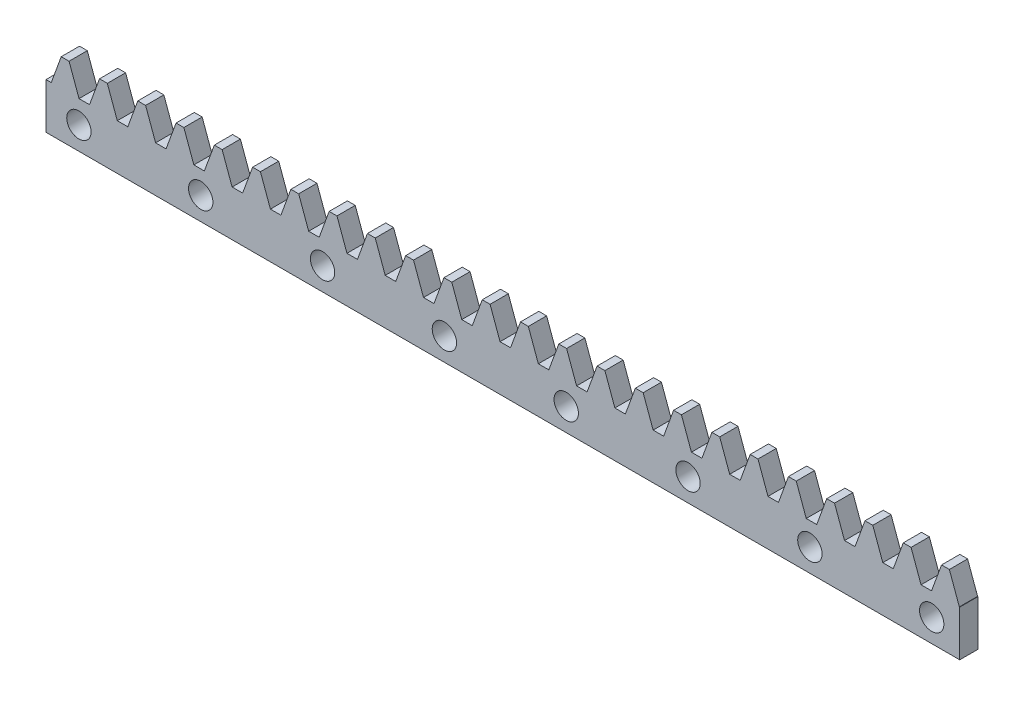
ISO-10303-21;
HEADER;
FILE_DESCRIPTION(('STEP AP214'),'2;1');
FILE_NAME('part.step','',(''),(''),'','','');
FILE_SCHEMA(('AUTOMOTIVE_DESIGN { 1 0 10303 214 1 1 1 1 }'));
ENDSEC;
DATA;
#1=APPLICATION_CONTEXT('core data for automotive mechanical design processes');
#2=APPLICATION_PROTOCOL_DEFINITION('international standard','automotive_design',2000,#1);
#3=PRODUCT_CONTEXT('',#1,'mechanical');
#4=PRODUCT('Part','Part','',(#3));
#5=PRODUCT_RELATED_PRODUCT_CATEGORY('part','',(#4));
#6=PRODUCT_DEFINITION_FORMATION('','',#4);
#7=PRODUCT_DEFINITION_CONTEXT('part definition',#1,'design');
#8=PRODUCT_DEFINITION('design','',#6,#7);
#9=PRODUCT_DEFINITION_SHAPE('','',#8);
#10=(LENGTH_UNIT() NAMED_UNIT(*) SI_UNIT(.MILLI.,.METRE.));
#11=(NAMED_UNIT(*) PLANE_ANGLE_UNIT() SI_UNIT($,.RADIAN.));
#12=(NAMED_UNIT(*) SI_UNIT($,.STERADIAN.) SOLID_ANGLE_UNIT());
#13=UNCERTAINTY_MEASURE_WITH_UNIT(LENGTH_MEASURE(1.E-05),#10,'distance_accuracy_value','');
#14=(GEOMETRIC_REPRESENTATION_CONTEXT(3) GLOBAL_UNCERTAINTY_ASSIGNED_CONTEXT((#13)) GLOBAL_UNIT_ASSIGNED_CONTEXT((#10,
#11,#12)) REPRESENTATION_CONTEXT('',''));
#15=CARTESIAN_POINT('',(0.,0.,0.));
#16=DIRECTION('',(0.,0.,1.));
#17=DIRECTION('',(1.,0.,0.));
#18=AXIS2_PLACEMENT_3D('',#15,#16,#17);
#19=CARTESIAN_POINT('',(0.,7.5,3.));
#20=DIRECTION('',(1.,0.,0.));
#21=DIRECTION('',(0.,0.,-1.));
#22=AXIS2_PLACEMENT_3D('',#19,#20,#21);
#23=PLANE('',#22);
#24=DIRECTION('',(0.,-1.,0.));
#25=VECTOR('',#24,1.);
#26=CARTESIAN_POINT('',(0.,7.5,0.));
#27=LINE('',#26,#25);
#28=CARTESIAN_POINT('',(0.,7.5,0.));
#29=VERTEX_POINT('',#28);
#30=CARTESIAN_POINT('',(0.,0.,0.));
#31=VERTEX_POINT('',#30);
#32=EDGE_CURVE('E685',#29,#31,#27,.T.);
#33=ORIENTED_EDGE('',*,*,#32,.T.);
#34=DIRECTION('',(0.,0.,-1.));
#35=VECTOR('',#34,1.);
#36=CARTESIAN_POINT('',(0.,0.,3.));
#37=LINE('',#36,#35);
#38=CARTESIAN_POINT('',(0.,0.,3.));
#39=VERTEX_POINT('',#38);
#40=EDGE_CURVE('E11',#39,#31,#37,.T.);
#41=ORIENTED_EDGE('',*,*,#40,.F.);
#42=DIRECTION('',(0.,-1.,0.));
#43=VECTOR('',#42,1.);
#44=CARTESIAN_POINT('',(0.,7.5,3.));
#45=LINE('',#44,#43);
#46=CARTESIAN_POINT('',(0.,7.5,3.));
#47=VERTEX_POINT('',#46);
#48=EDGE_CURVE('E884',#47,#39,#45,.T.);
#49=ORIENTED_EDGE('',*,*,#48,.F.);
#50=DIRECTION('',(0.,0.,-1.));
#51=VECTOR('',#50,1.);
#52=CARTESIAN_POINT('',(0.,7.5,3.));
#53=LINE('',#52,#51);
#54=EDGE_CURVE('E681',#47,#29,#53,.T.);
#55=ORIENTED_EDGE('',*,*,#54,.T.);
#56=EDGE_LOOP('',(#33,#41,#49,#55));
#57=FACE_BOUND('',#56,.T.);
#58=ADVANCED_FACE('F35',(#57),#23,.F.);
#59=CARTESIAN_POINT('',(0.,0.,3.));
#60=DIRECTION('',(0.,1.,0.));
#61=DIRECTION('',(0.,0.,1.));
#62=AXIS2_PLACEMENT_3D('',#59,#60,#61);
#63=PLANE('',#62);
#64=DIRECTION('',(1.,0.,0.));
#65=VECTOR('',#64,1.);
#66=CARTESIAN_POINT('',(0.,0.,0.));
#67=LINE('',#66,#65);
#68=CARTESIAN_POINT('',(150.,0.,0.));
#69=VERTEX_POINT('',#68);
#70=EDGE_CURVE('E688',#31,#69,#67,.T.);
#71=ORIENTED_EDGE('',*,*,#70,.T.);
#72=DIRECTION('',(0.,0.,-1.));
#73=VECTOR('',#72,1.);
#74=CARTESIAN_POINT('',(150.,0.,3.));
#75=LINE('',#74,#73);
#76=CARTESIAN_POINT('',(150.,0.,3.));
#77=VERTEX_POINT('',#76);
#78=EDGE_CURVE('E44',#77,#69,#75,.T.);
#79=ORIENTED_EDGE('',*,*,#78,.F.);
#80=DIRECTION('',(1.,0.,0.));
#81=VECTOR('',#80,1.);
#82=CARTESIAN_POINT('',(0.,0.,3.));
#83=LINE('',#82,#81);
#84=EDGE_CURVE('E372',#39,#77,#83,.T.);
#85=ORIENTED_EDGE('',*,*,#84,.F.);
#86=ORIENTED_EDGE('',*,*,#40,.T.);
#87=EDGE_LOOP('',(#71,#79,#85,#86));
#88=FACE_BOUND('',#87,.T.);
#89=ADVANCED_FACE('F1432',(#88),#63,.F.);
#90=CARTESIAN_POINT('',(150.,0.,3.));
#91=DIRECTION('',(-1.,0.,0.));
#92=DIRECTION('',(0.,0.,1.));
#93=AXIS2_PLACEMENT_3D('',#90,#91,#92);
#94=PLANE('',#93);
#95=DIRECTION('',(0.,1.,0.));
#96=VECTOR('',#95,1.);
#97=CARTESIAN_POINT('',(150.,0.,0.));
#98=LINE('',#97,#96);
#99=CARTESIAN_POINT('',(150.,7.5,0.));
#100=VERTEX_POINT('',#99);
#101=EDGE_CURVE('E691',#69,#100,#98,.T.);
#102=ORIENTED_EDGE('',*,*,#101,.T.);
#103=DIRECTION('',(0.,0.,-1.));
#104=VECTOR('',#103,1.);
#105=CARTESIAN_POINT('',(150.,7.5,3.));
#106=LINE('',#105,#104);
#107=CARTESIAN_POINT('',(150.,7.5,3.));
#108=VERTEX_POINT('',#107);
#109=EDGE_CURVE('E1167',#108,#100,#106,.T.);
#110=ORIENTED_EDGE('',*,*,#109,.F.);
#111=DIRECTION('',(0.,1.,0.));
#112=VECTOR('',#111,1.);
#113=CARTESIAN_POINT('',(150.,0.,3.));
#114=LINE('',#113,#112);
#115=EDGE_CURVE('E1215',#77,#108,#114,.T.);
#116=ORIENTED_EDGE('',*,*,#115,.F.);
#117=ORIENTED_EDGE('',*,*,#78,.T.);
#118=EDGE_LOOP('',(#102,#110,#116,#117));
#119=FACE_BOUND('',#118,.T.);
#120=ADVANCED_FACE('F1436',(#119),#94,.F.);
#121=CARTESIAN_POINT('',(150.,7.5,3.));
#122=DIRECTION('',(0.,-1.,0.));
#123=DIRECTION('',(0.,0.,-1.));
#124=AXIS2_PLACEMENT_3D('',#121,#122,#123);
#125=PLANE('',#124);
#126=DIRECTION('',(-1.,0.,0.));
#127=VECTOR('',#126,1.);
#128=CARTESIAN_POINT('',(150.,7.5,0.));
#129=LINE('',#128,#127);
#130=CARTESIAN_POINT('',(149.934576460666,7.5,0.));
#131=VERTEX_POINT('',#130);
#132=EDGE_CURVE('E693',#100,#131,#129,.T.);
#133=ORIENTED_EDGE('',*,*,#132,.T.);
#134=DIRECTION('',(0.,0.,-1.));
#135=VECTOR('',#134,1.);
#136=CARTESIAN_POINT('',(149.934576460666,7.5,3.));
#137=LINE('',#136,#135);
#138=CARTESIAN_POINT('',(149.934576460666,7.5,3.));
#139=VERTEX_POINT('',#138);
#140=EDGE_CURVE('E1164',#139,#131,#137,.T.);
#141=ORIENTED_EDGE('',*,*,#140,.F.);
#142=DIRECTION('',(-1.,0.,0.));
#143=VECTOR('',#142,1.);
#144=CARTESIAN_POINT('',(150.,7.5,3.));
#145=LINE('',#144,#143);
#146=EDGE_CURVE('E1217',#108,#139,#145,.T.);
#147=ORIENTED_EDGE('',*,*,#146,.F.);
#148=ORIENTED_EDGE('',*,*,#109,.T.);
#149=EDGE_LOOP('',(#133,#141,#147,#148));
#150=FACE_BOUND('',#149,.T.);
#151=ADVANCED_FACE('F1440',(#150),#125,.F.);
#152=CARTESIAN_POINT('',(149.934576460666,7.5,3.));
#153=DIRECTION('',(-0.93969262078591,-0.342020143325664,0.));
#154=DIRECTION('',(0.342020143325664,-0.93969262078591,0.));
#155=AXIS2_PLACEMENT_3D('',#152,#153,#154);
#156=PLANE('',#155);
#157=DIRECTION('',(-0.342020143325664,0.93969262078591,0.));
#158=VECTOR('',#157,1.);
#159=CARTESIAN_POINT('',(149.934576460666,7.5,0.));
#160=LINE('',#159,#158);
#161=CARTESIAN_POINT('',(148.296710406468,12.,0.));
#162=VERTEX_POINT('',#161);
#163=EDGE_CURVE('E695',#131,#162,#160,.T.);
#164=ORIENTED_EDGE('',*,*,#163,.T.);
#165=DIRECTION('',(0.,0.,-1.));
#166=VECTOR('',#165,1.);
#167=CARTESIAN_POINT('',(148.296710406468,12.,3.));
#168=LINE('',#167,#166);
#169=CARTESIAN_POINT('',(148.296710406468,12.,3.));
#170=VERTEX_POINT('',#169);
#171=EDGE_CURVE('E1161',#170,#162,#168,.T.);
#172=ORIENTED_EDGE('',*,*,#171,.F.);
#173=DIRECTION('',(-0.342020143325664,0.93969262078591,0.));
#174=VECTOR('',#173,1.);
#175=CARTESIAN_POINT('',(149.934576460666,7.5,3.));
#176=LINE('',#175,#174);
#177=EDGE_CURVE('E1219',#139,#170,#176,.T.);
#178=ORIENTED_EDGE('',*,*,#177,.F.);
#179=ORIENTED_EDGE('',*,*,#140,.T.);
#180=EDGE_LOOP('',(#164,#172,#178,#179));
#181=FACE_BOUND('',#180,.T.);
#182=ADVANCED_FACE('F1446',(#181),#156,.F.);
#183=CARTESIAN_POINT('',(148.296710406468,12.,3.));
#184=DIRECTION('',(0.,-1.,0.));
#185=DIRECTION('',(1.,0.,0.));
#186=AXIS2_PLACEMENT_3D('',#183,#184,#185);
#187=PLANE('',#186);
#188=DIRECTION('',(-1.,0.,0.));
#189=VECTOR('',#188,1.);
#190=CARTESIAN_POINT('',(148.296710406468,12.,0.));
#191=LINE('',#190,#189);
#192=CARTESIAN_POINT('',(147.012998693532,12.,0.));
#193=VERTEX_POINT('',#192);
#194=EDGE_CURVE('E697',#162,#193,#191,.T.);
#195=ORIENTED_EDGE('',*,*,#194,.T.);
#196=DIRECTION('',(0.,0.,-1.));
#197=VECTOR('',#196,1.);
#198=CARTESIAN_POINT('',(147.012998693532,12.,3.));
#199=LINE('',#198,#197);
#200=CARTESIAN_POINT('',(147.012998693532,12.,3.));
#201=VERTEX_POINT('',#200);
#202=EDGE_CURVE('E1158',#201,#193,#199,.T.);
#203=ORIENTED_EDGE('',*,*,#202,.F.);
#204=DIRECTION('',(-1.,0.,0.));
#205=VECTOR('',#204,1.);
#206=CARTESIAN_POINT('',(148.296710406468,12.,3.));
#207=LINE('',#206,#205);
#208=EDGE_CURVE('E1221',#170,#201,#207,.T.);
#209=ORIENTED_EDGE('',*,*,#208,.F.);
#210=ORIENTED_EDGE('',*,*,#171,.T.);
#211=EDGE_LOOP('',(#195,#203,#209,#210));
#212=FACE_BOUND('',#211,.T.);
#213=ADVANCED_FACE('F1450',(#212),#187,.F.);
#214=CARTESIAN_POINT('',(147.012998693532,12.,3.));
#215=DIRECTION('',(0.93969262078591,-0.342020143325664,0.));
#216=DIRECTION('',(0.342020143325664,0.93969262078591,0.));
#217=AXIS2_PLACEMENT_3D('',#214,#215,#216);
#218=PLANE('',#217);
#219=DIRECTION('',(-0.342020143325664,-0.93969262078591,0.));
#220=VECTOR('',#219,1.);
#221=CARTESIAN_POINT('',(147.012998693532,12.,0.));
#222=LINE('',#221,#220);
#223=CARTESIAN_POINT('',(145.375132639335,7.5,0.));
#224=VERTEX_POINT('',#223);
#225=EDGE_CURVE('E699',#193,#224,#222,.T.);
#226=ORIENTED_EDGE('',*,*,#225,.T.);
#227=DIRECTION('',(0.,0.,-1.));
#228=VECTOR('',#227,1.);
#229=CARTESIAN_POINT('',(145.375132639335,7.5,3.));
#230=LINE('',#229,#228);
#231=CARTESIAN_POINT('',(145.375132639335,7.5,3.));
#232=VERTEX_POINT('',#231);
#233=EDGE_CURVE('E1155',#232,#224,#230,.T.);
#234=ORIENTED_EDGE('',*,*,#233,.F.);
#235=DIRECTION('',(-0.342020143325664,-0.93969262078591,0.));
#236=VECTOR('',#235,1.);
#237=CARTESIAN_POINT('',(147.012998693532,12.,3.));
#238=LINE('',#237,#236);
#239=EDGE_CURVE('E1223',#201,#232,#238,.T.);
#240=ORIENTED_EDGE('',*,*,#239,.F.);
#241=ORIENTED_EDGE('',*,*,#202,.T.);
#242=EDGE_LOOP('',(#226,#234,#240,#241));
#243=FACE_BOUND('',#242,.T.);
#244=ADVANCED_FACE('F1454',(#243),#218,.F.);
#245=CARTESIAN_POINT('',(145.375132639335,7.5,3.));
#246=DIRECTION('',(0.,-1.,0.));
#247=DIRECTION('',(0.,0.,-1.));
#248=AXIS2_PLACEMENT_3D('',#245,#246,#247);
#249=PLANE('',#248);
#250=DIRECTION('',(-1.,0.,0.));
#251=VECTOR('',#250,1.);
#252=CARTESIAN_POINT('',(145.375132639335,7.5,0.));
#253=LINE('',#252,#251);
#254=CARTESIAN_POINT('',(143.651391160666,7.5,0.));
#255=VERTEX_POINT('',#254);
#256=EDGE_CURVE('E701',#224,#255,#253,.T.);
#257=ORIENTED_EDGE('',*,*,#256,.T.);
#258=DIRECTION('',(0.,0.,-1.));
#259=VECTOR('',#258,1.);
#260=CARTESIAN_POINT('',(143.651391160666,7.5,3.));
#261=LINE('',#260,#259);
#262=CARTESIAN_POINT('',(143.651391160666,7.5,3.));
#263=VERTEX_POINT('',#262);
#264=EDGE_CURVE('E1152',#263,#255,#261,.T.);
#265=ORIENTED_EDGE('',*,*,#264,.F.);
#266=DIRECTION('',(-1.,0.,0.));
#267=VECTOR('',#266,1.);
#268=CARTESIAN_POINT('',(145.375132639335,7.5,3.));
#269=LINE('',#268,#267);
#270=EDGE_CURVE('E1225',#232,#263,#269,.T.);
#271=ORIENTED_EDGE('',*,*,#270,.F.);
#272=ORIENTED_EDGE('',*,*,#233,.T.);
#273=EDGE_LOOP('',(#257,#265,#271,#272));
#274=FACE_BOUND('',#273,.T.);
#275=ADVANCED_FACE('F1458',(#274),#249,.F.);
#276=CARTESIAN_POINT('',(143.651391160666,7.5,3.));
#277=DIRECTION('',(-0.93969262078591,-0.342020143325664,0.));
#278=DIRECTION('',(0.342020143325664,-0.93969262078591,0.));
#279=AXIS2_PLACEMENT_3D('',#276,#277,#278);
#280=PLANE('',#279);
#281=DIRECTION('',(-0.342020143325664,0.93969262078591,0.));
#282=VECTOR('',#281,1.);
#283=CARTESIAN_POINT('',(143.651391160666,7.5,0.));
#284=LINE('',#283,#282);
#285=CARTESIAN_POINT('',(142.013525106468,12.,0.));
#286=VERTEX_POINT('',#285);
#287=EDGE_CURVE('E703',#255,#286,#284,.T.);
#288=ORIENTED_EDGE('',*,*,#287,.T.);
#289=DIRECTION('',(0.,0.,-1.));
#290=VECTOR('',#289,1.);
#291=CARTESIAN_POINT('',(142.013525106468,12.,3.));
#292=LINE('',#291,#290);
#293=CARTESIAN_POINT('',(142.013525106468,12.,3.));
#294=VERTEX_POINT('',#293);
#295=EDGE_CURVE('E1149',#294,#286,#292,.T.);
#296=ORIENTED_EDGE('',*,*,#295,.F.);
#297=DIRECTION('',(-0.342020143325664,0.93969262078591,0.));
#298=VECTOR('',#297,1.);
#299=CARTESIAN_POINT('',(143.651391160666,7.5,3.));
#300=LINE('',#299,#298);
#301=EDGE_CURVE('E1227',#263,#294,#300,.T.);
#302=ORIENTED_EDGE('',*,*,#301,.F.);
#303=ORIENTED_EDGE('',*,*,#264,.T.);
#304=EDGE_LOOP('',(#288,#296,#302,#303));
#305=FACE_BOUND('',#304,.T.);
#306=ADVANCED_FACE('F1462',(#305),#280,.F.);
#307=CARTESIAN_POINT('',(142.013525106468,12.,3.));
#308=DIRECTION('',(0.,-1.,0.));
#309=DIRECTION('',(1.,0.,0.));
#310=AXIS2_PLACEMENT_3D('',#307,#308,#309);
#311=PLANE('',#310);
#312=DIRECTION('',(-1.,0.,0.));
#313=VECTOR('',#312,1.);
#314=CARTESIAN_POINT('',(142.013525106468,12.,0.));
#315=LINE('',#314,#313);
#316=CARTESIAN_POINT('',(140.729813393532,12.,0.));
#317=VERTEX_POINT('',#316);
#318=EDGE_CURVE('E705',#286,#317,#315,.T.);
#319=ORIENTED_EDGE('',*,*,#318,.T.);
#320=DIRECTION('',(0.,0.,-1.));
#321=VECTOR('',#320,1.);
#322=CARTESIAN_POINT('',(140.729813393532,12.,3.));
#323=LINE('',#322,#321);
#324=CARTESIAN_POINT('',(140.729813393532,12.,3.));
#325=VERTEX_POINT('',#324);
#326=EDGE_CURVE('E1146',#325,#317,#323,.T.);
#327=ORIENTED_EDGE('',*,*,#326,.F.);
#328=DIRECTION('',(-1.,0.,0.));
#329=VECTOR('',#328,1.);
#330=CARTESIAN_POINT('',(142.013525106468,12.,3.));
#331=LINE('',#330,#329);
#332=EDGE_CURVE('E1229',#294,#325,#331,.T.);
#333=ORIENTED_EDGE('',*,*,#332,.F.);
#334=ORIENTED_EDGE('',*,*,#295,.T.);
#335=EDGE_LOOP('',(#319,#327,#333,#334));
#336=FACE_BOUND('',#335,.T.);
#337=ADVANCED_FACE('F1466',(#336),#311,.F.);
#338=CARTESIAN_POINT('',(140.729813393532,12.,3.));
#339=DIRECTION('',(0.93969262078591,-0.342020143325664,0.));
#340=DIRECTION('',(0.342020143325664,0.93969262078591,0.));
#341=AXIS2_PLACEMENT_3D('',#338,#339,#340);
#342=PLANE('',#341);
#343=DIRECTION('',(-0.342020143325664,-0.93969262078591,0.));
#344=VECTOR('',#343,1.);
#345=CARTESIAN_POINT('',(140.729813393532,12.,0.));
#346=LINE('',#345,#344);
#347=CARTESIAN_POINT('',(139.091947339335,7.5,0.));
#348=VERTEX_POINT('',#347);
#349=EDGE_CURVE('E707',#317,#348,#346,.T.);
#350=ORIENTED_EDGE('',*,*,#349,.T.);
#351=DIRECTION('',(0.,0.,-1.));
#352=VECTOR('',#351,1.);
#353=CARTESIAN_POINT('',(139.091947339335,7.5,3.));
#354=LINE('',#353,#352);
#355=CARTESIAN_POINT('',(139.091947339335,7.5,3.));
#356=VERTEX_POINT('',#355);
#357=EDGE_CURVE('E1143',#356,#348,#354,.T.);
#358=ORIENTED_EDGE('',*,*,#357,.F.);
#359=DIRECTION('',(-0.342020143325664,-0.93969262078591,0.));
#360=VECTOR('',#359,1.);
#361=CARTESIAN_POINT('',(140.729813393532,12.,3.));
#362=LINE('',#361,#360);
#363=EDGE_CURVE('E1231',#325,#356,#362,.T.);
#364=ORIENTED_EDGE('',*,*,#363,.F.);
#365=ORIENTED_EDGE('',*,*,#326,.T.);
#366=EDGE_LOOP('',(#350,#358,#364,#365));
#367=FACE_BOUND('',#366,.T.);
#368=ADVANCED_FACE('F1470',(#367),#342,.F.);
#369=CARTESIAN_POINT('',(139.091947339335,7.5,3.));
#370=DIRECTION('',(0.,-1.,0.));
#371=DIRECTION('',(0.,0.,-1.));
#372=AXIS2_PLACEMENT_3D('',#369,#370,#371);
#373=PLANE('',#372);
#374=DIRECTION('',(-1.,0.,0.));
#375=VECTOR('',#374,1.);
#376=CARTESIAN_POINT('',(139.091947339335,7.5,0.));
#377=LINE('',#376,#375);
#378=CARTESIAN_POINT('',(137.368205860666,7.5,0.));
#379=VERTEX_POINT('',#378);
#380=EDGE_CURVE('E709',#348,#379,#377,.T.);
#381=ORIENTED_EDGE('',*,*,#380,.T.);
#382=DIRECTION('',(0.,0.,-1.));
#383=VECTOR('',#382,1.);
#384=CARTESIAN_POINT('',(137.368205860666,7.5,3.));
#385=LINE('',#384,#383);
#386=CARTESIAN_POINT('',(137.368205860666,7.5,3.));
#387=VERTEX_POINT('',#386);
#388=EDGE_CURVE('E1140',#387,#379,#385,.T.);
#389=ORIENTED_EDGE('',*,*,#388,.F.);
#390=DIRECTION('',(-1.,0.,0.));
#391=VECTOR('',#390,1.);
#392=CARTESIAN_POINT('',(139.091947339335,7.5,3.));
#393=LINE('',#392,#391);
#394=EDGE_CURVE('E1233',#356,#387,#393,.T.);
#395=ORIENTED_EDGE('',*,*,#394,.F.);
#396=ORIENTED_EDGE('',*,*,#357,.T.);
#397=EDGE_LOOP('',(#381,#389,#395,#396));
#398=FACE_BOUND('',#397,.T.);
#399=ADVANCED_FACE('F1474',(#398),#373,.F.);
#400=CARTESIAN_POINT('',(137.368205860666,7.5,3.));
#401=DIRECTION('',(-0.93969262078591,-0.342020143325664,0.));
#402=DIRECTION('',(0.342020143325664,-0.93969262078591,0.));
#403=AXIS2_PLACEMENT_3D('',#400,#401,#402);
#404=PLANE('',#403);
#405=DIRECTION('',(-0.342020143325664,0.93969262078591,0.));
#406=VECTOR('',#405,1.);
#407=CARTESIAN_POINT('',(137.368205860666,7.5,0.));
#408=LINE('',#407,#406);
#409=CARTESIAN_POINT('',(135.730339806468,12.,0.));
#410=VERTEX_POINT('',#409);
#411=EDGE_CURVE('E711',#379,#410,#408,.T.);
#412=ORIENTED_EDGE('',*,*,#411,.T.);
#413=DIRECTION('',(0.,0.,-1.));
#414=VECTOR('',#413,1.);
#415=CARTESIAN_POINT('',(135.730339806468,12.,3.));
#416=LINE('',#415,#414);
#417=CARTESIAN_POINT('',(135.730339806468,12.,3.));
#418=VERTEX_POINT('',#417);
#419=EDGE_CURVE('E1137',#418,#410,#416,.T.);
#420=ORIENTED_EDGE('',*,*,#419,.F.);
#421=DIRECTION('',(-0.342020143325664,0.93969262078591,0.));
#422=VECTOR('',#421,1.);
#423=CARTESIAN_POINT('',(137.368205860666,7.5,3.));
#424=LINE('',#423,#422);
#425=EDGE_CURVE('E1235',#387,#418,#424,.T.);
#426=ORIENTED_EDGE('',*,*,#425,.F.);
#427=ORIENTED_EDGE('',*,*,#388,.T.);
#428=EDGE_LOOP('',(#412,#420,#426,#427));
#429=FACE_BOUND('',#428,.T.);
#430=ADVANCED_FACE('F1478',(#429),#404,.F.);
#431=CARTESIAN_POINT('',(135.730339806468,12.,3.));
#432=DIRECTION('',(0.,-1.,0.));
#433=DIRECTION('',(1.,0.,0.));
#434=AXIS2_PLACEMENT_3D('',#431,#432,#433);
#435=PLANE('',#434);
#436=DIRECTION('',(-1.,0.,0.));
#437=VECTOR('',#436,1.);
#438=CARTESIAN_POINT('',(135.730339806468,12.,0.));
#439=LINE('',#438,#437);
#440=CARTESIAN_POINT('',(134.446628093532,12.,0.));
#441=VERTEX_POINT('',#440);
#442=EDGE_CURVE('E713',#410,#441,#439,.T.);
#443=ORIENTED_EDGE('',*,*,#442,.T.);
#444=DIRECTION('',(0.,0.,-1.));
#445=VECTOR('',#444,1.);
#446=CARTESIAN_POINT('',(134.446628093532,12.,3.));
#447=LINE('',#446,#445);
#448=CARTESIAN_POINT('',(134.446628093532,12.,3.));
#449=VERTEX_POINT('',#448);
#450=EDGE_CURVE('E1134',#449,#441,#447,.T.);
#451=ORIENTED_EDGE('',*,*,#450,.F.);
#452=DIRECTION('',(-1.,0.,0.));
#453=VECTOR('',#452,1.);
#454=CARTESIAN_POINT('',(135.730339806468,12.,3.));
#455=LINE('',#454,#453);
#456=EDGE_CURVE('E1237',#418,#449,#455,.T.);
#457=ORIENTED_EDGE('',*,*,#456,.F.);
#458=ORIENTED_EDGE('',*,*,#419,.T.);
#459=EDGE_LOOP('',(#443,#451,#457,#458));
#460=FACE_BOUND('',#459,.T.);
#461=ADVANCED_FACE('F1482',(#460),#435,.F.);
#462=CARTESIAN_POINT('',(134.446628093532,12.,3.));
#463=DIRECTION('',(0.93969262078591,-0.342020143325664,0.));
#464=DIRECTION('',(0.342020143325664,0.93969262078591,0.));
#465=AXIS2_PLACEMENT_3D('',#462,#463,#464);
#466=PLANE('',#465);
#467=DIRECTION('',(-0.342020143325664,-0.93969262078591,0.));
#468=VECTOR('',#467,1.);
#469=CARTESIAN_POINT('',(134.446628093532,12.,0.));
#470=LINE('',#469,#468);
#471=CARTESIAN_POINT('',(132.808762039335,7.5,0.));
#472=VERTEX_POINT('',#471);
#473=EDGE_CURVE('E715',#441,#472,#470,.T.);
#474=ORIENTED_EDGE('',*,*,#473,.T.);
#475=DIRECTION('',(0.,0.,-1.));
#476=VECTOR('',#475,1.);
#477=CARTESIAN_POINT('',(132.808762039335,7.5,3.));
#478=LINE('',#477,#476);
#479=CARTESIAN_POINT('',(132.808762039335,7.5,3.));
#480=VERTEX_POINT('',#479);
#481=EDGE_CURVE('E1131',#480,#472,#478,.T.);
#482=ORIENTED_EDGE('',*,*,#481,.F.);
#483=DIRECTION('',(-0.342020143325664,-0.93969262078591,0.));
#484=VECTOR('',#483,1.);
#485=CARTESIAN_POINT('',(134.446628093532,12.,3.));
#486=LINE('',#485,#484);
#487=EDGE_CURVE('E1239',#449,#480,#486,.T.);
#488=ORIENTED_EDGE('',*,*,#487,.F.);
#489=ORIENTED_EDGE('',*,*,#450,.T.);
#490=EDGE_LOOP('',(#474,#482,#488,#489));
#491=FACE_BOUND('',#490,.T.);
#492=ADVANCED_FACE('F1486',(#491),#466,.F.);
#493=CARTESIAN_POINT('',(132.808762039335,7.5,3.));
#494=DIRECTION('',(0.,-1.,0.));
#495=DIRECTION('',(0.,0.,-1.));
#496=AXIS2_PLACEMENT_3D('',#493,#494,#495);
#497=PLANE('',#496);
#498=DIRECTION('',(-1.,0.,0.));
#499=VECTOR('',#498,1.);
#500=CARTESIAN_POINT('',(132.808762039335,7.5,0.));
#501=LINE('',#500,#499);
#502=CARTESIAN_POINT('',(131.085020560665,7.5,0.));
#503=VERTEX_POINT('',#502);
#504=EDGE_CURVE('E717',#472,#503,#501,.T.);
#505=ORIENTED_EDGE('',*,*,#504,.T.);
#506=DIRECTION('',(0.,0.,-1.));
#507=VECTOR('',#506,1.);
#508=CARTESIAN_POINT('',(131.085020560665,7.5,3.));
#509=LINE('',#508,#507);
#510=CARTESIAN_POINT('',(131.085020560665,7.5,3.));
#511=VERTEX_POINT('',#510);
#512=EDGE_CURVE('E1128',#511,#503,#509,.T.);
#513=ORIENTED_EDGE('',*,*,#512,.F.);
#514=DIRECTION('',(-1.,0.,0.));
#515=VECTOR('',#514,1.);
#516=CARTESIAN_POINT('',(132.808762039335,7.5,3.));
#517=LINE('',#516,#515);
#518=EDGE_CURVE('E1241',#480,#511,#517,.T.);
#519=ORIENTED_EDGE('',*,*,#518,.F.);
#520=ORIENTED_EDGE('',*,*,#481,.T.);
#521=EDGE_LOOP('',(#505,#513,#519,#520));
#522=FACE_BOUND('',#521,.T.);
#523=ADVANCED_FACE('F1490',(#522),#497,.F.);
#524=CARTESIAN_POINT('',(131.085020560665,7.5,3.));
#525=DIRECTION('',(-0.93969262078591,-0.342020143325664,0.));
#526=DIRECTION('',(0.342020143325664,-0.93969262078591,0.));
#527=AXIS2_PLACEMENT_3D('',#524,#525,#526);
#528=PLANE('',#527);
#529=DIRECTION('',(-0.342020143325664,0.93969262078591,0.));
#530=VECTOR('',#529,1.);
#531=CARTESIAN_POINT('',(131.085020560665,7.5,0.));
#532=LINE('',#531,#530);
#533=CARTESIAN_POINT('',(129.447154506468,12.,0.));
#534=VERTEX_POINT('',#533);
#535=EDGE_CURVE('E719',#503,#534,#532,.T.);
#536=ORIENTED_EDGE('',*,*,#535,.T.);
#537=DIRECTION('',(0.,0.,-1.));
#538=VECTOR('',#537,1.);
#539=CARTESIAN_POINT('',(129.447154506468,12.,3.));
#540=LINE('',#539,#538);
#541=CARTESIAN_POINT('',(129.447154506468,12.,3.));
#542=VERTEX_POINT('',#541);
#543=EDGE_CURVE('E1125',#542,#534,#540,.T.);
#544=ORIENTED_EDGE('',*,*,#543,.F.);
#545=DIRECTION('',(-0.342020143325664,0.93969262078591,0.));
#546=VECTOR('',#545,1.);
#547=CARTESIAN_POINT('',(131.085020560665,7.5,3.));
#548=LINE('',#547,#546);
#549=EDGE_CURVE('E1243',#511,#542,#548,.T.);
#550=ORIENTED_EDGE('',*,*,#549,.F.);
#551=ORIENTED_EDGE('',*,*,#512,.T.);
#552=EDGE_LOOP('',(#536,#544,#550,#551));
#553=FACE_BOUND('',#552,.T.);
#554=ADVANCED_FACE('F1494',(#553),#528,.F.);
#555=CARTESIAN_POINT('',(129.447154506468,12.,3.));
#556=DIRECTION('',(0.,-1.,0.));
#557=DIRECTION('',(1.,0.,0.));
#558=AXIS2_PLACEMENT_3D('',#555,#556,#557);
#559=PLANE('',#558);
#560=DIRECTION('',(-1.,0.,0.));
#561=VECTOR('',#560,1.);
#562=CARTESIAN_POINT('',(129.447154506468,12.,0.));
#563=LINE('',#562,#561);
#564=CARTESIAN_POINT('',(128.163442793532,12.,0.));
#565=VERTEX_POINT('',#564);
#566=EDGE_CURVE('E721',#534,#565,#563,.T.);
#567=ORIENTED_EDGE('',*,*,#566,.T.);
#568=DIRECTION('',(0.,0.,-1.));
#569=VECTOR('',#568,1.);
#570=CARTESIAN_POINT('',(128.163442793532,12.,3.));
#571=LINE('',#570,#569);
#572=CARTESIAN_POINT('',(128.163442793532,12.,3.));
#573=VERTEX_POINT('',#572);
#574=EDGE_CURVE('E1122',#573,#565,#571,.T.);
#575=ORIENTED_EDGE('',*,*,#574,.F.);
#576=DIRECTION('',(-1.,0.,0.));
#577=VECTOR('',#576,1.);
#578=CARTESIAN_POINT('',(129.447154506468,12.,3.));
#579=LINE('',#578,#577);
#580=EDGE_CURVE('E1245',#542,#573,#579,.T.);
#581=ORIENTED_EDGE('',*,*,#580,.F.);
#582=ORIENTED_EDGE('',*,*,#543,.T.);
#583=EDGE_LOOP('',(#567,#575,#581,#582));
#584=FACE_BOUND('',#583,.T.);
#585=ADVANCED_FACE('F1498',(#584),#559,.F.);
#586=CARTESIAN_POINT('',(128.163442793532,12.,3.));
#587=DIRECTION('',(0.939692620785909,-0.342020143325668,0.));
#588=DIRECTION('',(0.342020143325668,0.939692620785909,0.));
#589=AXIS2_PLACEMENT_3D('',#586,#587,#588);
#590=PLANE('',#589);
#591=DIRECTION('',(-0.342020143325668,-0.939692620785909,0.));
#592=VECTOR('',#591,1.);
#593=CARTESIAN_POINT('',(128.163442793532,12.,0.));
#594=LINE('',#593,#592);
#595=CARTESIAN_POINT('',(126.525576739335,7.5,0.));
#596=VERTEX_POINT('',#595);
#597=EDGE_CURVE('E723',#565,#596,#594,.T.);
#598=ORIENTED_EDGE('',*,*,#597,.T.);
#599=DIRECTION('',(0.,0.,-1.));
#600=VECTOR('',#599,1.);
#601=CARTESIAN_POINT('',(126.525576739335,7.5,3.));
#602=LINE('',#601,#600);
#603=CARTESIAN_POINT('',(126.525576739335,7.5,3.));
#604=VERTEX_POINT('',#603);
#605=EDGE_CURVE('E1119',#604,#596,#602,.T.);
#606=ORIENTED_EDGE('',*,*,#605,.F.);
#607=DIRECTION('',(-0.342020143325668,-0.939692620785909,0.));
#608=VECTOR('',#607,1.);
#609=CARTESIAN_POINT('',(128.163442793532,12.,3.));
#610=LINE('',#609,#608);
#611=EDGE_CURVE('E1247',#573,#604,#610,.T.);
#612=ORIENTED_EDGE('',*,*,#611,.F.);
#613=ORIENTED_EDGE('',*,*,#574,.T.);
#614=EDGE_LOOP('',(#598,#606,#612,#613));
#615=FACE_BOUND('',#614,.T.);
#616=ADVANCED_FACE('F1502',(#615),#590,.F.);
#617=CARTESIAN_POINT('',(126.525576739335,7.5,3.));
#618=DIRECTION('',(0.,-1.,0.));
#619=DIRECTION('',(0.,0.,-1.));
#620=AXIS2_PLACEMENT_3D('',#617,#618,#619);
#621=PLANE('',#620);
#622=DIRECTION('',(-1.,0.,0.));
#623=VECTOR('',#622,1.);
#624=CARTESIAN_POINT('',(126.525576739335,7.5,0.));
#625=LINE('',#624,#623);
#626=CARTESIAN_POINT('',(124.801835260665,7.5,0.));
#627=VERTEX_POINT('',#626);
#628=EDGE_CURVE('E725',#596,#627,#625,.T.);
#629=ORIENTED_EDGE('',*,*,#628,.T.);
#630=DIRECTION('',(0.,0.,-1.));
#631=VECTOR('',#630,1.);
#632=CARTESIAN_POINT('',(124.801835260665,7.5,3.));
#633=LINE('',#632,#631);
#634=CARTESIAN_POINT('',(124.801835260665,7.5,3.));
#635=VERTEX_POINT('',#634);
#636=EDGE_CURVE('E1116',#635,#627,#633,.T.);
#637=ORIENTED_EDGE('',*,*,#636,.F.);
#638=DIRECTION('',(-1.,0.,0.));
#639=VECTOR('',#638,1.);
#640=CARTESIAN_POINT('',(126.525576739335,7.5,3.));
#641=LINE('',#640,#639);
#642=EDGE_CURVE('E1249',#604,#635,#641,.T.);
#643=ORIENTED_EDGE('',*,*,#642,.F.);
#644=ORIENTED_EDGE('',*,*,#605,.T.);
#645=EDGE_LOOP('',(#629,#637,#643,#644));
#646=FACE_BOUND('',#645,.T.);
#647=ADVANCED_FACE('F1506',(#646),#621,.F.);
#648=CARTESIAN_POINT('',(124.801835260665,7.5,3.));
#649=DIRECTION('',(-0.93969262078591,-0.342020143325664,0.));
#650=DIRECTION('',(0.342020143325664,-0.93969262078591,0.));
#651=AXIS2_PLACEMENT_3D('',#648,#649,#650);
#652=PLANE('',#651);
#653=DIRECTION('',(-0.342020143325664,0.93969262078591,0.));
#654=VECTOR('',#653,1.);
#655=CARTESIAN_POINT('',(124.801835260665,7.5,0.));
#656=LINE('',#655,#654);
#657=CARTESIAN_POINT('',(123.163969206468,12.,0.));
#658=VERTEX_POINT('',#657);
#659=EDGE_CURVE('E727',#627,#658,#656,.T.);
#660=ORIENTED_EDGE('',*,*,#659,.T.);
#661=DIRECTION('',(0.,0.,-1.));
#662=VECTOR('',#661,1.);
#663=CARTESIAN_POINT('',(123.163969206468,12.,3.));
#664=LINE('',#663,#662);
#665=CARTESIAN_POINT('',(123.163969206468,12.,3.));
#666=VERTEX_POINT('',#665);
#667=EDGE_CURVE('E1113',#666,#658,#664,.T.);
#668=ORIENTED_EDGE('',*,*,#667,.F.);
#669=DIRECTION('',(-0.342020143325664,0.93969262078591,0.));
#670=VECTOR('',#669,1.);
#671=CARTESIAN_POINT('',(124.801835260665,7.5,3.));
#672=LINE('',#671,#670);
#673=EDGE_CURVE('E1251',#635,#666,#672,.T.);
#674=ORIENTED_EDGE('',*,*,#673,.F.);
#675=ORIENTED_EDGE('',*,*,#636,.T.);
#676=EDGE_LOOP('',(#660,#668,#674,#675));
#677=FACE_BOUND('',#676,.T.);
#678=ADVANCED_FACE('F1510',(#677),#652,.F.);
#679=CARTESIAN_POINT('',(123.163969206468,12.,3.));
#680=DIRECTION('',(0.,-1.,0.));
#681=DIRECTION('',(1.,0.,0.));
#682=AXIS2_PLACEMENT_3D('',#679,#680,#681);
#683=PLANE('',#682);
#684=DIRECTION('',(-1.,0.,0.));
#685=VECTOR('',#684,1.);
#686=CARTESIAN_POINT('',(123.163969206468,12.,0.));
#687=LINE('',#686,#685);
#688=CARTESIAN_POINT('',(121.880257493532,12.,0.));
#689=VERTEX_POINT('',#688);
#690=EDGE_CURVE('E729',#658,#689,#687,.T.);
#691=ORIENTED_EDGE('',*,*,#690,.T.);
#692=DIRECTION('',(0.,0.,-1.));
#693=VECTOR('',#692,1.);
#694=CARTESIAN_POINT('',(121.880257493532,12.,3.));
#695=LINE('',#694,#693);
#696=CARTESIAN_POINT('',(121.880257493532,12.,3.));
#697=VERTEX_POINT('',#696);
#698=EDGE_CURVE('E1110',#697,#689,#695,.T.);
#699=ORIENTED_EDGE('',*,*,#698,.F.);
#700=DIRECTION('',(-1.,0.,0.));
#701=VECTOR('',#700,1.);
#702=CARTESIAN_POINT('',(123.163969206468,12.,3.));
#703=LINE('',#702,#701);
#704=EDGE_CURVE('E1253',#666,#697,#703,.T.);
#705=ORIENTED_EDGE('',*,*,#704,.F.);
#706=ORIENTED_EDGE('',*,*,#667,.T.);
#707=EDGE_LOOP('',(#691,#699,#705,#706));
#708=FACE_BOUND('',#707,.T.);
#709=ADVANCED_FACE('F1514',(#708),#683,.F.);
#710=CARTESIAN_POINT('',(121.880257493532,12.,3.));
#711=DIRECTION('',(0.93969262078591,-0.342020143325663,0.));
#712=DIRECTION('',(0.342020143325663,0.939692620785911,0.));
#713=AXIS2_PLACEMENT_3D('',#710,#711,#712);
#714=PLANE('',#713);
#715=DIRECTION('',(-0.342020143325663,-0.93969262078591,0.));
#716=VECTOR('',#715,1.);
#717=CARTESIAN_POINT('',(121.880257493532,12.,0.));
#718=LINE('',#717,#716);
#719=CARTESIAN_POINT('',(120.242391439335,7.5,0.));
#720=VERTEX_POINT('',#719);
#721=EDGE_CURVE('E731',#689,#720,#718,.T.);
#722=ORIENTED_EDGE('',*,*,#721,.T.);
#723=DIRECTION('',(0.,0.,-1.));
#724=VECTOR('',#723,1.);
#725=CARTESIAN_POINT('',(120.242391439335,7.5,3.));
#726=LINE('',#725,#724);
#727=CARTESIAN_POINT('',(120.242391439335,7.5,3.));
#728=VERTEX_POINT('',#727);
#729=EDGE_CURVE('E1107',#728,#720,#726,.T.);
#730=ORIENTED_EDGE('',*,*,#729,.F.);
#731=DIRECTION('',(-0.342020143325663,-0.93969262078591,0.));
#732=VECTOR('',#731,1.);
#733=CARTESIAN_POINT('',(121.880257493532,12.,3.));
#734=LINE('',#733,#732);
#735=EDGE_CURVE('E1255',#697,#728,#734,.T.);
#736=ORIENTED_EDGE('',*,*,#735,.F.);
#737=ORIENTED_EDGE('',*,*,#698,.T.);
#738=EDGE_LOOP('',(#722,#730,#736,#737));
#739=FACE_BOUND('',#738,.T.);
#740=ADVANCED_FACE('F1518',(#739),#714,.F.);
#741=CARTESIAN_POINT('',(120.242391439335,7.5,3.));
#742=DIRECTION('',(0.,-1.,0.));
#743=DIRECTION('',(0.,0.,-1.));
#744=AXIS2_PLACEMENT_3D('',#741,#742,#743);
#745=PLANE('',#744);
#746=DIRECTION('',(-1.,0.,0.));
#747=VECTOR('',#746,1.);
#748=CARTESIAN_POINT('',(120.242391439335,7.5,0.));
#749=LINE('',#748,#747);
#750=CARTESIAN_POINT('',(118.518649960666,7.5,0.));
#751=VERTEX_POINT('',#750);
#752=EDGE_CURVE('E733',#720,#751,#749,.T.);
#753=ORIENTED_EDGE('',*,*,#752,.T.);
#754=DIRECTION('',(0.,0.,-1.));
#755=VECTOR('',#754,1.);
#756=CARTESIAN_POINT('',(118.518649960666,7.5,3.));
#757=LINE('',#756,#755);
#758=CARTESIAN_POINT('',(118.518649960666,7.5,3.));
#759=VERTEX_POINT('',#758);
#760=EDGE_CURVE('E1104',#759,#751,#757,.T.);
#761=ORIENTED_EDGE('',*,*,#760,.F.);
#762=DIRECTION('',(-1.,0.,0.));
#763=VECTOR('',#762,1.);
#764=CARTESIAN_POINT('',(120.242391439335,7.5,3.));
#765=LINE('',#764,#763);
#766=EDGE_CURVE('E1257',#728,#759,#765,.T.);
#767=ORIENTED_EDGE('',*,*,#766,.F.);
#768=ORIENTED_EDGE('',*,*,#729,.T.);
#769=EDGE_LOOP('',(#753,#761,#767,#768));
#770=FACE_BOUND('',#769,.T.);
#771=ADVANCED_FACE('F1522',(#770),#745,.F.);
#772=CARTESIAN_POINT('',(118.518649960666,7.5,3.));
#773=DIRECTION('',(-0.93969262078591,-0.342020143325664,0.));
#774=DIRECTION('',(0.342020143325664,-0.93969262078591,0.));
#775=AXIS2_PLACEMENT_3D('',#772,#773,#774);
#776=PLANE('',#775);
#777=DIRECTION('',(-0.342020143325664,0.93969262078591,0.));
#778=VECTOR('',#777,1.);
#779=CARTESIAN_POINT('',(118.518649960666,7.5,0.));
#780=LINE('',#779,#778);
#781=CARTESIAN_POINT('',(116.880783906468,12.,0.));
#782=VERTEX_POINT('',#781);
#783=EDGE_CURVE('E735',#751,#782,#780,.T.);
#784=ORIENTED_EDGE('',*,*,#783,.T.);
#785=DIRECTION('',(0.,0.,-1.));
#786=VECTOR('',#785,1.);
#787=CARTESIAN_POINT('',(116.880783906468,12.,3.));
#788=LINE('',#787,#786);
#789=CARTESIAN_POINT('',(116.880783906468,12.,3.));
#790=VERTEX_POINT('',#789);
#791=EDGE_CURVE('E1101',#790,#782,#788,.T.);
#792=ORIENTED_EDGE('',*,*,#791,.F.);
#793=DIRECTION('',(-0.342020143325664,0.93969262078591,0.));
#794=VECTOR('',#793,1.);
#795=CARTESIAN_POINT('',(118.518649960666,7.5,3.));
#796=LINE('',#795,#794);
#797=EDGE_CURVE('E1259',#759,#790,#796,.T.);
#798=ORIENTED_EDGE('',*,*,#797,.F.);
#799=ORIENTED_EDGE('',*,*,#760,.T.);
#800=EDGE_LOOP('',(#784,#792,#798,#799));
#801=FACE_BOUND('',#800,.T.);
#802=ADVANCED_FACE('F1526',(#801),#776,.F.);
#803=CARTESIAN_POINT('',(116.880783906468,12.,3.));
#804=DIRECTION('',(0.,-1.,0.));
#805=DIRECTION('',(1.,0.,0.));
#806=AXIS2_PLACEMENT_3D('',#803,#804,#805);
#807=PLANE('',#806);
#808=DIRECTION('',(-1.,0.,0.));
#809=VECTOR('',#808,1.);
#810=CARTESIAN_POINT('',(116.880783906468,12.,0.));
#811=LINE('',#810,#809);
#812=CARTESIAN_POINT('',(115.597072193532,12.,0.));
#813=VERTEX_POINT('',#812);
#814=EDGE_CURVE('E737',#782,#813,#811,.T.);
#815=ORIENTED_EDGE('',*,*,#814,.T.);
#816=DIRECTION('',(0.,0.,-1.));
#817=VECTOR('',#816,1.);
#818=CARTESIAN_POINT('',(115.597072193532,12.,3.));
#819=LINE('',#818,#817);
#820=CARTESIAN_POINT('',(115.597072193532,12.,3.));
#821=VERTEX_POINT('',#820);
#822=EDGE_CURVE('E1098',#821,#813,#819,.T.);
#823=ORIENTED_EDGE('',*,*,#822,.F.);
#824=DIRECTION('',(-1.,0.,0.));
#825=VECTOR('',#824,1.);
#826=CARTESIAN_POINT('',(116.880783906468,12.,3.));
#827=LINE('',#826,#825);
#828=EDGE_CURVE('E1261',#790,#821,#827,.T.);
#829=ORIENTED_EDGE('',*,*,#828,.F.);
#830=ORIENTED_EDGE('',*,*,#791,.T.);
#831=EDGE_LOOP('',(#815,#823,#829,#830));
#832=FACE_BOUND('',#831,.T.);
#833=ADVANCED_FACE('F1530',(#832),#807,.F.);
#834=CARTESIAN_POINT('',(115.597072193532,12.,3.));
#835=DIRECTION('',(0.93969262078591,-0.342020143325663,0.));
#836=DIRECTION('',(0.342020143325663,0.939692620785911,0.));
#837=AXIS2_PLACEMENT_3D('',#834,#835,#836);
#838=PLANE('',#837);
#839=DIRECTION('',(-0.342020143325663,-0.93969262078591,0.));
#840=VECTOR('',#839,1.);
#841=CARTESIAN_POINT('',(115.597072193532,12.,0.));
#842=LINE('',#841,#840);
#843=CARTESIAN_POINT('',(113.959206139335,7.5,0.));
#844=VERTEX_POINT('',#843);
#845=EDGE_CURVE('E739',#813,#844,#842,.T.);
#846=ORIENTED_EDGE('',*,*,#845,.T.);
#847=DIRECTION('',(0.,0.,-1.));
#848=VECTOR('',#847,1.);
#849=CARTESIAN_POINT('',(113.959206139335,7.5,3.));
#850=LINE('',#849,#848);
#851=CARTESIAN_POINT('',(113.959206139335,7.5,3.));
#852=VERTEX_POINT('',#851);
#853=EDGE_CURVE('E1095',#852,#844,#850,.T.);
#854=ORIENTED_EDGE('',*,*,#853,.F.);
#855=DIRECTION('',(-0.342020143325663,-0.93969262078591,0.));
#856=VECTOR('',#855,1.);
#857=CARTESIAN_POINT('',(115.597072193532,12.,3.));
#858=LINE('',#857,#856);
#859=EDGE_CURVE('E1263',#821,#852,#858,.T.);
#860=ORIENTED_EDGE('',*,*,#859,.F.);
#861=ORIENTED_EDGE('',*,*,#822,.T.);
#862=EDGE_LOOP('',(#846,#854,#860,#861));
#863=FACE_BOUND('',#862,.T.);
#864=ADVANCED_FACE('F1534',(#863),#838,.F.);
#865=CARTESIAN_POINT('',(113.959206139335,7.5,3.));
#866=DIRECTION('',(0.,-1.,0.));
#867=DIRECTION('',(0.,0.,-1.));
#868=AXIS2_PLACEMENT_3D('',#865,#866,#867);
#869=PLANE('',#868);
#870=DIRECTION('',(-1.,0.,0.));
#871=VECTOR('',#870,1.);
#872=CARTESIAN_POINT('',(113.959206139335,7.5,0.));
#873=LINE('',#872,#871);
#874=CARTESIAN_POINT('',(112.235464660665,7.5,0.));
#875=VERTEX_POINT('',#874);
#876=EDGE_CURVE('E741',#844,#875,#873,.T.);
#877=ORIENTED_EDGE('',*,*,#876,.T.);
#878=DIRECTION('',(0.,0.,-1.));
#879=VECTOR('',#878,1.);
#880=CARTESIAN_POINT('',(112.235464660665,7.5,3.));
#881=LINE('',#880,#879);
#882=CARTESIAN_POINT('',(112.235464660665,7.5,3.));
#883=VERTEX_POINT('',#882);
#884=EDGE_CURVE('E1092',#883,#875,#881,.T.);
#885=ORIENTED_EDGE('',*,*,#884,.F.);
#886=DIRECTION('',(-1.,0.,0.));
#887=VECTOR('',#886,1.);
#888=CARTESIAN_POINT('',(113.959206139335,7.5,3.));
#889=LINE('',#888,#887);
#890=EDGE_CURVE('E1265',#852,#883,#889,.T.);
#891=ORIENTED_EDGE('',*,*,#890,.F.);
#892=ORIENTED_EDGE('',*,*,#853,.T.);
#893=EDGE_LOOP('',(#877,#885,#891,#892));
#894=FACE_BOUND('',#893,.T.);
#895=ADVANCED_FACE('F1538',(#894),#869,.F.);
#896=CARTESIAN_POINT('',(112.235464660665,7.5,3.));
#897=DIRECTION('',(-0.93969262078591,-0.342020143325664,0.));
#898=DIRECTION('',(0.342020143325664,-0.93969262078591,0.));
#899=AXIS2_PLACEMENT_3D('',#896,#897,#898);
#900=PLANE('',#899);
#901=DIRECTION('',(-0.342020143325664,0.93969262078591,0.));
#902=VECTOR('',#901,1.);
#903=CARTESIAN_POINT('',(112.235464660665,7.5,0.));
#904=LINE('',#903,#902);
#905=CARTESIAN_POINT('',(110.597598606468,12.,0.));
#906=VERTEX_POINT('',#905);
#907=EDGE_CURVE('E743',#875,#906,#904,.T.);
#908=ORIENTED_EDGE('',*,*,#907,.T.);
#909=DIRECTION('',(0.,0.,-1.));
#910=VECTOR('',#909,1.);
#911=CARTESIAN_POINT('',(110.597598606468,12.,3.));
#912=LINE('',#911,#910);
#913=CARTESIAN_POINT('',(110.597598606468,12.,3.));
#914=VERTEX_POINT('',#913);
#915=EDGE_CURVE('E1089',#914,#906,#912,.T.);
#916=ORIENTED_EDGE('',*,*,#915,.F.);
#917=DIRECTION('',(-0.342020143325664,0.93969262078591,0.));
#918=VECTOR('',#917,1.);
#919=CARTESIAN_POINT('',(112.235464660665,7.5,3.));
#920=LINE('',#919,#918);
#921=EDGE_CURVE('E1267',#883,#914,#920,.T.);
#922=ORIENTED_EDGE('',*,*,#921,.F.);
#923=ORIENTED_EDGE('',*,*,#884,.T.);
#924=EDGE_LOOP('',(#908,#916,#922,#923));
#925=FACE_BOUND('',#924,.T.);
#926=ADVANCED_FACE('F1542',(#925),#900,.F.);
#927=CARTESIAN_POINT('',(110.597598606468,12.,3.));
#928=DIRECTION('',(0.,-1.,0.));
#929=DIRECTION('',(1.,0.,0.));
#930=AXIS2_PLACEMENT_3D('',#927,#928,#929);
#931=PLANE('',#930);
#932=DIRECTION('',(-1.,0.,0.));
#933=VECTOR('',#932,1.);
#934=CARTESIAN_POINT('',(110.597598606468,12.,0.));
#935=LINE('',#934,#933);
#936=CARTESIAN_POINT('',(109.313886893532,12.,0.));
#937=VERTEX_POINT('',#936);
#938=EDGE_CURVE('E745',#906,#937,#935,.T.);
#939=ORIENTED_EDGE('',*,*,#938,.T.);
#940=DIRECTION('',(0.,0.,-1.));
#941=VECTOR('',#940,1.);
#942=CARTESIAN_POINT('',(109.313886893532,12.,3.));
#943=LINE('',#942,#941);
#944=CARTESIAN_POINT('',(109.313886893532,12.,3.));
#945=VERTEX_POINT('',#944);
#946=EDGE_CURVE('E1086',#945,#937,#943,.T.);
#947=ORIENTED_EDGE('',*,*,#946,.F.);
#948=DIRECTION('',(-1.,0.,0.));
#949=VECTOR('',#948,1.);
#950=CARTESIAN_POINT('',(110.597598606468,12.,3.));
#951=LINE('',#950,#949);
#952=EDGE_CURVE('E1269',#914,#945,#951,.T.);
#953=ORIENTED_EDGE('',*,*,#952,.F.);
#954=ORIENTED_EDGE('',*,*,#915,.T.);
#955=EDGE_LOOP('',(#939,#947,#953,#954));
#956=FACE_BOUND('',#955,.T.);
#957=ADVANCED_FACE('F1546',(#956),#931,.F.);
#958=CARTESIAN_POINT('',(109.313886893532,12.,3.));
#959=DIRECTION('',(0.93969262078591,-0.342020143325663,0.));
#960=DIRECTION('',(0.342020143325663,0.93969262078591,0.));
#961=AXIS2_PLACEMENT_3D('',#958,#959,#960);
#962=PLANE('',#961);
#963=DIRECTION('',(-0.342020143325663,-0.93969262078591,0.));
#964=VECTOR('',#963,1.);
#965=CARTESIAN_POINT('',(109.313886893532,12.,0.));
#966=LINE('',#965,#964);
#967=CARTESIAN_POINT('',(107.676020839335,7.5,0.));
#968=VERTEX_POINT('',#967);
#969=EDGE_CURVE('E747',#937,#968,#966,.T.);
#970=ORIENTED_EDGE('',*,*,#969,.T.);
#971=DIRECTION('',(0.,0.,-1.));
#972=VECTOR('',#971,1.);
#973=CARTESIAN_POINT('',(107.676020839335,7.5,3.));
#974=LINE('',#973,#972);
#975=CARTESIAN_POINT('',(107.676020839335,7.5,3.));
#976=VERTEX_POINT('',#975);
#977=EDGE_CURVE('E1083',#976,#968,#974,.T.);
#978=ORIENTED_EDGE('',*,*,#977,.F.);
#979=DIRECTION('',(-0.342020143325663,-0.93969262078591,0.));
#980=VECTOR('',#979,1.);
#981=CARTESIAN_POINT('',(109.313886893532,12.,3.));
#982=LINE('',#981,#980);
#983=EDGE_CURVE('E1271',#945,#976,#982,.T.);
#984=ORIENTED_EDGE('',*,*,#983,.F.);
#985=ORIENTED_EDGE('',*,*,#946,.T.);
#986=EDGE_LOOP('',(#970,#978,#984,#985));
#987=FACE_BOUND('',#986,.T.);
#988=ADVANCED_FACE('F1550',(#987),#962,.F.);
#989=CARTESIAN_POINT('',(107.676020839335,7.5,3.));
#990=DIRECTION('',(0.,-1.,0.));
#991=DIRECTION('',(0.,0.,-1.));
#992=AXIS2_PLACEMENT_3D('',#989,#990,#991);
#993=PLANE('',#992);
#994=DIRECTION('',(-1.,0.,0.));
#995=VECTOR('',#994,1.);
#996=CARTESIAN_POINT('',(107.676020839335,7.5,0.));
#997=LINE('',#996,#995);
#998=CARTESIAN_POINT('',(105.952279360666,7.5,0.));
#999=VERTEX_POINT('',#998);
#1000=EDGE_CURVE('E749',#968,#999,#997,.T.);
#1001=ORIENTED_EDGE('',*,*,#1000,.T.);
#1002=DIRECTION('',(0.,0.,-1.));
#1003=VECTOR('',#1002,1.);
#1004=CARTESIAN_POINT('',(105.952279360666,7.5,3.));
#1005=LINE('',#1004,#1003);
#1006=CARTESIAN_POINT('',(105.952279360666,7.5,3.));
#1007=VERTEX_POINT('',#1006);
#1008=EDGE_CURVE('E1080',#1007,#999,#1005,.T.);
#1009=ORIENTED_EDGE('',*,*,#1008,.F.);
#1010=DIRECTION('',(-1.,0.,0.));
#1011=VECTOR('',#1010,1.);
#1012=CARTESIAN_POINT('',(107.676020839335,7.5,3.));
#1013=LINE('',#1012,#1011);
#1014=EDGE_CURVE('E1273',#976,#1007,#1013,.T.);
#1015=ORIENTED_EDGE('',*,*,#1014,.F.);
#1016=ORIENTED_EDGE('',*,*,#977,.T.);
#1017=EDGE_LOOP('',(#1001,#1009,#1015,#1016));
#1018=FACE_BOUND('',#1017,.T.);
#1019=ADVANCED_FACE('F1554',(#1018),#993,.F.);
#1020=CARTESIAN_POINT('',(105.952279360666,7.5,3.));
#1021=DIRECTION('',(-0.93969262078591,-0.342020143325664,0.));
#1022=DIRECTION('',(0.342020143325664,-0.93969262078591,0.));
#1023=AXIS2_PLACEMENT_3D('',#1020,#1021,#1022);
#1024=PLANE('',#1023);
#1025=DIRECTION('',(-0.342020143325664,0.93969262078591,0.));
#1026=VECTOR('',#1025,1.);
#1027=CARTESIAN_POINT('',(105.952279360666,7.5,0.));
#1028=LINE('',#1027,#1026);
#1029=CARTESIAN_POINT('',(104.314413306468,12.,0.));
#1030=VERTEX_POINT('',#1029);
#1031=EDGE_CURVE('E751',#999,#1030,#1028,.T.);
#1032=ORIENTED_EDGE('',*,*,#1031,.T.);
#1033=DIRECTION('',(0.,0.,-1.));
#1034=VECTOR('',#1033,1.);
#1035=CARTESIAN_POINT('',(104.314413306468,12.,3.));
#1036=LINE('',#1035,#1034);
#1037=CARTESIAN_POINT('',(104.314413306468,12.,3.));
#1038=VERTEX_POINT('',#1037);
#1039=EDGE_CURVE('E1077',#1038,#1030,#1036,.T.);
#1040=ORIENTED_EDGE('',*,*,#1039,.F.);
#1041=DIRECTION('',(-0.342020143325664,0.93969262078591,0.));
#1042=VECTOR('',#1041,1.);
#1043=CARTESIAN_POINT('',(105.952279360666,7.5,3.));
#1044=LINE('',#1043,#1042);
#1045=EDGE_CURVE('E1275',#1007,#1038,#1044,.T.);
#1046=ORIENTED_EDGE('',*,*,#1045,.F.);
#1047=ORIENTED_EDGE('',*,*,#1008,.T.);
#1048=EDGE_LOOP('',(#1032,#1040,#1046,#1047));
#1049=FACE_BOUND('',#1048,.T.);
#1050=ADVANCED_FACE('F1558',(#1049),#1024,.F.);
#1051=CARTESIAN_POINT('',(104.314413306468,12.,3.));
#1052=DIRECTION('',(0.,-1.,0.));
#1053=DIRECTION('',(1.,0.,0.));
#1054=AXIS2_PLACEMENT_3D('',#1051,#1052,#1053);
#1055=PLANE('',#1054);
#1056=DIRECTION('',(-1.,0.,0.));
#1057=VECTOR('',#1056,1.);
#1058=CARTESIAN_POINT('',(104.314413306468,12.,0.));
#1059=LINE('',#1058,#1057);
#1060=CARTESIAN_POINT('',(103.030701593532,12.,0.));
#1061=VERTEX_POINT('',#1060);
#1062=EDGE_CURVE('E753',#1030,#1061,#1059,.T.);
#1063=ORIENTED_EDGE('',*,*,#1062,.T.);
#1064=DIRECTION('',(0.,0.,-1.));
#1065=VECTOR('',#1064,1.);
#1066=CARTESIAN_POINT('',(103.030701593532,12.,3.));
#1067=LINE('',#1066,#1065);
#1068=CARTESIAN_POINT('',(103.030701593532,12.,3.));
#1069=VERTEX_POINT('',#1068);
#1070=EDGE_CURVE('E1074',#1069,#1061,#1067,.T.);
#1071=ORIENTED_EDGE('',*,*,#1070,.F.);
#1072=DIRECTION('',(-1.,0.,0.));
#1073=VECTOR('',#1072,1.);
#1074=CARTESIAN_POINT('',(104.314413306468,12.,3.));
#1075=LINE('',#1074,#1073);
#1076=EDGE_CURVE('E1277',#1038,#1069,#1075,.T.);
#1077=ORIENTED_EDGE('',*,*,#1076,.F.);
#1078=ORIENTED_EDGE('',*,*,#1039,.T.);
#1079=EDGE_LOOP('',(#1063,#1071,#1077,#1078));
#1080=FACE_BOUND('',#1079,.T.);
#1081=ADVANCED_FACE('F1562',(#1080),#1055,.F.);
#1082=CARTESIAN_POINT('',(103.030701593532,12.,3.));
#1083=DIRECTION('',(0.93969262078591,-0.342020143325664,0.));
#1084=DIRECTION('',(0.342020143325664,0.93969262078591,0.));
#1085=AXIS2_PLACEMENT_3D('',#1082,#1083,#1084);
#1086=PLANE('',#1085);
#1087=DIRECTION('',(-0.342020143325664,-0.93969262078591,0.));
#1088=VECTOR('',#1087,1.);
#1089=CARTESIAN_POINT('',(103.030701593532,12.,0.));
#1090=LINE('',#1089,#1088);
#1091=CARTESIAN_POINT('',(101.392835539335,7.5,0.));
#1092=VERTEX_POINT('',#1091);
#1093=EDGE_CURVE('E755',#1061,#1092,#1090,.T.);
#1094=ORIENTED_EDGE('',*,*,#1093,.T.);
#1095=DIRECTION('',(0.,0.,-1.));
#1096=VECTOR('',#1095,1.);
#1097=CARTESIAN_POINT('',(101.392835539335,7.5,3.));
#1098=LINE('',#1097,#1096);
#1099=CARTESIAN_POINT('',(101.392835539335,7.5,3.));
#1100=VERTEX_POINT('',#1099);
#1101=EDGE_CURVE('E1071',#1100,#1092,#1098,.T.);
#1102=ORIENTED_EDGE('',*,*,#1101,.F.);
#1103=DIRECTION('',(-0.342020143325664,-0.93969262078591,0.));
#1104=VECTOR('',#1103,1.);
#1105=CARTESIAN_POINT('',(103.030701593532,12.,3.));
#1106=LINE('',#1105,#1104);
#1107=EDGE_CURVE('E1279',#1069,#1100,#1106,.T.);
#1108=ORIENTED_EDGE('',*,*,#1107,.F.);
#1109=ORIENTED_EDGE('',*,*,#1070,.T.);
#1110=EDGE_LOOP('',(#1094,#1102,#1108,#1109));
#1111=FACE_BOUND('',#1110,.T.);
#1112=ADVANCED_FACE('F1566',(#1111),#1086,.F.);
#1113=CARTESIAN_POINT('',(101.392835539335,7.5,3.));
#1114=DIRECTION('',(0.,-1.,0.));
#1115=DIRECTION('',(0.,0.,-1.));
#1116=AXIS2_PLACEMENT_3D('',#1113,#1114,#1115);
#1117=PLANE('',#1116);
#1118=DIRECTION('',(-1.,0.,0.));
#1119=VECTOR('',#1118,1.);
#1120=CARTESIAN_POINT('',(101.392835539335,7.5,0.));
#1121=LINE('',#1120,#1119);
#1122=CARTESIAN_POINT('',(99.6690940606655,7.5,0.));
#1123=VERTEX_POINT('',#1122);
#1124=EDGE_CURVE('E757',#1092,#1123,#1121,.T.);
#1125=ORIENTED_EDGE('',*,*,#1124,.T.);
#1126=DIRECTION('',(0.,0.,-1.));
#1127=VECTOR('',#1126,1.);
#1128=CARTESIAN_POINT('',(99.6690940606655,7.5,3.));
#1129=LINE('',#1128,#1127);
#1130=CARTESIAN_POINT('',(99.6690940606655,7.5,3.));
#1131=VERTEX_POINT('',#1130);
#1132=EDGE_CURVE('E1068',#1131,#1123,#1129,.T.);
#1133=ORIENTED_EDGE('',*,*,#1132,.F.);
#1134=DIRECTION('',(-1.,0.,0.));
#1135=VECTOR('',#1134,1.);
#1136=CARTESIAN_POINT('',(101.392835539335,7.5,3.));
#1137=LINE('',#1136,#1135);
#1138=EDGE_CURVE('E1281',#1100,#1131,#1137,.T.);
#1139=ORIENTED_EDGE('',*,*,#1138,.F.);
#1140=ORIENTED_EDGE('',*,*,#1101,.T.);
#1141=EDGE_LOOP('',(#1125,#1133,#1139,#1140));
#1142=FACE_BOUND('',#1141,.T.);
#1143=ADVANCED_FACE('F1570',(#1142),#1117,.F.);
#1144=CARTESIAN_POINT('',(99.6690940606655,7.5,3.));
#1145=DIRECTION('',(-0.93969262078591,-0.342020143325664,0.));
#1146=DIRECTION('',(0.342020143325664,-0.93969262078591,0.));
#1147=AXIS2_PLACEMENT_3D('',#1144,#1145,#1146);
#1148=PLANE('',#1147);
#1149=DIRECTION('',(-0.342020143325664,0.93969262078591,0.));
#1150=VECTOR('',#1149,1.);
#1151=CARTESIAN_POINT('',(99.6690940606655,7.5,0.));
#1152=LINE('',#1151,#1150);
#1153=CARTESIAN_POINT('',(98.0312280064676,12.,0.));
#1154=VERTEX_POINT('',#1153);
#1155=EDGE_CURVE('E759',#1123,#1154,#1152,.T.);
#1156=ORIENTED_EDGE('',*,*,#1155,.T.);
#1157=DIRECTION('',(0.,0.,-1.));
#1158=VECTOR('',#1157,1.);
#1159=CARTESIAN_POINT('',(98.0312280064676,12.,3.));
#1160=LINE('',#1159,#1158);
#1161=CARTESIAN_POINT('',(98.0312280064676,12.,3.));
#1162=VERTEX_POINT('',#1161);
#1163=EDGE_CURVE('E1065',#1162,#1154,#1160,.T.);
#1164=ORIENTED_EDGE('',*,*,#1163,.F.);
#1165=DIRECTION('',(-0.342020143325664,0.93969262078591,0.));
#1166=VECTOR('',#1165,1.);
#1167=CARTESIAN_POINT('',(99.6690940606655,7.5,3.));
#1168=LINE('',#1167,#1166);
#1169=EDGE_CURVE('E1283',#1131,#1162,#1168,.T.);
#1170=ORIENTED_EDGE('',*,*,#1169,.F.);
#1171=ORIENTED_EDGE('',*,*,#1132,.T.);
#1172=EDGE_LOOP('',(#1156,#1164,#1170,#1171));
#1173=FACE_BOUND('',#1172,.T.);
#1174=ADVANCED_FACE('F1574',(#1173),#1148,.F.);
#1175=CARTESIAN_POINT('',(98.0312280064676,12.,3.));
#1176=DIRECTION('',(0.,-1.,0.));
#1177=DIRECTION('',(1.,0.,0.));
#1178=AXIS2_PLACEMENT_3D('',#1175,#1176,#1177);
#1179=PLANE('',#1178);
#1180=DIRECTION('',(-1.,0.,0.));
#1181=VECTOR('',#1180,1.);
#1182=CARTESIAN_POINT('',(98.0312280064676,12.,0.));
#1183=LINE('',#1182,#1181);
#1184=CARTESIAN_POINT('',(96.7475162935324,12.,0.));
#1185=VERTEX_POINT('',#1184);
#1186=EDGE_CURVE('E761',#1154,#1185,#1183,.T.);
#1187=ORIENTED_EDGE('',*,*,#1186,.T.);
#1188=DIRECTION('',(0.,0.,-1.));
#1189=VECTOR('',#1188,1.);
#1190=CARTESIAN_POINT('',(96.7475162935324,12.,3.));
#1191=LINE('',#1190,#1189);
#1192=CARTESIAN_POINT('',(96.7475162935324,12.,3.));
#1193=VERTEX_POINT('',#1192);
#1194=EDGE_CURVE('E1062',#1193,#1185,#1191,.T.);
#1195=ORIENTED_EDGE('',*,*,#1194,.F.);
#1196=DIRECTION('',(-1.,0.,0.));
#1197=VECTOR('',#1196,1.);
#1198=CARTESIAN_POINT('',(98.0312280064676,12.,3.));
#1199=LINE('',#1198,#1197);
#1200=EDGE_CURVE('E1285',#1162,#1193,#1199,.T.);
#1201=ORIENTED_EDGE('',*,*,#1200,.F.);
#1202=ORIENTED_EDGE('',*,*,#1163,.T.);
#1203=EDGE_LOOP('',(#1187,#1195,#1201,#1202));
#1204=FACE_BOUND('',#1203,.T.);
#1205=ADVANCED_FACE('F1578',(#1204),#1179,.F.);
#1206=CARTESIAN_POINT('',(96.7475162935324,12.,3.));
#1207=DIRECTION('',(0.93969262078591,-0.342020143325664,0.));
#1208=DIRECTION('',(0.342020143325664,0.93969262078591,0.));
#1209=AXIS2_PLACEMENT_3D('',#1206,#1207,#1208);
#1210=PLANE('',#1209);
#1211=DIRECTION('',(-0.342020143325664,-0.93969262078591,0.));
#1212=VECTOR('',#1211,1.);
#1213=CARTESIAN_POINT('',(96.7475162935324,12.,0.));
#1214=LINE('',#1213,#1212);
#1215=CARTESIAN_POINT('',(95.1096502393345,7.5,0.));
#1216=VERTEX_POINT('',#1215);
#1217=EDGE_CURVE('E763',#1185,#1216,#1214,.T.);
#1218=ORIENTED_EDGE('',*,*,#1217,.T.);
#1219=DIRECTION('',(0.,0.,-1.));
#1220=VECTOR('',#1219,1.);
#1221=CARTESIAN_POINT('',(95.1096502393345,7.5,3.));
#1222=LINE('',#1221,#1220);
#1223=CARTESIAN_POINT('',(95.1096502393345,7.5,3.));
#1224=VERTEX_POINT('',#1223);
#1225=EDGE_CURVE('E1059',#1224,#1216,#1222,.T.);
#1226=ORIENTED_EDGE('',*,*,#1225,.F.);
#1227=DIRECTION('',(-0.342020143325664,-0.93969262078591,0.));
#1228=VECTOR('',#1227,1.);
#1229=CARTESIAN_POINT('',(96.7475162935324,12.,3.));
#1230=LINE('',#1229,#1228);
#1231=EDGE_CURVE('E1287',#1193,#1224,#1230,.T.);
#1232=ORIENTED_EDGE('',*,*,#1231,.F.);
#1233=ORIENTED_EDGE('',*,*,#1194,.T.);
#1234=EDGE_LOOP('',(#1218,#1226,#1232,#1233));
#1235=FACE_BOUND('',#1234,.T.);
#1236=ADVANCED_FACE('F1582',(#1235),#1210,.F.);
#1237=CARTESIAN_POINT('',(95.1096502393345,7.5,3.));
#1238=DIRECTION('',(0.,-1.,0.));
#1239=DIRECTION('',(0.,0.,-1.));
#1240=AXIS2_PLACEMENT_3D('',#1237,#1238,#1239);
#1241=PLANE('',#1240);
#1242=DIRECTION('',(-1.,0.,0.));
#1243=VECTOR('',#1242,1.);
#1244=CARTESIAN_POINT('',(95.1096502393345,7.5,0.));
#1245=LINE('',#1244,#1243);
#1246=CARTESIAN_POINT('',(93.3859087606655,7.5,0.));
#1247=VERTEX_POINT('',#1246);
#1248=EDGE_CURVE('E765',#1216,#1247,#1245,.T.);
#1249=ORIENTED_EDGE('',*,*,#1248,.T.);
#1250=DIRECTION('',(0.,0.,-1.));
#1251=VECTOR('',#1250,1.);
#1252=CARTESIAN_POINT('',(93.3859087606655,7.5,3.));
#1253=LINE('',#1252,#1251);
#1254=CARTESIAN_POINT('',(93.3859087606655,7.5,3.));
#1255=VERTEX_POINT('',#1254);
#1256=EDGE_CURVE('E1056',#1255,#1247,#1253,.T.);
#1257=ORIENTED_EDGE('',*,*,#1256,.F.);
#1258=DIRECTION('',(-1.,0.,0.));
#1259=VECTOR('',#1258,1.);
#1260=CARTESIAN_POINT('',(95.1096502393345,7.5,3.));
#1261=LINE('',#1260,#1259);
#1262=EDGE_CURVE('E1289',#1224,#1255,#1261,.T.);
#1263=ORIENTED_EDGE('',*,*,#1262,.F.);
#1264=ORIENTED_EDGE('',*,*,#1225,.T.);
#1265=EDGE_LOOP('',(#1249,#1257,#1263,#1264));
#1266=FACE_BOUND('',#1265,.T.);
#1267=ADVANCED_FACE('F1586',(#1266),#1241,.F.);
#1268=CARTESIAN_POINT('',(93.3859087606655,7.5,3.));
#1269=DIRECTION('',(-0.93969262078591,-0.342020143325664,0.));
#1270=DIRECTION('',(0.342020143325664,-0.93969262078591,0.));
#1271=AXIS2_PLACEMENT_3D('',#1268,#1269,#1270);
#1272=PLANE('',#1271);
#1273=DIRECTION('',(-0.342020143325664,0.93969262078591,0.));
#1274=VECTOR('',#1273,1.);
#1275=CARTESIAN_POINT('',(93.3859087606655,7.5,0.));
#1276=LINE('',#1275,#1274);
#1277=CARTESIAN_POINT('',(91.7480427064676,12.,0.));
#1278=VERTEX_POINT('',#1277);
#1279=EDGE_CURVE('E767',#1247,#1278,#1276,.T.);
#1280=ORIENTED_EDGE('',*,*,#1279,.T.);
#1281=DIRECTION('',(0.,0.,-1.));
#1282=VECTOR('',#1281,1.);
#1283=CARTESIAN_POINT('',(91.7480427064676,12.,3.));
#1284=LINE('',#1283,#1282);
#1285=CARTESIAN_POINT('',(91.7480427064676,12.,3.));
#1286=VERTEX_POINT('',#1285);
#1287=EDGE_CURVE('E1053',#1286,#1278,#1284,.T.);
#1288=ORIENTED_EDGE('',*,*,#1287,.F.);
#1289=DIRECTION('',(-0.342020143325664,0.93969262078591,0.));
#1290=VECTOR('',#1289,1.);
#1291=CARTESIAN_POINT('',(93.3859087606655,7.5,3.));
#1292=LINE('',#1291,#1290);
#1293=EDGE_CURVE('E1291',#1255,#1286,#1292,.T.);
#1294=ORIENTED_EDGE('',*,*,#1293,.F.);
#1295=ORIENTED_EDGE('',*,*,#1256,.T.);
#1296=EDGE_LOOP('',(#1280,#1288,#1294,#1295));
#1297=FACE_BOUND('',#1296,.T.);
#1298=ADVANCED_FACE('F1590',(#1297),#1272,.F.);
#1299=CARTESIAN_POINT('',(91.7480427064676,12.,3.));
#1300=DIRECTION('',(0.,-1.,0.));
#1301=DIRECTION('',(0.,0.,-1.));
#1302=AXIS2_PLACEMENT_3D('',#1299,#1300,#1301);
#1303=PLANE('',#1302);
#1304=DIRECTION('',(-1.,0.,0.));
#1305=VECTOR('',#1304,1.);
#1306=CARTESIAN_POINT('',(91.7480427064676,12.,0.));
#1307=LINE('',#1306,#1305);
#1308=CARTESIAN_POINT('',(90.4643309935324,12.,0.));
#1309=VERTEX_POINT('',#1308);
#1310=EDGE_CURVE('E769',#1278,#1309,#1307,.T.);
#1311=ORIENTED_EDGE('',*,*,#1310,.T.);
#1312=DIRECTION('',(0.,0.,-1.));
#1313=VECTOR('',#1312,1.);
#1314=CARTESIAN_POINT('',(90.4643309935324,12.,3.));
#1315=LINE('',#1314,#1313);
#1316=CARTESIAN_POINT('',(90.4643309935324,12.,3.));
#1317=VERTEX_POINT('',#1316);
#1318=EDGE_CURVE('E1050',#1317,#1309,#1315,.T.);
#1319=ORIENTED_EDGE('',*,*,#1318,.F.);
#1320=DIRECTION('',(-1.,0.,0.));
#1321=VECTOR('',#1320,1.);
#1322=CARTESIAN_POINT('',(91.7480427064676,12.,3.));
#1323=LINE('',#1322,#1321);
#1324=EDGE_CURVE('E1293',#1286,#1317,#1323,.T.);
#1325=ORIENTED_EDGE('',*,*,#1324,.F.);
#1326=ORIENTED_EDGE('',*,*,#1287,.T.);
#1327=EDGE_LOOP('',(#1311,#1319,#1325,#1326));
#1328=FACE_BOUND('',#1327,.T.);
#1329=ADVANCED_FACE('F1594',(#1328),#1303,.F.);
#1330=CARTESIAN_POINT('',(90.4643309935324,12.,3.));
#1331=DIRECTION('',(0.93969262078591,-0.342020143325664,0.));
#1332=DIRECTION('',(0.342020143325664,0.93969262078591,0.));
#1333=AXIS2_PLACEMENT_3D('',#1330,#1331,#1332);
#1334=PLANE('',#1333);
#1335=DIRECTION('',(-0.342020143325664,-0.93969262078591,0.));
#1336=VECTOR('',#1335,1.);
#1337=CARTESIAN_POINT('',(90.4643309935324,12.,0.));
#1338=LINE('',#1337,#1336);
#1339=CARTESIAN_POINT('',(88.8264649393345,7.5,0.));
#1340=VERTEX_POINT('',#1339);
#1341=EDGE_CURVE('E771',#1309,#1340,#1338,.T.);
#1342=ORIENTED_EDGE('',*,*,#1341,.T.);
#1343=DIRECTION('',(0.,0.,-1.));
#1344=VECTOR('',#1343,1.);
#1345=CARTESIAN_POINT('',(88.8264649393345,7.5,3.));
#1346=LINE('',#1345,#1344);
#1347=CARTESIAN_POINT('',(88.8264649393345,7.5,3.));
#1348=VERTEX_POINT('',#1347);
#1349=EDGE_CURVE('E1047',#1348,#1340,#1346,.T.);
#1350=ORIENTED_EDGE('',*,*,#1349,.F.);
#1351=DIRECTION('',(-0.342020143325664,-0.93969262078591,0.));
#1352=VECTOR('',#1351,1.);
#1353=CARTESIAN_POINT('',(90.4643309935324,12.,3.));
#1354=LINE('',#1353,#1352);
#1355=EDGE_CURVE('E1295',#1317,#1348,#1354,.T.);
#1356=ORIENTED_EDGE('',*,*,#1355,.F.);
#1357=ORIENTED_EDGE('',*,*,#1318,.T.);
#1358=EDGE_LOOP('',(#1342,#1350,#1356,#1357));
#1359=FACE_BOUND('',#1358,.T.);
#1360=ADVANCED_FACE('F1598',(#1359),#1334,.F.);
#1361=CARTESIAN_POINT('',(88.8264649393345,7.5,3.));
#1362=DIRECTION('',(0.,-1.,0.));
#1363=DIRECTION('',(0.,0.,-1.));
#1364=AXIS2_PLACEMENT_3D('',#1361,#1362,#1363);
#1365=PLANE('',#1364);
#1366=DIRECTION('',(-1.,0.,0.));
#1367=VECTOR('',#1366,1.);
#1368=CARTESIAN_POINT('',(88.8264649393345,7.5,0.));
#1369=LINE('',#1368,#1367);
#1370=CARTESIAN_POINT('',(87.1027234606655,7.5,0.));
#1371=VERTEX_POINT('',#1370);
#1372=EDGE_CURVE('E773',#1340,#1371,#1369,.T.);
#1373=ORIENTED_EDGE('',*,*,#1372,.T.);
#1374=DIRECTION('',(0.,0.,-1.));
#1375=VECTOR('',#1374,1.);
#1376=CARTESIAN_POINT('',(87.1027234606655,7.5,3.));
#1377=LINE('',#1376,#1375);
#1378=CARTESIAN_POINT('',(87.1027234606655,7.5,3.));
#1379=VERTEX_POINT('',#1378);
#1380=EDGE_CURVE('E1044',#1379,#1371,#1377,.T.);
#1381=ORIENTED_EDGE('',*,*,#1380,.F.);
#1382=DIRECTION('',(-1.,0.,0.));
#1383=VECTOR('',#1382,1.);
#1384=CARTESIAN_POINT('',(88.8264649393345,7.5,3.));
#1385=LINE('',#1384,#1383);
#1386=EDGE_CURVE('E1297',#1348,#1379,#1385,.T.);
#1387=ORIENTED_EDGE('',*,*,#1386,.F.);
#1388=ORIENTED_EDGE('',*,*,#1349,.T.);
#1389=EDGE_LOOP('',(#1373,#1381,#1387,#1388));
#1390=FACE_BOUND('',#1389,.T.);
#1391=ADVANCED_FACE('F1602',(#1390),#1365,.F.);
#1392=CARTESIAN_POINT('',(87.1027234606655,7.5,3.));
#1393=DIRECTION('',(-0.93969262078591,-0.342020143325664,0.));
#1394=DIRECTION('',(0.342020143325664,-0.93969262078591,0.));
#1395=AXIS2_PLACEMENT_3D('',#1392,#1393,#1394);
#1396=PLANE('',#1395);
#1397=DIRECTION('',(-0.342020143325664,0.93969262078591,0.));
#1398=VECTOR('',#1397,1.);
#1399=CARTESIAN_POINT('',(87.1027234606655,7.5,0.));
#1400=LINE('',#1399,#1398);
#1401=CARTESIAN_POINT('',(85.4648574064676,12.,0.));
#1402=VERTEX_POINT('',#1401);
#1403=EDGE_CURVE('E775',#1371,#1402,#1400,.T.);
#1404=ORIENTED_EDGE('',*,*,#1403,.T.);
#1405=DIRECTION('',(0.,0.,-1.));
#1406=VECTOR('',#1405,1.);
#1407=CARTESIAN_POINT('',(85.4648574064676,12.,3.));
#1408=LINE('',#1407,#1406);
#1409=CARTESIAN_POINT('',(85.4648574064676,12.,3.));
#1410=VERTEX_POINT('',#1409);
#1411=EDGE_CURVE('E1041',#1410,#1402,#1408,.T.);
#1412=ORIENTED_EDGE('',*,*,#1411,.F.);
#1413=DIRECTION('',(-0.342020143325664,0.93969262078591,0.));
#1414=VECTOR('',#1413,1.);
#1415=CARTESIAN_POINT('',(87.1027234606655,7.5,3.));
#1416=LINE('',#1415,#1414);
#1417=EDGE_CURVE('E1299',#1379,#1410,#1416,.T.);
#1418=ORIENTED_EDGE('',*,*,#1417,.F.);
#1419=ORIENTED_EDGE('',*,*,#1380,.T.);
#1420=EDGE_LOOP('',(#1404,#1412,#1418,#1419));
#1421=FACE_BOUND('',#1420,.T.);
#1422=ADVANCED_FACE('F1606',(#1421),#1396,.F.);
#1423=CARTESIAN_POINT('',(85.4648574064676,12.,3.));
#1424=DIRECTION('',(0.,-1.,0.));
#1425=DIRECTION('',(0.,0.,-1.));
#1426=AXIS2_PLACEMENT_3D('',#1423,#1424,#1425);
#1427=PLANE('',#1426);
#1428=DIRECTION('',(-1.,0.,0.));
#1429=VECTOR('',#1428,1.);
#1430=CARTESIAN_POINT('',(85.4648574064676,12.,0.));
#1431=LINE('',#1430,#1429);
#1432=CARTESIAN_POINT('',(84.1811456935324,12.,0.));
#1433=VERTEX_POINT('',#1432);
#1434=EDGE_CURVE('E777',#1402,#1433,#1431,.T.);
#1435=ORIENTED_EDGE('',*,*,#1434,.T.);
#1436=DIRECTION('',(0.,0.,-1.));
#1437=VECTOR('',#1436,1.);
#1438=CARTESIAN_POINT('',(84.1811456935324,12.,3.));
#1439=LINE('',#1438,#1437);
#1440=CARTESIAN_POINT('',(84.1811456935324,12.,3.));
#1441=VERTEX_POINT('',#1440);
#1442=EDGE_CURVE('E1038',#1441,#1433,#1439,.T.);
#1443=ORIENTED_EDGE('',*,*,#1442,.F.);
#1444=DIRECTION('',(-1.,0.,0.));
#1445=VECTOR('',#1444,1.);
#1446=CARTESIAN_POINT('',(85.4648574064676,12.,3.));
#1447=LINE('',#1446,#1445);
#1448=EDGE_CURVE('E1301',#1410,#1441,#1447,.T.);
#1449=ORIENTED_EDGE('',*,*,#1448,.F.);
#1450=ORIENTED_EDGE('',*,*,#1411,.T.);
#1451=EDGE_LOOP('',(#1435,#1443,#1449,#1450));
#1452=FACE_BOUND('',#1451,.T.);
#1453=ADVANCED_FACE('F1610',(#1452),#1427,.F.);
#1454=CARTESIAN_POINT('',(84.1811456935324,12.,3.));
#1455=DIRECTION('',(0.93969262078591,-0.342020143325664,0.));
#1456=DIRECTION('',(0.342020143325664,0.93969262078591,0.));
#1457=AXIS2_PLACEMENT_3D('',#1454,#1455,#1456);
#1458=PLANE('',#1457);
#1459=DIRECTION('',(-0.342020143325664,-0.93969262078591,0.));
#1460=VECTOR('',#1459,1.);
#1461=CARTESIAN_POINT('',(84.1811456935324,12.,0.));
#1462=LINE('',#1461,#1460);
#1463=CARTESIAN_POINT('',(82.5432796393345,7.5,0.));
#1464=VERTEX_POINT('',#1463);
#1465=EDGE_CURVE('E779',#1433,#1464,#1462,.T.);
#1466=ORIENTED_EDGE('',*,*,#1465,.T.);
#1467=DIRECTION('',(0.,0.,-1.));
#1468=VECTOR('',#1467,1.);
#1469=CARTESIAN_POINT('',(82.5432796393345,7.5,3.));
#1470=LINE('',#1469,#1468);
#1471=CARTESIAN_POINT('',(82.5432796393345,7.5,3.));
#1472=VERTEX_POINT('',#1471);
#1473=EDGE_CURVE('E1035',#1472,#1464,#1470,.T.);
#1474=ORIENTED_EDGE('',*,*,#1473,.F.);
#1475=DIRECTION('',(-0.342020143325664,-0.93969262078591,0.));
#1476=VECTOR('',#1475,1.);
#1477=CARTESIAN_POINT('',(84.1811456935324,12.,3.));
#1478=LINE('',#1477,#1476);
#1479=EDGE_CURVE('E1303',#1441,#1472,#1478,.T.);
#1480=ORIENTED_EDGE('',*,*,#1479,.F.);
#1481=ORIENTED_EDGE('',*,*,#1442,.T.);
#1482=EDGE_LOOP('',(#1466,#1474,#1480,#1481));
#1483=FACE_BOUND('',#1482,.T.);
#1484=ADVANCED_FACE('F1614',(#1483),#1458,.F.);
#1485=CARTESIAN_POINT('',(82.5432796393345,7.5,3.));
#1486=DIRECTION('',(0.,-1.,0.));
#1487=DIRECTION('',(0.,0.,-1.));
#1488=AXIS2_PLACEMENT_3D('',#1485,#1486,#1487);
#1489=PLANE('',#1488);
#1490=DIRECTION('',(-1.,0.,0.));
#1491=VECTOR('',#1490,1.);
#1492=CARTESIAN_POINT('',(82.5432796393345,7.5,0.));
#1493=LINE('',#1492,#1491);
#1494=CARTESIAN_POINT('',(80.8195381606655,7.5,0.));
#1495=VERTEX_POINT('',#1494);
#1496=EDGE_CURVE('E781',#1464,#1495,#1493,.T.);
#1497=ORIENTED_EDGE('',*,*,#1496,.T.);
#1498=DIRECTION('',(0.,0.,-1.));
#1499=VECTOR('',#1498,1.);
#1500=CARTESIAN_POINT('',(80.8195381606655,7.5,3.));
#1501=LINE('',#1500,#1499);
#1502=CARTESIAN_POINT('',(80.8195381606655,7.5,3.));
#1503=VERTEX_POINT('',#1502);
#1504=EDGE_CURVE('E1032',#1503,#1495,#1501,.T.);
#1505=ORIENTED_EDGE('',*,*,#1504,.F.);
#1506=DIRECTION('',(-1.,0.,0.));
#1507=VECTOR('',#1506,1.);
#1508=CARTESIAN_POINT('',(82.5432796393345,7.5,3.));
#1509=LINE('',#1508,#1507);
#1510=EDGE_CURVE('E1305',#1472,#1503,#1509,.T.);
#1511=ORIENTED_EDGE('',*,*,#1510,.F.);
#1512=ORIENTED_EDGE('',*,*,#1473,.T.);
#1513=EDGE_LOOP('',(#1497,#1505,#1511,#1512));
#1514=FACE_BOUND('',#1513,.T.);
#1515=ADVANCED_FACE('F1618',(#1514),#1489,.F.);
#1516=CARTESIAN_POINT('',(80.8195381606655,7.5,3.));
#1517=DIRECTION('',(-0.93969262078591,-0.342020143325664,0.));
#1518=DIRECTION('',(0.342020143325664,-0.93969262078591,0.));
#1519=AXIS2_PLACEMENT_3D('',#1516,#1517,#1518);
#1520=PLANE('',#1519);
#1521=DIRECTION('',(-0.342020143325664,0.93969262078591,0.));
#1522=VECTOR('',#1521,1.);
#1523=CARTESIAN_POINT('',(80.8195381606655,7.5,0.));
#1524=LINE('',#1523,#1522);
#1525=CARTESIAN_POINT('',(79.1816721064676,12.,0.));
#1526=VERTEX_POINT('',#1525);
#1527=EDGE_CURVE('E783',#1495,#1526,#1524,.T.);
#1528=ORIENTED_EDGE('',*,*,#1527,.T.);
#1529=DIRECTION('',(0.,0.,-1.));
#1530=VECTOR('',#1529,1.);
#1531=CARTESIAN_POINT('',(79.1816721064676,12.,3.));
#1532=LINE('',#1531,#1530);
#1533=CARTESIAN_POINT('',(79.1816721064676,12.,3.));
#1534=VERTEX_POINT('',#1533);
#1535=EDGE_CURVE('E1029',#1534,#1526,#1532,.T.);
#1536=ORIENTED_EDGE('',*,*,#1535,.F.);
#1537=DIRECTION('',(-0.342020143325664,0.93969262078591,0.));
#1538=VECTOR('',#1537,1.);
#1539=CARTESIAN_POINT('',(80.8195381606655,7.5,3.));
#1540=LINE('',#1539,#1538);
#1541=EDGE_CURVE('E1307',#1503,#1534,#1540,.T.);
#1542=ORIENTED_EDGE('',*,*,#1541,.F.);
#1543=ORIENTED_EDGE('',*,*,#1504,.T.);
#1544=EDGE_LOOP('',(#1528,#1536,#1542,#1543));
#1545=FACE_BOUND('',#1544,.T.);
#1546=ADVANCED_FACE('F1622',(#1545),#1520,.F.);
#1547=CARTESIAN_POINT('',(79.1816721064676,12.,3.));
#1548=DIRECTION('',(0.,-1.,0.));
#1549=DIRECTION('',(1.,0.,0.));
#1550=AXIS2_PLACEMENT_3D('',#1547,#1548,#1549);
#1551=PLANE('',#1550);
#1552=DIRECTION('',(-1.,0.,0.));
#1553=VECTOR('',#1552,1.);
#1554=CARTESIAN_POINT('',(79.1816721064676,12.,0.));
#1555=LINE('',#1554,#1553);
#1556=CARTESIAN_POINT('',(77.8979603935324,12.,0.));
#1557=VERTEX_POINT('',#1556);
#1558=EDGE_CURVE('E785',#1526,#1557,#1555,.T.);
#1559=ORIENTED_EDGE('',*,*,#1558,.T.);
#1560=DIRECTION('',(0.,0.,-1.));
#1561=VECTOR('',#1560,1.);
#1562=CARTESIAN_POINT('',(77.8979603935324,12.,3.));
#1563=LINE('',#1562,#1561);
#1564=CARTESIAN_POINT('',(77.8979603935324,12.,3.));
#1565=VERTEX_POINT('',#1564);
#1566=EDGE_CURVE('E1026',#1565,#1557,#1563,.T.);
#1567=ORIENTED_EDGE('',*,*,#1566,.F.);
#1568=DIRECTION('',(-1.,0.,0.));
#1569=VECTOR('',#1568,1.);
#1570=CARTESIAN_POINT('',(79.1816721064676,12.,3.));
#1571=LINE('',#1570,#1569);
#1572=EDGE_CURVE('E1309',#1534,#1565,#1571,.T.);
#1573=ORIENTED_EDGE('',*,*,#1572,.F.);
#1574=ORIENTED_EDGE('',*,*,#1535,.T.);
#1575=EDGE_LOOP('',(#1559,#1567,#1573,#1574));
#1576=FACE_BOUND('',#1575,.T.);
#1577=ADVANCED_FACE('F1626',(#1576),#1551,.F.);
#1578=CARTESIAN_POINT('',(77.8979603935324,12.,3.));
#1579=DIRECTION('',(0.93969262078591,-0.342020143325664,0.));
#1580=DIRECTION('',(0.342020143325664,0.93969262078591,0.));
#1581=AXIS2_PLACEMENT_3D('',#1578,#1579,#1580);
#1582=PLANE('',#1581);
#1583=DIRECTION('',(-0.342020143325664,-0.93969262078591,0.));
#1584=VECTOR('',#1583,1.);
#1585=CARTESIAN_POINT('',(77.8979603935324,12.,0.));
#1586=LINE('',#1585,#1584);
#1587=CARTESIAN_POINT('',(76.2600943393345,7.5,0.));
#1588=VERTEX_POINT('',#1587);
#1589=EDGE_CURVE('E787',#1557,#1588,#1586,.T.);
#1590=ORIENTED_EDGE('',*,*,#1589,.T.);
#1591=DIRECTION('',(0.,0.,-1.));
#1592=VECTOR('',#1591,1.);
#1593=CARTESIAN_POINT('',(76.2600943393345,7.5,3.));
#1594=LINE('',#1593,#1592);
#1595=CARTESIAN_POINT('',(76.2600943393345,7.5,3.));
#1596=VERTEX_POINT('',#1595);
#1597=EDGE_CURVE('E1023',#1596,#1588,#1594,.T.);
#1598=ORIENTED_EDGE('',*,*,#1597,.F.);
#1599=DIRECTION('',(-0.342020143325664,-0.93969262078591,0.));
#1600=VECTOR('',#1599,1.);
#1601=CARTESIAN_POINT('',(77.8979603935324,12.,3.));
#1602=LINE('',#1601,#1600);
#1603=EDGE_CURVE('E1311',#1565,#1596,#1602,.T.);
#1604=ORIENTED_EDGE('',*,*,#1603,.F.);
#1605=ORIENTED_EDGE('',*,*,#1566,.T.);
#1606=EDGE_LOOP('',(#1590,#1598,#1604,#1605));
#1607=FACE_BOUND('',#1606,.T.);
#1608=ADVANCED_FACE('F1630',(#1607),#1582,.F.);
#1609=CARTESIAN_POINT('',(76.2600943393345,7.5,3.));
#1610=DIRECTION('',(0.,-1.,0.));
#1611=DIRECTION('',(0.,0.,-1.));
#1612=AXIS2_PLACEMENT_3D('',#1609,#1610,#1611);
#1613=PLANE('',#1612);
#1614=DIRECTION('',(-1.,0.,0.));
#1615=VECTOR('',#1614,1.);
#1616=CARTESIAN_POINT('',(76.2600943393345,7.5,0.));
#1617=LINE('',#1616,#1615);
#1618=CARTESIAN_POINT('',(74.5363528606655,7.5,0.));
#1619=VERTEX_POINT('',#1618);
#1620=EDGE_CURVE('E789',#1588,#1619,#1617,.T.);
#1621=ORIENTED_EDGE('',*,*,#1620,.T.);
#1622=DIRECTION('',(0.,0.,-1.));
#1623=VECTOR('',#1622,1.);
#1624=CARTESIAN_POINT('',(74.5363528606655,7.5,3.));
#1625=LINE('',#1624,#1623);
#1626=CARTESIAN_POINT('',(74.5363528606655,7.5,3.));
#1627=VERTEX_POINT('',#1626);
#1628=EDGE_CURVE('E1020',#1627,#1619,#1625,.T.);
#1629=ORIENTED_EDGE('',*,*,#1628,.F.);
#1630=DIRECTION('',(-1.,0.,0.));
#1631=VECTOR('',#1630,1.);
#1632=CARTESIAN_POINT('',(76.2600943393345,7.5,3.));
#1633=LINE('',#1632,#1631);
#1634=EDGE_CURVE('E1313',#1596,#1627,#1633,.T.);
#1635=ORIENTED_EDGE('',*,*,#1634,.F.);
#1636=ORIENTED_EDGE('',*,*,#1597,.T.);
#1637=EDGE_LOOP('',(#1621,#1629,#1635,#1636));
#1638=FACE_BOUND('',#1637,.T.);
#1639=ADVANCED_FACE('F1634',(#1638),#1613,.F.);
#1640=CARTESIAN_POINT('',(74.5363528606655,7.5,3.));
#1641=DIRECTION('',(-0.93969262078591,-0.342020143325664,0.));
#1642=DIRECTION('',(0.342020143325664,-0.93969262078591,0.));
#1643=AXIS2_PLACEMENT_3D('',#1640,#1641,#1642);
#1644=PLANE('',#1643);
#1645=DIRECTION('',(-0.342020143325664,0.93969262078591,0.));
#1646=VECTOR('',#1645,1.);
#1647=CARTESIAN_POINT('',(74.5363528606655,7.5,0.));
#1648=LINE('',#1647,#1646);
#1649=CARTESIAN_POINT('',(72.8984868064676,12.,0.));
#1650=VERTEX_POINT('',#1649);
#1651=EDGE_CURVE('E791',#1619,#1650,#1648,.T.);
#1652=ORIENTED_EDGE('',*,*,#1651,.T.);
#1653=DIRECTION('',(0.,0.,-1.));
#1654=VECTOR('',#1653,1.);
#1655=CARTESIAN_POINT('',(72.8984868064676,12.,3.));
#1656=LINE('',#1655,#1654);
#1657=CARTESIAN_POINT('',(72.8984868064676,12.,3.));
#1658=VERTEX_POINT('',#1657);
#1659=EDGE_CURVE('E1017',#1658,#1650,#1656,.T.);
#1660=ORIENTED_EDGE('',*,*,#1659,.F.);
#1661=DIRECTION('',(-0.342020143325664,0.93969262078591,0.));
#1662=VECTOR('',#1661,1.);
#1663=CARTESIAN_POINT('',(74.5363528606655,7.5,3.));
#1664=LINE('',#1663,#1662);
#1665=EDGE_CURVE('E1315',#1627,#1658,#1664,.T.);
#1666=ORIENTED_EDGE('',*,*,#1665,.F.);
#1667=ORIENTED_EDGE('',*,*,#1628,.T.);
#1668=EDGE_LOOP('',(#1652,#1660,#1666,#1667));
#1669=FACE_BOUND('',#1668,.T.);
#1670=ADVANCED_FACE('F1638',(#1669),#1644,.F.);
#1671=CARTESIAN_POINT('',(72.8984868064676,12.,3.));
#1672=DIRECTION('',(0.,-1.,0.));
#1673=DIRECTION('',(1.,0.,0.));
#1674=AXIS2_PLACEMENT_3D('',#1671,#1672,#1673);
#1675=PLANE('',#1674);
#1676=DIRECTION('',(-1.,0.,0.));
#1677=VECTOR('',#1676,1.);
#1678=CARTESIAN_POINT('',(72.8984868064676,12.,0.));
#1679=LINE('',#1678,#1677);
#1680=CARTESIAN_POINT('',(71.6147750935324,12.,0.));
#1681=VERTEX_POINT('',#1680);
#1682=EDGE_CURVE('E793',#1650,#1681,#1679,.T.);
#1683=ORIENTED_EDGE('',*,*,#1682,.T.);
#1684=DIRECTION('',(0.,0.,-1.));
#1685=VECTOR('',#1684,1.);
#1686=CARTESIAN_POINT('',(71.6147750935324,12.,3.));
#1687=LINE('',#1686,#1685);
#1688=CARTESIAN_POINT('',(71.6147750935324,12.,3.));
#1689=VERTEX_POINT('',#1688);
#1690=EDGE_CURVE('E1014',#1689,#1681,#1687,.T.);
#1691=ORIENTED_EDGE('',*,*,#1690,.F.);
#1692=DIRECTION('',(-1.,0.,0.));
#1693=VECTOR('',#1692,1.);
#1694=CARTESIAN_POINT('',(72.8984868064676,12.,3.));
#1695=LINE('',#1694,#1693);
#1696=EDGE_CURVE('E1317',#1658,#1689,#1695,.T.);
#1697=ORIENTED_EDGE('',*,*,#1696,.F.);
#1698=ORIENTED_EDGE('',*,*,#1659,.T.);
#1699=EDGE_LOOP('',(#1683,#1691,#1697,#1698));
#1700=FACE_BOUND('',#1699,.T.);
#1701=ADVANCED_FACE('F1642',(#1700),#1675,.F.);
#1702=CARTESIAN_POINT('',(71.6147750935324,12.,3.));
#1703=DIRECTION('',(0.93969262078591,-0.342020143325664,0.));
#1704=DIRECTION('',(0.342020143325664,0.93969262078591,0.));
#1705=AXIS2_PLACEMENT_3D('',#1702,#1703,#1704);
#1706=PLANE('',#1705);
#1707=DIRECTION('',(-0.342020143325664,-0.93969262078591,0.));
#1708=VECTOR('',#1707,1.);
#1709=CARTESIAN_POINT('',(71.6147750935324,12.,0.));
#1710=LINE('',#1709,#1708);
#1711=CARTESIAN_POINT('',(69.9769090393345,7.5,0.));
#1712=VERTEX_POINT('',#1711);
#1713=EDGE_CURVE('E795',#1681,#1712,#1710,.T.);
#1714=ORIENTED_EDGE('',*,*,#1713,.T.);
#1715=DIRECTION('',(0.,0.,-1.));
#1716=VECTOR('',#1715,1.);
#1717=CARTESIAN_POINT('',(69.9769090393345,7.5,3.));
#1718=LINE('',#1717,#1716);
#1719=CARTESIAN_POINT('',(69.9769090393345,7.5,3.));
#1720=VERTEX_POINT('',#1719);
#1721=EDGE_CURVE('E1011',#1720,#1712,#1718,.T.);
#1722=ORIENTED_EDGE('',*,*,#1721,.F.);
#1723=DIRECTION('',(-0.342020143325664,-0.93969262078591,0.));
#1724=VECTOR('',#1723,1.);
#1725=CARTESIAN_POINT('',(71.6147750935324,12.,3.));
#1726=LINE('',#1725,#1724);
#1727=EDGE_CURVE('E1319',#1689,#1720,#1726,.T.);
#1728=ORIENTED_EDGE('',*,*,#1727,.F.);
#1729=ORIENTED_EDGE('',*,*,#1690,.T.);
#1730=EDGE_LOOP('',(#1714,#1722,#1728,#1729));
#1731=FACE_BOUND('',#1730,.T.);
#1732=ADVANCED_FACE('F1646',(#1731),#1706,.F.);
#1733=CARTESIAN_POINT('',(69.9769090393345,7.5,3.));
#1734=DIRECTION('',(0.,-1.,0.));
#1735=DIRECTION('',(0.,0.,-1.));
#1736=AXIS2_PLACEMENT_3D('',#1733,#1734,#1735);
#1737=PLANE('',#1736);
#1738=DIRECTION('',(-1.,0.,0.));
#1739=VECTOR('',#1738,1.);
#1740=CARTESIAN_POINT('',(69.9769090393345,7.5,0.));
#1741=LINE('',#1740,#1739);
#1742=CARTESIAN_POINT('',(68.2531675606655,7.5,0.));
#1743=VERTEX_POINT('',#1742);
#1744=EDGE_CURVE('E797',#1712,#1743,#1741,.T.);
#1745=ORIENTED_EDGE('',*,*,#1744,.T.);
#1746=DIRECTION('',(0.,0.,-1.));
#1747=VECTOR('',#1746,1.);
#1748=CARTESIAN_POINT('',(68.2531675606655,7.5,3.));
#1749=LINE('',#1748,#1747);
#1750=CARTESIAN_POINT('',(68.2531675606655,7.5,3.));
#1751=VERTEX_POINT('',#1750);
#1752=EDGE_CURVE('E1008',#1751,#1743,#1749,.T.);
#1753=ORIENTED_EDGE('',*,*,#1752,.F.);
#1754=DIRECTION('',(-1.,0.,0.));
#1755=VECTOR('',#1754,1.);
#1756=CARTESIAN_POINT('',(69.9769090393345,7.5,3.));
#1757=LINE('',#1756,#1755);
#1758=EDGE_CURVE('E1321',#1720,#1751,#1757,.T.);
#1759=ORIENTED_EDGE('',*,*,#1758,.F.);
#1760=ORIENTED_EDGE('',*,*,#1721,.T.);
#1761=EDGE_LOOP('',(#1745,#1753,#1759,#1760));
#1762=FACE_BOUND('',#1761,.T.);
#1763=ADVANCED_FACE('F1650',(#1762),#1737,.F.);
#1764=CARTESIAN_POINT('',(68.2531675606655,7.5,3.));
#1765=DIRECTION('',(-0.93969262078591,-0.342020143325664,0.));
#1766=DIRECTION('',(0.342020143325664,-0.93969262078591,0.));
#1767=AXIS2_PLACEMENT_3D('',#1764,#1765,#1766);
#1768=PLANE('',#1767);
#1769=DIRECTION('',(-0.342020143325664,0.93969262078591,0.));
#1770=VECTOR('',#1769,1.);
#1771=CARTESIAN_POINT('',(68.2531675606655,7.5,0.));
#1772=LINE('',#1771,#1770);
#1773=CARTESIAN_POINT('',(66.6153015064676,12.,0.));
#1774=VERTEX_POINT('',#1773);
#1775=EDGE_CURVE('E799',#1743,#1774,#1772,.T.);
#1776=ORIENTED_EDGE('',*,*,#1775,.T.);
#1777=DIRECTION('',(0.,0.,-1.));
#1778=VECTOR('',#1777,1.);
#1779=CARTESIAN_POINT('',(66.6153015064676,12.,3.));
#1780=LINE('',#1779,#1778);
#1781=CARTESIAN_POINT('',(66.6153015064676,12.,3.));
#1782=VERTEX_POINT('',#1781);
#1783=EDGE_CURVE('E1005',#1782,#1774,#1780,.T.);
#1784=ORIENTED_EDGE('',*,*,#1783,.F.);
#1785=DIRECTION('',(-0.342020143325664,0.93969262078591,0.));
#1786=VECTOR('',#1785,1.);
#1787=CARTESIAN_POINT('',(68.2531675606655,7.5,3.));
#1788=LINE('',#1787,#1786);
#1789=EDGE_CURVE('E1323',#1751,#1782,#1788,.T.);
#1790=ORIENTED_EDGE('',*,*,#1789,.F.);
#1791=ORIENTED_EDGE('',*,*,#1752,.T.);
#1792=EDGE_LOOP('',(#1776,#1784,#1790,#1791));
#1793=FACE_BOUND('',#1792,.T.);
#1794=ADVANCED_FACE('F1654',(#1793),#1768,.F.);
#1795=CARTESIAN_POINT('',(66.6153015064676,12.,3.));
#1796=DIRECTION('',(0.,-1.,0.));
#1797=DIRECTION('',(0.,0.,-1.));
#1798=AXIS2_PLACEMENT_3D('',#1795,#1796,#1797);
#1799=PLANE('',#1798);
#1800=DIRECTION('',(-1.,0.,0.));
#1801=VECTOR('',#1800,1.);
#1802=CARTESIAN_POINT('',(66.6153015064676,12.,0.));
#1803=LINE('',#1802,#1801);
#1804=CARTESIAN_POINT('',(65.3315897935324,12.,0.));
#1805=VERTEX_POINT('',#1804);
#1806=EDGE_CURVE('E801',#1774,#1805,#1803,.T.);
#1807=ORIENTED_EDGE('',*,*,#1806,.T.);
#1808=DIRECTION('',(0.,0.,-1.));
#1809=VECTOR('',#1808,1.);
#1810=CARTESIAN_POINT('',(65.3315897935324,12.,3.));
#1811=LINE('',#1810,#1809);
#1812=CARTESIAN_POINT('',(65.3315897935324,12.,3.));
#1813=VERTEX_POINT('',#1812);
#1814=EDGE_CURVE('E1002',#1813,#1805,#1811,.T.);
#1815=ORIENTED_EDGE('',*,*,#1814,.F.);
#1816=DIRECTION('',(-1.,0.,0.));
#1817=VECTOR('',#1816,1.);
#1818=CARTESIAN_POINT('',(66.6153015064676,12.,3.));
#1819=LINE('',#1818,#1817);
#1820=EDGE_CURVE('E1325',#1782,#1813,#1819,.T.);
#1821=ORIENTED_EDGE('',*,*,#1820,.F.);
#1822=ORIENTED_EDGE('',*,*,#1783,.T.);
#1823=EDGE_LOOP('',(#1807,#1815,#1821,#1822));
#1824=FACE_BOUND('',#1823,.T.);
#1825=ADVANCED_FACE('F1658',(#1824),#1799,.F.);
#1826=CARTESIAN_POINT('',(65.3315897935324,12.,3.));
#1827=DIRECTION('',(0.93969262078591,-0.342020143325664,0.));
#1828=DIRECTION('',(0.342020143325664,0.93969262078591,0.));
#1829=AXIS2_PLACEMENT_3D('',#1826,#1827,#1828);
#1830=PLANE('',#1829);
#1831=DIRECTION('',(-0.342020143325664,-0.93969262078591,0.));
#1832=VECTOR('',#1831,1.);
#1833=CARTESIAN_POINT('',(65.3315897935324,12.,0.));
#1834=LINE('',#1833,#1832);
#1835=CARTESIAN_POINT('',(63.6937237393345,7.5,0.));
#1836=VERTEX_POINT('',#1835);
#1837=EDGE_CURVE('E803',#1805,#1836,#1834,.T.);
#1838=ORIENTED_EDGE('',*,*,#1837,.T.);
#1839=DIRECTION('',(0.,0.,-1.));
#1840=VECTOR('',#1839,1.);
#1841=CARTESIAN_POINT('',(63.6937237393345,7.5,3.));
#1842=LINE('',#1841,#1840);
#1843=CARTESIAN_POINT('',(63.6937237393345,7.5,3.));
#1844=VERTEX_POINT('',#1843);
#1845=EDGE_CURVE('E999',#1844,#1836,#1842,.T.);
#1846=ORIENTED_EDGE('',*,*,#1845,.F.);
#1847=DIRECTION('',(-0.342020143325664,-0.93969262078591,0.));
#1848=VECTOR('',#1847,1.);
#1849=CARTESIAN_POINT('',(65.3315897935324,12.,3.));
#1850=LINE('',#1849,#1848);
#1851=EDGE_CURVE('E1327',#1813,#1844,#1850,.T.);
#1852=ORIENTED_EDGE('',*,*,#1851,.F.);
#1853=ORIENTED_EDGE('',*,*,#1814,.T.);
#1854=EDGE_LOOP('',(#1838,#1846,#1852,#1853));
#1855=FACE_BOUND('',#1854,.T.);
#1856=ADVANCED_FACE('F1662',(#1855),#1830,.F.);
#1857=CARTESIAN_POINT('',(63.6937237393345,7.5,3.));
#1858=DIRECTION('',(0.,-1.,0.));
#1859=DIRECTION('',(0.,0.,-1.));
#1860=AXIS2_PLACEMENT_3D('',#1857,#1858,#1859);
#1861=PLANE('',#1860);
#1862=DIRECTION('',(-1.,0.,0.));
#1863=VECTOR('',#1862,1.);
#1864=CARTESIAN_POINT('',(63.6937237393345,7.5,0.));
#1865=LINE('',#1864,#1863);
#1866=CARTESIAN_POINT('',(61.9699822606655,7.5,0.));
#1867=VERTEX_POINT('',#1866);
#1868=EDGE_CURVE('E805',#1836,#1867,#1865,.T.);
#1869=ORIENTED_EDGE('',*,*,#1868,.T.);
#1870=DIRECTION('',(0.,0.,-1.));
#1871=VECTOR('',#1870,1.);
#1872=CARTESIAN_POINT('',(61.9699822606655,7.5,3.));
#1873=LINE('',#1872,#1871);
#1874=CARTESIAN_POINT('',(61.9699822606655,7.5,3.));
#1875=VERTEX_POINT('',#1874);
#1876=EDGE_CURVE('E996',#1875,#1867,#1873,.T.);
#1877=ORIENTED_EDGE('',*,*,#1876,.F.);
#1878=DIRECTION('',(-1.,0.,0.));
#1879=VECTOR('',#1878,1.);
#1880=CARTESIAN_POINT('',(63.6937237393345,7.5,3.));
#1881=LINE('',#1880,#1879);
#1882=EDGE_CURVE('E1329',#1844,#1875,#1881,.T.);
#1883=ORIENTED_EDGE('',*,*,#1882,.F.);
#1884=ORIENTED_EDGE('',*,*,#1845,.T.);
#1885=EDGE_LOOP('',(#1869,#1877,#1883,#1884));
#1886=FACE_BOUND('',#1885,.T.);
#1887=ADVANCED_FACE('F1666',(#1886),#1861,.F.);
#1888=CARTESIAN_POINT('',(61.9699822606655,7.5,3.));
#1889=DIRECTION('',(-0.939692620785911,-0.342020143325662,0.));
#1890=DIRECTION('',(0.342020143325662,-0.939692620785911,0.));
#1891=AXIS2_PLACEMENT_3D('',#1888,#1889,#1890);
#1892=PLANE('',#1891);
#1893=DIRECTION('',(-0.342020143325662,0.939692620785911,0.));
#1894=VECTOR('',#1893,1.);
#1895=CARTESIAN_POINT('',(61.9699822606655,7.5,0.));
#1896=LINE('',#1895,#1894);
#1897=CARTESIAN_POINT('',(60.3321162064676,12.,0.));
#1898=VERTEX_POINT('',#1897);
#1899=EDGE_CURVE('E807',#1867,#1898,#1896,.T.);
#1900=ORIENTED_EDGE('',*,*,#1899,.T.);
#1901=DIRECTION('',(0.,0.,-1.));
#1902=VECTOR('',#1901,1.);
#1903=CARTESIAN_POINT('',(60.3321162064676,12.,3.));
#1904=LINE('',#1903,#1902);
#1905=CARTESIAN_POINT('',(60.3321162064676,12.,3.));
#1906=VERTEX_POINT('',#1905);
#1907=EDGE_CURVE('E993',#1906,#1898,#1904,.T.);
#1908=ORIENTED_EDGE('',*,*,#1907,.F.);
#1909=DIRECTION('',(-0.342020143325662,0.939692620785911,0.));
#1910=VECTOR('',#1909,1.);
#1911=CARTESIAN_POINT('',(61.9699822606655,7.5,3.));
#1912=LINE('',#1911,#1910);
#1913=EDGE_CURVE('E1331',#1875,#1906,#1912,.T.);
#1914=ORIENTED_EDGE('',*,*,#1913,.F.);
#1915=ORIENTED_EDGE('',*,*,#1876,.T.);
#1916=EDGE_LOOP('',(#1900,#1908,#1914,#1915));
#1917=FACE_BOUND('',#1916,.T.);
#1918=ADVANCED_FACE('F1670',(#1917),#1892,.F.);
#1919=CARTESIAN_POINT('',(60.3321162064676,12.,3.));
#1920=DIRECTION('',(0.,-1.,0.));
#1921=DIRECTION('',(1.,0.,0.));
#1922=AXIS2_PLACEMENT_3D('',#1919,#1920,#1921);
#1923=PLANE('',#1922);
#1924=DIRECTION('',(-1.,0.,0.));
#1925=VECTOR('',#1924,1.);
#1926=CARTESIAN_POINT('',(60.3321162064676,12.,0.));
#1927=LINE('',#1926,#1925);
#1928=CARTESIAN_POINT('',(59.0484044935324,12.,0.));
#1929=VERTEX_POINT('',#1928);
#1930=EDGE_CURVE('E809',#1898,#1929,#1927,.T.);
#1931=ORIENTED_EDGE('',*,*,#1930,.T.);
#1932=DIRECTION('',(0.,0.,-1.));
#1933=VECTOR('',#1932,1.);
#1934=CARTESIAN_POINT('',(59.0484044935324,12.,3.));
#1935=LINE('',#1934,#1933);
#1936=CARTESIAN_POINT('',(59.0484044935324,12.,3.));
#1937=VERTEX_POINT('',#1936);
#1938=EDGE_CURVE('E990',#1937,#1929,#1935,.T.);
#1939=ORIENTED_EDGE('',*,*,#1938,.F.);
#1940=DIRECTION('',(-1.,0.,0.));
#1941=VECTOR('',#1940,1.);
#1942=CARTESIAN_POINT('',(60.3321162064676,12.,3.));
#1943=LINE('',#1942,#1941);
#1944=EDGE_CURVE('E1333',#1906,#1937,#1943,.T.);
#1945=ORIENTED_EDGE('',*,*,#1944,.F.);
#1946=ORIENTED_EDGE('',*,*,#1907,.T.);
#1947=EDGE_LOOP('',(#1931,#1939,#1945,#1946));
#1948=FACE_BOUND('',#1947,.T.);
#1949=ADVANCED_FACE('F1674',(#1948),#1923,.F.);
#1950=CARTESIAN_POINT('',(59.0484044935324,12.,3.));
#1951=DIRECTION('',(0.939692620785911,-0.342020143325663,0.));
#1952=DIRECTION('',(0.342020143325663,0.939692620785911,0.));
#1953=AXIS2_PLACEMENT_3D('',#1950,#1951,#1952);
#1954=PLANE('',#1953);
#1955=DIRECTION('',(-0.342020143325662,-0.939692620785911,0.));
#1956=VECTOR('',#1955,1.);
#1957=CARTESIAN_POINT('',(59.0484044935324,12.,0.));
#1958=LINE('',#1957,#1956);
#1959=CARTESIAN_POINT('',(57.4105384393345,7.5,0.));
#1960=VERTEX_POINT('',#1959);
#1961=EDGE_CURVE('E811',#1929,#1960,#1958,.T.);
#1962=ORIENTED_EDGE('',*,*,#1961,.T.);
#1963=DIRECTION('',(0.,0.,-1.));
#1964=VECTOR('',#1963,1.);
#1965=CARTESIAN_POINT('',(57.4105384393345,7.5,3.));
#1966=LINE('',#1965,#1964);
#1967=CARTESIAN_POINT('',(57.4105384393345,7.5,3.));
#1968=VERTEX_POINT('',#1967);
#1969=EDGE_CURVE('E987',#1968,#1960,#1966,.T.);
#1970=ORIENTED_EDGE('',*,*,#1969,.F.);
#1971=DIRECTION('',(-0.342020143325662,-0.939692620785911,0.));
#1972=VECTOR('',#1971,1.);
#1973=CARTESIAN_POINT('',(59.0484044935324,12.,3.));
#1974=LINE('',#1973,#1972);
#1975=EDGE_CURVE('E1335',#1937,#1968,#1974,.T.);
#1976=ORIENTED_EDGE('',*,*,#1975,.F.);
#1977=ORIENTED_EDGE('',*,*,#1938,.T.);
#1978=EDGE_LOOP('',(#1962,#1970,#1976,#1977));
#1979=FACE_BOUND('',#1978,.T.);
#1980=ADVANCED_FACE('F1678',(#1979),#1954,.F.);
#1981=CARTESIAN_POINT('',(57.4105384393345,7.5,3.));
#1982=DIRECTION('',(0.,-1.,0.));
#1983=DIRECTION('',(0.,0.,-1.));
#1984=AXIS2_PLACEMENT_3D('',#1981,#1982,#1983);
#1985=PLANE('',#1984);
#1986=DIRECTION('',(-1.,0.,0.));
#1987=VECTOR('',#1986,1.);
#1988=CARTESIAN_POINT('',(57.4105384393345,7.5,0.));
#1989=LINE('',#1988,#1987);
#1990=CARTESIAN_POINT('',(55.6867969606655,7.5,0.));
#1991=VERTEX_POINT('',#1990);
#1992=EDGE_CURVE('E813',#1960,#1991,#1989,.T.);
#1993=ORIENTED_EDGE('',*,*,#1992,.T.);
#1994=DIRECTION('',(0.,0.,-1.));
#1995=VECTOR('',#1994,1.);
#1996=CARTESIAN_POINT('',(55.6867969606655,7.5,3.));
#1997=LINE('',#1996,#1995);
#1998=CARTESIAN_POINT('',(55.6867969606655,7.5,3.));
#1999=VERTEX_POINT('',#1998);
#2000=EDGE_CURVE('E984',#1999,#1991,#1997,.T.);
#2001=ORIENTED_EDGE('',*,*,#2000,.F.);
#2002=DIRECTION('',(-1.,0.,0.));
#2003=VECTOR('',#2002,1.);
#2004=CARTESIAN_POINT('',(57.4105384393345,7.5,3.));
#2005=LINE('',#2004,#2003);
#2006=EDGE_CURVE('E1337',#1968,#1999,#2005,.T.);
#2007=ORIENTED_EDGE('',*,*,#2006,.F.);
#2008=ORIENTED_EDGE('',*,*,#1969,.T.);
#2009=EDGE_LOOP('',(#1993,#2001,#2007,#2008));
#2010=FACE_BOUND('',#2009,.T.);
#2011=ADVANCED_FACE('F1682',(#2010),#1985,.F.);
#2012=CARTESIAN_POINT('',(55.6867969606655,7.5,3.));
#2013=DIRECTION('',(-0.939692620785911,-0.342020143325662,0.));
#2014=DIRECTION('',(0.342020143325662,-0.939692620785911,0.));
#2015=AXIS2_PLACEMENT_3D('',#2012,#2013,#2014);
#2016=PLANE('',#2015);
#2017=DIRECTION('',(-0.342020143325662,0.939692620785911,0.));
#2018=VECTOR('',#2017,1.);
#2019=CARTESIAN_POINT('',(55.6867969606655,7.5,0.));
#2020=LINE('',#2019,#2018);
#2021=CARTESIAN_POINT('',(54.0489309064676,12.,0.));
#2022=VERTEX_POINT('',#2021);
#2023=EDGE_CURVE('E815',#1991,#2022,#2020,.T.);
#2024=ORIENTED_EDGE('',*,*,#2023,.T.);
#2025=DIRECTION('',(0.,0.,-1.));
#2026=VECTOR('',#2025,1.);
#2027=CARTESIAN_POINT('',(54.0489309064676,12.,3.));
#2028=LINE('',#2027,#2026);
#2029=CARTESIAN_POINT('',(54.0489309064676,12.,3.));
#2030=VERTEX_POINT('',#2029);
#2031=EDGE_CURVE('E981',#2030,#2022,#2028,.T.);
#2032=ORIENTED_EDGE('',*,*,#2031,.F.);
#2033=DIRECTION('',(-0.342020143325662,0.939692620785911,0.));
#2034=VECTOR('',#2033,1.);
#2035=CARTESIAN_POINT('',(55.6867969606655,7.5,3.));
#2036=LINE('',#2035,#2034);
#2037=EDGE_CURVE('E1339',#1999,#2030,#2036,.T.);
#2038=ORIENTED_EDGE('',*,*,#2037,.F.);
#2039=ORIENTED_EDGE('',*,*,#2000,.T.);
#2040=EDGE_LOOP('',(#2024,#2032,#2038,#2039));
#2041=FACE_BOUND('',#2040,.T.);
#2042=ADVANCED_FACE('F1686',(#2041),#2016,.F.);
#2043=CARTESIAN_POINT('',(54.0489309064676,12.,3.));
#2044=DIRECTION('',(0.,-1.,0.));
#2045=DIRECTION('',(1.,0.,0.));
#2046=AXIS2_PLACEMENT_3D('',#2043,#2044,#2045);
#2047=PLANE('',#2046);
#2048=DIRECTION('',(-1.,0.,0.));
#2049=VECTOR('',#2048,1.);
#2050=CARTESIAN_POINT('',(54.0489309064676,12.,0.));
#2051=LINE('',#2050,#2049);
#2052=CARTESIAN_POINT('',(52.7652191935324,12.,0.));
#2053=VERTEX_POINT('',#2052);
#2054=EDGE_CURVE('E817',#2022,#2053,#2051,.T.);
#2055=ORIENTED_EDGE('',*,*,#2054,.T.);
#2056=DIRECTION('',(0.,0.,-1.));
#2057=VECTOR('',#2056,1.);
#2058=CARTESIAN_POINT('',(52.7652191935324,12.,3.));
#2059=LINE('',#2058,#2057);
#2060=CARTESIAN_POINT('',(52.7652191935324,12.,3.));
#2061=VERTEX_POINT('',#2060);
#2062=EDGE_CURVE('E978',#2061,#2053,#2059,.T.);
#2063=ORIENTED_EDGE('',*,*,#2062,.F.);
#2064=DIRECTION('',(-1.,0.,0.));
#2065=VECTOR('',#2064,1.);
#2066=CARTESIAN_POINT('',(54.0489309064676,12.,3.));
#2067=LINE('',#2066,#2065);
#2068=EDGE_CURVE('E1341',#2030,#2061,#2067,.T.);
#2069=ORIENTED_EDGE('',*,*,#2068,.F.);
#2070=ORIENTED_EDGE('',*,*,#2031,.T.);
#2071=EDGE_LOOP('',(#2055,#2063,#2069,#2070));
#2072=FACE_BOUND('',#2071,.T.);
#2073=ADVANCED_FACE('F1690',(#2072),#2047,.F.);
#2074=CARTESIAN_POINT('',(52.7652191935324,12.,3.));
#2075=DIRECTION('',(0.939692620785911,-0.342020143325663,0.));
#2076=DIRECTION('',(0.342020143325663,0.939692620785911,0.));
#2077=AXIS2_PLACEMENT_3D('',#2074,#2075,#2076);
#2078=PLANE('',#2077);
#2079=DIRECTION('',(-0.342020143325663,-0.939692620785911,0.));
#2080=VECTOR('',#2079,1.);
#2081=CARTESIAN_POINT('',(52.7652191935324,12.,0.));
#2082=LINE('',#2081,#2080);
#2083=CARTESIAN_POINT('',(51.1273531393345,7.5,0.));
#2084=VERTEX_POINT('',#2083);
#2085=EDGE_CURVE('E819',#2053,#2084,#2082,.T.);
#2086=ORIENTED_EDGE('',*,*,#2085,.T.);
#2087=DIRECTION('',(0.,0.,-1.));
#2088=VECTOR('',#2087,1.);
#2089=CARTESIAN_POINT('',(51.1273531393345,7.5,3.));
#2090=LINE('',#2089,#2088);
#2091=CARTESIAN_POINT('',(51.1273531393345,7.5,3.));
#2092=VERTEX_POINT('',#2091);
#2093=EDGE_CURVE('E975',#2092,#2084,#2090,.T.);
#2094=ORIENTED_EDGE('',*,*,#2093,.F.);
#2095=DIRECTION('',(-0.342020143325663,-0.939692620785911,0.));
#2096=VECTOR('',#2095,1.);
#2097=CARTESIAN_POINT('',(52.7652191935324,12.,3.));
#2098=LINE('',#2097,#2096);
#2099=EDGE_CURVE('E1343',#2061,#2092,#2098,.T.);
#2100=ORIENTED_EDGE('',*,*,#2099,.F.);
#2101=ORIENTED_EDGE('',*,*,#2062,.T.);
#2102=EDGE_LOOP('',(#2086,#2094,#2100,#2101));
#2103=FACE_BOUND('',#2102,.T.);
#2104=ADVANCED_FACE('F1694',(#2103),#2078,.F.);
#2105=CARTESIAN_POINT('',(51.1273531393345,7.5,3.));
#2106=DIRECTION('',(0.,-1.,0.));
#2107=DIRECTION('',(0.,0.,-1.));
#2108=AXIS2_PLACEMENT_3D('',#2105,#2106,#2107);
#2109=PLANE('',#2108);
#2110=DIRECTION('',(-1.,0.,0.));
#2111=VECTOR('',#2110,1.);
#2112=CARTESIAN_POINT('',(51.1273531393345,7.5,0.));
#2113=LINE('',#2112,#2111);
#2114=CARTESIAN_POINT('',(49.4036116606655,7.5,0.));
#2115=VERTEX_POINT('',#2114);
#2116=EDGE_CURVE('E821',#2084,#2115,#2113,.T.);
#2117=ORIENTED_EDGE('',*,*,#2116,.T.);
#2118=DIRECTION('',(0.,0.,-1.));
#2119=VECTOR('',#2118,1.);
#2120=CARTESIAN_POINT('',(49.4036116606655,7.5,3.));
#2121=LINE('',#2120,#2119);
#2122=CARTESIAN_POINT('',(49.4036116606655,7.5,3.));
#2123=VERTEX_POINT('',#2122);
#2124=EDGE_CURVE('E972',#2123,#2115,#2121,.T.);
#2125=ORIENTED_EDGE('',*,*,#2124,.F.);
#2126=DIRECTION('',(-1.,0.,0.));
#2127=VECTOR('',#2126,1.);
#2128=CARTESIAN_POINT('',(51.1273531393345,7.5,3.));
#2129=LINE('',#2128,#2127);
#2130=EDGE_CURVE('E1345',#2092,#2123,#2129,.T.);
#2131=ORIENTED_EDGE('',*,*,#2130,.F.);
#2132=ORIENTED_EDGE('',*,*,#2093,.T.);
#2133=EDGE_LOOP('',(#2117,#2125,#2131,#2132));
#2134=FACE_BOUND('',#2133,.T.);
#2135=ADVANCED_FACE('F1698',(#2134),#2109,.F.);
#2136=CARTESIAN_POINT('',(49.4036116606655,7.5,3.));
#2137=DIRECTION('',(-0.939692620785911,-0.342020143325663,0.));
#2138=DIRECTION('',(0.342020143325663,-0.939692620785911,0.));
#2139=AXIS2_PLACEMENT_3D('',#2136,#2137,#2138);
#2140=PLANE('',#2139);
#2141=DIRECTION('',(-0.342020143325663,0.939692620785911,0.));
#2142=VECTOR('',#2141,1.);
#2143=CARTESIAN_POINT('',(49.4036116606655,7.5,0.));
#2144=LINE('',#2143,#2142);
#2145=CARTESIAN_POINT('',(47.7657456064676,12.,0.));
#2146=VERTEX_POINT('',#2145);
#2147=EDGE_CURVE('E823',#2115,#2146,#2144,.T.);
#2148=ORIENTED_EDGE('',*,*,#2147,.T.);
#2149=DIRECTION('',(0.,0.,-1.));
#2150=VECTOR('',#2149,1.);
#2151=CARTESIAN_POINT('',(47.7657456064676,12.,3.));
#2152=LINE('',#2151,#2150);
#2153=CARTESIAN_POINT('',(47.7657456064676,12.,3.));
#2154=VERTEX_POINT('',#2153);
#2155=EDGE_CURVE('E969',#2154,#2146,#2152,.T.);
#2156=ORIENTED_EDGE('',*,*,#2155,.F.);
#2157=DIRECTION('',(-0.342020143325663,0.939692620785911,0.));
#2158=VECTOR('',#2157,1.);
#2159=CARTESIAN_POINT('',(49.4036116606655,7.5,3.));
#2160=LINE('',#2159,#2158);
#2161=EDGE_CURVE('E1347',#2123,#2154,#2160,.T.);
#2162=ORIENTED_EDGE('',*,*,#2161,.F.);
#2163=ORIENTED_EDGE('',*,*,#2124,.T.);
#2164=EDGE_LOOP('',(#2148,#2156,#2162,#2163));
#2165=FACE_BOUND('',#2164,.T.);
#2166=ADVANCED_FACE('F1702',(#2165),#2140,.F.);
#2167=CARTESIAN_POINT('',(47.7657456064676,12.,3.));
#2168=DIRECTION('',(0.,-1.,0.));
#2169=DIRECTION('',(1.,0.,0.));
#2170=AXIS2_PLACEMENT_3D('',#2167,#2168,#2169);
#2171=PLANE('',#2170);
#2172=DIRECTION('',(-1.,0.,0.));
#2173=VECTOR('',#2172,1.);
#2174=CARTESIAN_POINT('',(47.7657456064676,12.,0.));
#2175=LINE('',#2174,#2173);
#2176=CARTESIAN_POINT('',(46.4820338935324,12.,0.));
#2177=VERTEX_POINT('',#2176);
#2178=EDGE_CURVE('E825',#2146,#2177,#2175,.T.);
#2179=ORIENTED_EDGE('',*,*,#2178,.T.);
#2180=DIRECTION('',(0.,0.,-1.));
#2181=VECTOR('',#2180,1.);
#2182=CARTESIAN_POINT('',(46.4820338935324,12.,3.));
#2183=LINE('',#2182,#2181);
#2184=CARTESIAN_POINT('',(46.4820338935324,12.,3.));
#2185=VERTEX_POINT('',#2184);
#2186=EDGE_CURVE('E966',#2185,#2177,#2183,.T.);
#2187=ORIENTED_EDGE('',*,*,#2186,.F.);
#2188=DIRECTION('',(-1.,0.,0.));
#2189=VECTOR('',#2188,1.);
#2190=CARTESIAN_POINT('',(47.7657456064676,12.,3.));
#2191=LINE('',#2190,#2189);
#2192=EDGE_CURVE('E1349',#2154,#2185,#2191,.T.);
#2193=ORIENTED_EDGE('',*,*,#2192,.F.);
#2194=ORIENTED_EDGE('',*,*,#2155,.T.);
#2195=EDGE_LOOP('',(#2179,#2187,#2193,#2194));
#2196=FACE_BOUND('',#2195,.T.);
#2197=ADVANCED_FACE('F1706',(#2196),#2171,.F.);
#2198=CARTESIAN_POINT('',(46.4820338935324,12.,3.));
#2199=DIRECTION('',(0.939692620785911,-0.342020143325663,0.));
#2200=DIRECTION('',(0.342020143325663,0.939692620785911,0.));
#2201=AXIS2_PLACEMENT_3D('',#2198,#2199,#2200);
#2202=PLANE('',#2201);
#2203=DIRECTION('',(-0.342020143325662,-0.939692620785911,0.));
#2204=VECTOR('',#2203,1.);
#2205=CARTESIAN_POINT('',(46.4820338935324,12.,0.));
#2206=LINE('',#2205,#2204);
#2207=CARTESIAN_POINT('',(44.8441678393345,7.5,0.));
#2208=VERTEX_POINT('',#2207);
#2209=EDGE_CURVE('E827',#2177,#2208,#2206,.T.);
#2210=ORIENTED_EDGE('',*,*,#2209,.T.);
#2211=DIRECTION('',(0.,0.,-1.));
#2212=VECTOR('',#2211,1.);
#2213=CARTESIAN_POINT('',(44.8441678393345,7.5,3.));
#2214=LINE('',#2213,#2212);
#2215=CARTESIAN_POINT('',(44.8441678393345,7.5,3.));
#2216=VERTEX_POINT('',#2215);
#2217=EDGE_CURVE('E963',#2216,#2208,#2214,.T.);
#2218=ORIENTED_EDGE('',*,*,#2217,.F.);
#2219=DIRECTION('',(-0.342020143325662,-0.939692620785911,0.));
#2220=VECTOR('',#2219,1.);
#2221=CARTESIAN_POINT('',(46.4820338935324,12.,3.));
#2222=LINE('',#2221,#2220);
#2223=EDGE_CURVE('E1351',#2185,#2216,#2222,.T.);
#2224=ORIENTED_EDGE('',*,*,#2223,.F.);
#2225=ORIENTED_EDGE('',*,*,#2186,.T.);
#2226=EDGE_LOOP('',(#2210,#2218,#2224,#2225));
#2227=FACE_BOUND('',#2226,.T.);
#2228=ADVANCED_FACE('F1710',(#2227),#2202,.F.);
#2229=CARTESIAN_POINT('',(44.8441678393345,7.5,3.));
#2230=DIRECTION('',(0.,-1.,0.));
#2231=DIRECTION('',(0.,0.,-1.));
#2232=AXIS2_PLACEMENT_3D('',#2229,#2230,#2231);
#2233=PLANE('',#2232);
#2234=DIRECTION('',(-1.,0.,0.));
#2235=VECTOR('',#2234,1.);
#2236=CARTESIAN_POINT('',(44.8441678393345,7.5,0.));
#2237=LINE('',#2236,#2235);
#2238=CARTESIAN_POINT('',(43.1204263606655,7.5,0.));
#2239=VERTEX_POINT('',#2238);
#2240=EDGE_CURVE('E829',#2208,#2239,#2237,.T.);
#2241=ORIENTED_EDGE('',*,*,#2240,.T.);
#2242=DIRECTION('',(0.,0.,-1.));
#2243=VECTOR('',#2242,1.);
#2244=CARTESIAN_POINT('',(43.1204263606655,7.5,3.));
#2245=LINE('',#2244,#2243);
#2246=CARTESIAN_POINT('',(43.1204263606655,7.5,3.));
#2247=VERTEX_POINT('',#2246);
#2248=EDGE_CURVE('E960',#2247,#2239,#2245,.T.);
#2249=ORIENTED_EDGE('',*,*,#2248,.F.);
#2250=DIRECTION('',(-1.,0.,0.));
#2251=VECTOR('',#2250,1.);
#2252=CARTESIAN_POINT('',(44.8441678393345,7.5,3.));
#2253=LINE('',#2252,#2251);
#2254=EDGE_CURVE('E1353',#2216,#2247,#2253,.T.);
#2255=ORIENTED_EDGE('',*,*,#2254,.F.);
#2256=ORIENTED_EDGE('',*,*,#2217,.T.);
#2257=EDGE_LOOP('',(#2241,#2249,#2255,#2256));
#2258=FACE_BOUND('',#2257,.T.);
#2259=ADVANCED_FACE('F1714',(#2258),#2233,.F.);
#2260=CARTESIAN_POINT('',(43.1204263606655,7.5,3.));
#2261=DIRECTION('',(-0.939692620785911,-0.342020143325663,0.));
#2262=DIRECTION('',(0.342020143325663,-0.939692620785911,0.));
#2263=AXIS2_PLACEMENT_3D('',#2260,#2261,#2262);
#2264=PLANE('',#2263);
#2265=DIRECTION('',(-0.342020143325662,0.939692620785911,0.));
#2266=VECTOR('',#2265,1.);
#2267=CARTESIAN_POINT('',(43.1204263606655,7.5,0.));
#2268=LINE('',#2267,#2266);
#2269=CARTESIAN_POINT('',(41.4825603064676,12.,0.));
#2270=VERTEX_POINT('',#2269);
#2271=EDGE_CURVE('E831',#2239,#2270,#2268,.T.);
#2272=ORIENTED_EDGE('',*,*,#2271,.T.);
#2273=DIRECTION('',(0.,0.,-1.));
#2274=VECTOR('',#2273,1.);
#2275=CARTESIAN_POINT('',(41.4825603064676,12.,3.));
#2276=LINE('',#2275,#2274);
#2277=CARTESIAN_POINT('',(41.4825603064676,12.,3.));
#2278=VERTEX_POINT('',#2277);
#2279=EDGE_CURVE('E957',#2278,#2270,#2276,.T.);
#2280=ORIENTED_EDGE('',*,*,#2279,.F.);
#2281=DIRECTION('',(-0.342020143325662,0.939692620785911,0.));
#2282=VECTOR('',#2281,1.);
#2283=CARTESIAN_POINT('',(43.1204263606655,7.5,3.));
#2284=LINE('',#2283,#2282);
#2285=EDGE_CURVE('E1355',#2247,#2278,#2284,.T.);
#2286=ORIENTED_EDGE('',*,*,#2285,.F.);
#2287=ORIENTED_EDGE('',*,*,#2248,.T.);
#2288=EDGE_LOOP('',(#2272,#2280,#2286,#2287));
#2289=FACE_BOUND('',#2288,.T.);
#2290=ADVANCED_FACE('F1718',(#2289),#2264,.F.);
#2291=CARTESIAN_POINT('',(41.4825603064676,12.,3.));
#2292=DIRECTION('',(0.,-1.,0.));
#2293=DIRECTION('',(1.,0.,0.));
#2294=AXIS2_PLACEMENT_3D('',#2291,#2292,#2293);
#2295=PLANE('',#2294);
#2296=DIRECTION('',(-1.,0.,0.));
#2297=VECTOR('',#2296,1.);
#2298=CARTESIAN_POINT('',(41.4825603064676,12.,0.));
#2299=LINE('',#2298,#2297);
#2300=CARTESIAN_POINT('',(40.1988485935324,12.,0.));
#2301=VERTEX_POINT('',#2300);
#2302=EDGE_CURVE('E833',#2270,#2301,#2299,.T.);
#2303=ORIENTED_EDGE('',*,*,#2302,.T.);
#2304=DIRECTION('',(0.,0.,-1.));
#2305=VECTOR('',#2304,1.);
#2306=CARTESIAN_POINT('',(40.1988485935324,12.,3.));
#2307=LINE('',#2306,#2305);
#2308=CARTESIAN_POINT('',(40.1988485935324,12.,3.));
#2309=VERTEX_POINT('',#2308);
#2310=EDGE_CURVE('E954',#2309,#2301,#2307,.T.);
#2311=ORIENTED_EDGE('',*,*,#2310,.F.);
#2312=DIRECTION('',(-1.,0.,0.));
#2313=VECTOR('',#2312,1.);
#2314=CARTESIAN_POINT('',(41.4825603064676,12.,3.));
#2315=LINE('',#2314,#2313);
#2316=EDGE_CURVE('E1357',#2278,#2309,#2315,.T.);
#2317=ORIENTED_EDGE('',*,*,#2316,.F.);
#2318=ORIENTED_EDGE('',*,*,#2279,.T.);
#2319=EDGE_LOOP('',(#2303,#2311,#2317,#2318));
#2320=FACE_BOUND('',#2319,.T.);
#2321=ADVANCED_FACE('F1722',(#2320),#2295,.F.);
#2322=CARTESIAN_POINT('',(40.1988485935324,12.,3.));
#2323=DIRECTION('',(0.939692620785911,-0.342020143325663,0.));
#2324=DIRECTION('',(0.342020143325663,0.939692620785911,0.));
#2325=AXIS2_PLACEMENT_3D('',#2322,#2323,#2324);
#2326=PLANE('',#2325);
#2327=DIRECTION('',(-0.342020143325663,-0.939692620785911,0.));
#2328=VECTOR('',#2327,1.);
#2329=CARTESIAN_POINT('',(40.1988485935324,12.,0.));
#2330=LINE('',#2329,#2328);
#2331=CARTESIAN_POINT('',(38.5609825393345,7.5,0.));
#2332=VERTEX_POINT('',#2331);
#2333=EDGE_CURVE('E835',#2301,#2332,#2330,.T.);
#2334=ORIENTED_EDGE('',*,*,#2333,.T.);
#2335=DIRECTION('',(0.,0.,-1.));
#2336=VECTOR('',#2335,1.);
#2337=CARTESIAN_POINT('',(38.5609825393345,7.5,3.));
#2338=LINE('',#2337,#2336);
#2339=CARTESIAN_POINT('',(38.5609825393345,7.5,3.));
#2340=VERTEX_POINT('',#2339);
#2341=EDGE_CURVE('E951',#2340,#2332,#2338,.T.);
#2342=ORIENTED_EDGE('',*,*,#2341,.F.);
#2343=DIRECTION('',(-0.342020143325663,-0.939692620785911,0.));
#2344=VECTOR('',#2343,1.);
#2345=CARTESIAN_POINT('',(40.1988485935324,12.,3.));
#2346=LINE('',#2345,#2344);
#2347=EDGE_CURVE('E1359',#2309,#2340,#2346,.T.);
#2348=ORIENTED_EDGE('',*,*,#2347,.F.);
#2349=ORIENTED_EDGE('',*,*,#2310,.T.);
#2350=EDGE_LOOP('',(#2334,#2342,#2348,#2349));
#2351=FACE_BOUND('',#2350,.T.);
#2352=ADVANCED_FACE('F1726',(#2351),#2326,.F.);
#2353=CARTESIAN_POINT('',(38.5609825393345,7.5,3.));
#2354=DIRECTION('',(0.,-1.,0.));
#2355=DIRECTION('',(0.,0.,-1.));
#2356=AXIS2_PLACEMENT_3D('',#2353,#2354,#2355);
#2357=PLANE('',#2356);
#2358=DIRECTION('',(-1.,0.,0.));
#2359=VECTOR('',#2358,1.);
#2360=CARTESIAN_POINT('',(38.5609825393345,7.5,0.));
#2361=LINE('',#2360,#2359);
#2362=CARTESIAN_POINT('',(36.8372410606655,7.5,0.));
#2363=VERTEX_POINT('',#2362);
#2364=EDGE_CURVE('E837',#2332,#2363,#2361,.T.);
#2365=ORIENTED_EDGE('',*,*,#2364,.T.);
#2366=DIRECTION('',(0.,0.,-1.));
#2367=VECTOR('',#2366,1.);
#2368=CARTESIAN_POINT('',(36.8372410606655,7.5,3.));
#2369=LINE('',#2368,#2367);
#2370=CARTESIAN_POINT('',(36.8372410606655,7.5,3.));
#2371=VERTEX_POINT('',#2370);
#2372=EDGE_CURVE('E948',#2371,#2363,#2369,.T.);
#2373=ORIENTED_EDGE('',*,*,#2372,.F.);
#2374=DIRECTION('',(-1.,0.,0.));
#2375=VECTOR('',#2374,1.);
#2376=CARTESIAN_POINT('',(38.5609825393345,7.5,3.));
#2377=LINE('',#2376,#2375);
#2378=EDGE_CURVE('E1361',#2340,#2371,#2377,.T.);
#2379=ORIENTED_EDGE('',*,*,#2378,.F.);
#2380=ORIENTED_EDGE('',*,*,#2341,.T.);
#2381=EDGE_LOOP('',(#2365,#2373,#2379,#2380));
#2382=FACE_BOUND('',#2381,.T.);
#2383=ADVANCED_FACE('F1730',(#2382),#2357,.F.);
#2384=CARTESIAN_POINT('',(36.8372410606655,7.5,3.));
#2385=DIRECTION('',(-0.939692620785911,-0.342020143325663,0.));
#2386=DIRECTION('',(0.342020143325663,-0.939692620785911,0.));
#2387=AXIS2_PLACEMENT_3D('',#2384,#2385,#2386);
#2388=PLANE('',#2387);
#2389=DIRECTION('',(-0.342020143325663,0.939692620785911,0.));
#2390=VECTOR('',#2389,1.);
#2391=CARTESIAN_POINT('',(36.8372410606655,7.5,0.));
#2392=LINE('',#2391,#2390);
#2393=CARTESIAN_POINT('',(35.1993750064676,12.,0.));
#2394=VERTEX_POINT('',#2393);
#2395=EDGE_CURVE('E839',#2363,#2394,#2392,.T.);
#2396=ORIENTED_EDGE('',*,*,#2395,.T.);
#2397=DIRECTION('',(0.,0.,-1.));
#2398=VECTOR('',#2397,1.);
#2399=CARTESIAN_POINT('',(35.1993750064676,12.,3.));
#2400=LINE('',#2399,#2398);
#2401=CARTESIAN_POINT('',(35.1993750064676,12.,3.));
#2402=VERTEX_POINT('',#2401);
#2403=EDGE_CURVE('E945',#2402,#2394,#2400,.T.);
#2404=ORIENTED_EDGE('',*,*,#2403,.F.);
#2405=DIRECTION('',(-0.342020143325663,0.939692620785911,0.));
#2406=VECTOR('',#2405,1.);
#2407=CARTESIAN_POINT('',(36.8372410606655,7.5,3.));
#2408=LINE('',#2407,#2406);
#2409=EDGE_CURVE('E1363',#2371,#2402,#2408,.T.);
#2410=ORIENTED_EDGE('',*,*,#2409,.F.);
#2411=ORIENTED_EDGE('',*,*,#2372,.T.);
#2412=EDGE_LOOP('',(#2396,#2404,#2410,#2411));
#2413=FACE_BOUND('',#2412,.T.);
#2414=ADVANCED_FACE('F1734',(#2413),#2388,.F.);
#2415=CARTESIAN_POINT('',(35.1993750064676,12.,3.));
#2416=DIRECTION('',(0.,-1.,0.));
#2417=DIRECTION('',(1.,0.,0.));
#2418=AXIS2_PLACEMENT_3D('',#2415,#2416,#2417);
#2419=PLANE('',#2418);
#2420=DIRECTION('',(-1.,0.,0.));
#2421=VECTOR('',#2420,1.);
#2422=CARTESIAN_POINT('',(35.1993750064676,12.,0.));
#2423=LINE('',#2422,#2421);
#2424=CARTESIAN_POINT('',(33.9156632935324,12.,0.));
#2425=VERTEX_POINT('',#2424);
#2426=EDGE_CURVE('E841',#2394,#2425,#2423,.T.);
#2427=ORIENTED_EDGE('',*,*,#2426,.T.);
#2428=DIRECTION('',(0.,0.,-1.));
#2429=VECTOR('',#2428,1.);
#2430=CARTESIAN_POINT('',(33.9156632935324,12.,3.));
#2431=LINE('',#2430,#2429);
#2432=CARTESIAN_POINT('',(33.9156632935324,12.,3.));
#2433=VERTEX_POINT('',#2432);
#2434=EDGE_CURVE('E942',#2433,#2425,#2431,.T.);
#2435=ORIENTED_EDGE('',*,*,#2434,.F.);
#2436=DIRECTION('',(-1.,0.,0.));
#2437=VECTOR('',#2436,1.);
#2438=CARTESIAN_POINT('',(35.1993750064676,12.,3.));
#2439=LINE('',#2438,#2437);
#2440=EDGE_CURVE('E1365',#2402,#2433,#2439,.T.);
#2441=ORIENTED_EDGE('',*,*,#2440,.F.);
#2442=ORIENTED_EDGE('',*,*,#2403,.T.);
#2443=EDGE_LOOP('',(#2427,#2435,#2441,#2442));
#2444=FACE_BOUND('',#2443,.T.);
#2445=ADVANCED_FACE('F1738',(#2444),#2419,.F.);
#2446=CARTESIAN_POINT('',(33.9156632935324,12.,3.));
#2447=DIRECTION('',(0.939692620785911,-0.342020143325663,0.));
#2448=DIRECTION('',(0.342020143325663,0.939692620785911,0.));
#2449=AXIS2_PLACEMENT_3D('',#2446,#2447,#2448);
#2450=PLANE('',#2449);
#2451=DIRECTION('',(-0.342020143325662,-0.939692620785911,0.));
#2452=VECTOR('',#2451,1.);
#2453=CARTESIAN_POINT('',(33.9156632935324,12.,0.));
#2454=LINE('',#2453,#2452);
#2455=CARTESIAN_POINT('',(32.2777972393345,7.5,0.));
#2456=VERTEX_POINT('',#2455);
#2457=EDGE_CURVE('E843',#2425,#2456,#2454,.T.);
#2458=ORIENTED_EDGE('',*,*,#2457,.T.);
#2459=DIRECTION('',(0.,0.,-1.));
#2460=VECTOR('',#2459,1.);
#2461=CARTESIAN_POINT('',(32.2777972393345,7.5,3.));
#2462=LINE('',#2461,#2460);
#2463=CARTESIAN_POINT('',(32.2777972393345,7.5,3.));
#2464=VERTEX_POINT('',#2463);
#2465=EDGE_CURVE('E939',#2464,#2456,#2462,.T.);
#2466=ORIENTED_EDGE('',*,*,#2465,.F.);
#2467=DIRECTION('',(-0.342020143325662,-0.939692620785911,0.));
#2468=VECTOR('',#2467,1.);
#2469=CARTESIAN_POINT('',(33.9156632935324,12.,3.));
#2470=LINE('',#2469,#2468);
#2471=EDGE_CURVE('E1367',#2433,#2464,#2470,.T.);
#2472=ORIENTED_EDGE('',*,*,#2471,.F.);
#2473=ORIENTED_EDGE('',*,*,#2434,.T.);
#2474=EDGE_LOOP('',(#2458,#2466,#2472,#2473));
#2475=FACE_BOUND('',#2474,.T.);
#2476=ADVANCED_FACE('F1742',(#2475),#2450,.F.);
#2477=CARTESIAN_POINT('',(32.2777972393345,7.5,3.));
#2478=DIRECTION('',(0.,-1.,0.));
#2479=DIRECTION('',(0.,0.,-1.));
#2480=AXIS2_PLACEMENT_3D('',#2477,#2478,#2479);
#2481=PLANE('',#2480);
#2482=DIRECTION('',(-1.,0.,0.));
#2483=VECTOR('',#2482,1.);
#2484=CARTESIAN_POINT('',(32.2777972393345,7.5,0.));
#2485=LINE('',#2484,#2483);
#2486=CARTESIAN_POINT('',(30.5540557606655,7.5,0.));
#2487=VERTEX_POINT('',#2486);
#2488=EDGE_CURVE('E845',#2456,#2487,#2485,.T.);
#2489=ORIENTED_EDGE('',*,*,#2488,.T.);
#2490=DIRECTION('',(0.,0.,-1.));
#2491=VECTOR('',#2490,1.);
#2492=CARTESIAN_POINT('',(30.5540557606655,7.5,3.));
#2493=LINE('',#2492,#2491);
#2494=CARTESIAN_POINT('',(30.5540557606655,7.5,3.));
#2495=VERTEX_POINT('',#2494);
#2496=EDGE_CURVE('E936',#2495,#2487,#2493,.T.);
#2497=ORIENTED_EDGE('',*,*,#2496,.F.);
#2498=DIRECTION('',(-1.,0.,0.));
#2499=VECTOR('',#2498,1.);
#2500=CARTESIAN_POINT('',(32.2777972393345,7.5,3.));
#2501=LINE('',#2500,#2499);
#2502=EDGE_CURVE('E1369',#2464,#2495,#2501,.T.);
#2503=ORIENTED_EDGE('',*,*,#2502,.F.);
#2504=ORIENTED_EDGE('',*,*,#2465,.T.);
#2505=EDGE_LOOP('',(#2489,#2497,#2503,#2504));
#2506=FACE_BOUND('',#2505,.T.);
#2507=ADVANCED_FACE('F1746',(#2506),#2481,.F.);
#2508=CARTESIAN_POINT('',(30.5540557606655,7.5,3.));
#2509=DIRECTION('',(-0.93969262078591,-0.342020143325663,0.));
#2510=DIRECTION('',(0.342020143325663,-0.939692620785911,0.));
#2511=AXIS2_PLACEMENT_3D('',#2508,#2509,#2510);
#2512=PLANE('',#2511);
#2513=DIRECTION('',(-0.342020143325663,0.93969262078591,0.));
#2514=VECTOR('',#2513,1.);
#2515=CARTESIAN_POINT('',(30.5540557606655,7.5,0.));
#2516=LINE('',#2515,#2514);
#2517=CARTESIAN_POINT('',(28.9161897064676,12.,0.));
#2518=VERTEX_POINT('',#2517);
#2519=EDGE_CURVE('E847',#2487,#2518,#2516,.T.);
#2520=ORIENTED_EDGE('',*,*,#2519,.T.);
#2521=DIRECTION('',(0.,0.,-1.));
#2522=VECTOR('',#2521,1.);
#2523=CARTESIAN_POINT('',(28.9161897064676,12.,3.));
#2524=LINE('',#2523,#2522);
#2525=CARTESIAN_POINT('',(28.9161897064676,12.,3.));
#2526=VERTEX_POINT('',#2525);
#2527=EDGE_CURVE('E933',#2526,#2518,#2524,.T.);
#2528=ORIENTED_EDGE('',*,*,#2527,.F.);
#2529=DIRECTION('',(-0.342020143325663,0.93969262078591,0.));
#2530=VECTOR('',#2529,1.);
#2531=CARTESIAN_POINT('',(30.5540557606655,7.5,3.));
#2532=LINE('',#2531,#2530);
#2533=EDGE_CURVE('E1371',#2495,#2526,#2532,.T.);
#2534=ORIENTED_EDGE('',*,*,#2533,.F.);
#2535=ORIENTED_EDGE('',*,*,#2496,.T.);
#2536=EDGE_LOOP('',(#2520,#2528,#2534,#2535));
#2537=FACE_BOUND('',#2536,.T.);
#2538=ADVANCED_FACE('F1750',(#2537),#2512,.F.);
#2539=CARTESIAN_POINT('',(28.9161897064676,12.,3.));
#2540=DIRECTION('',(0.,-1.,0.));
#2541=DIRECTION('',(1.,0.,0.));
#2542=AXIS2_PLACEMENT_3D('',#2539,#2540,#2541);
#2543=PLANE('',#2542);
#2544=DIRECTION('',(-1.,0.,0.));
#2545=VECTOR('',#2544,1.);
#2546=CARTESIAN_POINT('',(28.9161897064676,12.,0.));
#2547=LINE('',#2546,#2545);
#2548=CARTESIAN_POINT('',(27.6324779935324,12.,0.));
#2549=VERTEX_POINT('',#2548);
#2550=EDGE_CURVE('E849',#2518,#2549,#2547,.T.);
#2551=ORIENTED_EDGE('',*,*,#2550,.T.);
#2552=DIRECTION('',(0.,0.,-1.));
#2553=VECTOR('',#2552,1.);
#2554=CARTESIAN_POINT('',(27.6324779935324,12.,3.));
#2555=LINE('',#2554,#2553);
#2556=CARTESIAN_POINT('',(27.6324779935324,12.,3.));
#2557=VERTEX_POINT('',#2556);
#2558=EDGE_CURVE('E930',#2557,#2549,#2555,.T.);
#2559=ORIENTED_EDGE('',*,*,#2558,.F.);
#2560=DIRECTION('',(-1.,0.,0.));
#2561=VECTOR('',#2560,1.);
#2562=CARTESIAN_POINT('',(28.9161897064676,12.,3.));
#2563=LINE('',#2562,#2561);
#2564=EDGE_CURVE('E1373',#2526,#2557,#2563,.T.);
#2565=ORIENTED_EDGE('',*,*,#2564,.F.);
#2566=ORIENTED_EDGE('',*,*,#2527,.T.);
#2567=EDGE_LOOP('',(#2551,#2559,#2565,#2566));
#2568=FACE_BOUND('',#2567,.T.);
#2569=ADVANCED_FACE('F1754',(#2568),#2543,.F.);
#2570=CARTESIAN_POINT('',(27.6324779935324,12.,3.));
#2571=DIRECTION('',(0.93969262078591,-0.342020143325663,0.));
#2572=DIRECTION('',(0.342020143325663,0.93969262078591,0.));
#2573=AXIS2_PLACEMENT_3D('',#2570,#2571,#2572);
#2574=PLANE('',#2573);
#2575=DIRECTION('',(-0.342020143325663,-0.939692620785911,0.));
#2576=VECTOR('',#2575,1.);
#2577=CARTESIAN_POINT('',(27.6324779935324,12.,0.));
#2578=LINE('',#2577,#2576);
#2579=CARTESIAN_POINT('',(25.9946119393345,7.5,0.));
#2580=VERTEX_POINT('',#2579);
#2581=EDGE_CURVE('E851',#2549,#2580,#2578,.T.);
#2582=ORIENTED_EDGE('',*,*,#2581,.T.);
#2583=DIRECTION('',(0.,0.,-1.));
#2584=VECTOR('',#2583,1.);
#2585=CARTESIAN_POINT('',(25.9946119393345,7.5,3.));
#2586=LINE('',#2585,#2584);
#2587=CARTESIAN_POINT('',(25.9946119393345,7.5,3.));
#2588=VERTEX_POINT('',#2587);
#2589=EDGE_CURVE('E927',#2588,#2580,#2586,.T.);
#2590=ORIENTED_EDGE('',*,*,#2589,.F.);
#2591=DIRECTION('',(-0.342020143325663,-0.939692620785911,0.));
#2592=VECTOR('',#2591,1.);
#2593=CARTESIAN_POINT('',(27.6324779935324,12.,3.));
#2594=LINE('',#2593,#2592);
#2595=EDGE_CURVE('E1375',#2557,#2588,#2594,.T.);
#2596=ORIENTED_EDGE('',*,*,#2595,.F.);
#2597=ORIENTED_EDGE('',*,*,#2558,.T.);
#2598=EDGE_LOOP('',(#2582,#2590,#2596,#2597));
#2599=FACE_BOUND('',#2598,.T.);
#2600=ADVANCED_FACE('F1758',(#2599),#2574,.F.);
#2601=CARTESIAN_POINT('',(25.9946119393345,7.5,3.));
#2602=DIRECTION('',(0.,-1.,0.));
#2603=DIRECTION('',(0.,0.,-1.));
#2604=AXIS2_PLACEMENT_3D('',#2601,#2602,#2603);
#2605=PLANE('',#2604);
#2606=DIRECTION('',(-1.,0.,0.));
#2607=VECTOR('',#2606,1.);
#2608=CARTESIAN_POINT('',(25.9946119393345,7.5,0.));
#2609=LINE('',#2608,#2607);
#2610=CARTESIAN_POINT('',(24.2708704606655,7.5,0.));
#2611=VERTEX_POINT('',#2610);
#2612=EDGE_CURVE('E853',#2580,#2611,#2609,.T.);
#2613=ORIENTED_EDGE('',*,*,#2612,.T.);
#2614=DIRECTION('',(0.,0.,-1.));
#2615=VECTOR('',#2614,1.);
#2616=CARTESIAN_POINT('',(24.2708704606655,7.5,3.));
#2617=LINE('',#2616,#2615);
#2618=CARTESIAN_POINT('',(24.2708704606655,7.5,3.));
#2619=VERTEX_POINT('',#2618);
#2620=EDGE_CURVE('E924',#2619,#2611,#2617,.T.);
#2621=ORIENTED_EDGE('',*,*,#2620,.F.);
#2622=DIRECTION('',(-1.,0.,0.));
#2623=VECTOR('',#2622,1.);
#2624=CARTESIAN_POINT('',(25.9946119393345,7.5,3.));
#2625=LINE('',#2624,#2623);
#2626=EDGE_CURVE('E1377',#2588,#2619,#2625,.T.);
#2627=ORIENTED_EDGE('',*,*,#2626,.F.);
#2628=ORIENTED_EDGE('',*,*,#2589,.T.);
#2629=EDGE_LOOP('',(#2613,#2621,#2627,#2628));
#2630=FACE_BOUND('',#2629,.T.);
#2631=ADVANCED_FACE('F1762',(#2630),#2605,.F.);
#2632=CARTESIAN_POINT('',(24.2708704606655,7.5,3.));
#2633=DIRECTION('',(-0.93969262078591,-0.342020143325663,0.));
#2634=DIRECTION('',(0.342020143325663,-0.93969262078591,0.));
#2635=AXIS2_PLACEMENT_3D('',#2632,#2633,#2634);
#2636=PLANE('',#2635);
#2637=DIRECTION('',(-0.342020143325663,0.939692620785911,0.));
#2638=VECTOR('',#2637,1.);
#2639=CARTESIAN_POINT('',(24.2708704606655,7.5,0.));
#2640=LINE('',#2639,#2638);
#2641=CARTESIAN_POINT('',(22.6330044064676,12.,0.));
#2642=VERTEX_POINT('',#2641);
#2643=EDGE_CURVE('E855',#2611,#2642,#2640,.T.);
#2644=ORIENTED_EDGE('',*,*,#2643,.T.);
#2645=DIRECTION('',(0.,0.,-1.));
#2646=VECTOR('',#2645,1.);
#2647=CARTESIAN_POINT('',(22.6330044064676,12.,3.));
#2648=LINE('',#2647,#2646);
#2649=CARTESIAN_POINT('',(22.6330044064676,12.,3.));
#2650=VERTEX_POINT('',#2649);
#2651=EDGE_CURVE('E921',#2650,#2642,#2648,.T.);
#2652=ORIENTED_EDGE('',*,*,#2651,.F.);
#2653=DIRECTION('',(-0.342020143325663,0.939692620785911,0.));
#2654=VECTOR('',#2653,1.);
#2655=CARTESIAN_POINT('',(24.2708704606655,7.5,3.));
#2656=LINE('',#2655,#2654);
#2657=EDGE_CURVE('E1379',#2619,#2650,#2656,.T.);
#2658=ORIENTED_EDGE('',*,*,#2657,.F.);
#2659=ORIENTED_EDGE('',*,*,#2620,.T.);
#2660=EDGE_LOOP('',(#2644,#2652,#2658,#2659));
#2661=FACE_BOUND('',#2660,.T.);
#2662=ADVANCED_FACE('F1766',(#2661),#2636,.F.);
#2663=CARTESIAN_POINT('',(22.6330044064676,12.,3.));
#2664=DIRECTION('',(0.,-1.,0.));
#2665=DIRECTION('',(0.,0.,-1.));
#2666=AXIS2_PLACEMENT_3D('',#2663,#2664,#2665);
#2667=PLANE('',#2666);
#2668=DIRECTION('',(-1.,0.,0.));
#2669=VECTOR('',#2668,1.);
#2670=CARTESIAN_POINT('',(22.6330044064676,12.,0.));
#2671=LINE('',#2670,#2669);
#2672=CARTESIAN_POINT('',(21.3492926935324,12.,0.));
#2673=VERTEX_POINT('',#2672);
#2674=EDGE_CURVE('E857',#2642,#2673,#2671,.T.);
#2675=ORIENTED_EDGE('',*,*,#2674,.T.);
#2676=DIRECTION('',(0.,0.,-1.));
#2677=VECTOR('',#2676,1.);
#2678=CARTESIAN_POINT('',(21.3492926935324,12.,3.));
#2679=LINE('',#2678,#2677);
#2680=CARTESIAN_POINT('',(21.3492926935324,12.,3.));
#2681=VERTEX_POINT('',#2680);
#2682=EDGE_CURVE('E918',#2681,#2673,#2679,.T.);
#2683=ORIENTED_EDGE('',*,*,#2682,.F.);
#2684=DIRECTION('',(-1.,0.,0.));
#2685=VECTOR('',#2684,1.);
#2686=CARTESIAN_POINT('',(22.6330044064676,12.,3.));
#2687=LINE('',#2686,#2685);
#2688=EDGE_CURVE('E1381',#2650,#2681,#2687,.T.);
#2689=ORIENTED_EDGE('',*,*,#2688,.F.);
#2690=ORIENTED_EDGE('',*,*,#2651,.T.);
#2691=EDGE_LOOP('',(#2675,#2683,#2689,#2690));
#2692=FACE_BOUND('',#2691,.T.);
#2693=ADVANCED_FACE('F1770',(#2692),#2667,.F.);
#2694=CARTESIAN_POINT('',(21.3492926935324,12.,3.));
#2695=DIRECTION('',(0.93969262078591,-0.342020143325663,0.));
#2696=DIRECTION('',(0.342020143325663,0.93969262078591,0.));
#2697=AXIS2_PLACEMENT_3D('',#2694,#2695,#2696);
#2698=PLANE('',#2697);
#2699=DIRECTION('',(-0.342020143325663,-0.939692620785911,0.));
#2700=VECTOR('',#2699,1.);
#2701=CARTESIAN_POINT('',(21.3492926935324,12.,0.));
#2702=LINE('',#2701,#2700);
#2703=CARTESIAN_POINT('',(19.7114266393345,7.5,0.));
#2704=VERTEX_POINT('',#2703);
#2705=EDGE_CURVE('E859',#2673,#2704,#2702,.T.);
#2706=ORIENTED_EDGE('',*,*,#2705,.T.);
#2707=DIRECTION('',(0.,0.,-1.));
#2708=VECTOR('',#2707,1.);
#2709=CARTESIAN_POINT('',(19.7114266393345,7.5,3.));
#2710=LINE('',#2709,#2708);
#2711=CARTESIAN_POINT('',(19.7114266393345,7.5,3.));
#2712=VERTEX_POINT('',#2711);
#2713=EDGE_CURVE('E915',#2712,#2704,#2710,.T.);
#2714=ORIENTED_EDGE('',*,*,#2713,.F.);
#2715=DIRECTION('',(-0.342020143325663,-0.939692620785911,0.));
#2716=VECTOR('',#2715,1.);
#2717=CARTESIAN_POINT('',(21.3492926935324,12.,3.));
#2718=LINE('',#2717,#2716);
#2719=EDGE_CURVE('E1383',#2681,#2712,#2718,.T.);
#2720=ORIENTED_EDGE('',*,*,#2719,.F.);
#2721=ORIENTED_EDGE('',*,*,#2682,.T.);
#2722=EDGE_LOOP('',(#2706,#2714,#2720,#2721));
#2723=FACE_BOUND('',#2722,.T.);
#2724=ADVANCED_FACE('F1774',(#2723),#2698,.F.);
#2725=CARTESIAN_POINT('',(19.7114266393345,7.5,3.));
#2726=DIRECTION('',(0.,-1.,0.));
#2727=DIRECTION('',(0.,0.,-1.));
#2728=AXIS2_PLACEMENT_3D('',#2725,#2726,#2727);
#2729=PLANE('',#2728);
#2730=DIRECTION('',(-1.,0.,0.));
#2731=VECTOR('',#2730,1.);
#2732=CARTESIAN_POINT('',(19.7114266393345,7.5,0.));
#2733=LINE('',#2732,#2731);
#2734=CARTESIAN_POINT('',(17.9876851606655,7.5,0.));
#2735=VERTEX_POINT('',#2734);
#2736=EDGE_CURVE('E861',#2704,#2735,#2733,.T.);
#2737=ORIENTED_EDGE('',*,*,#2736,.T.);
#2738=DIRECTION('',(0.,0.,-1.));
#2739=VECTOR('',#2738,1.);
#2740=CARTESIAN_POINT('',(17.9876851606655,7.5,3.));
#2741=LINE('',#2740,#2739);
#2742=CARTESIAN_POINT('',(17.9876851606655,7.5,3.));
#2743=VERTEX_POINT('',#2742);
#2744=EDGE_CURVE('E912',#2743,#2735,#2741,.T.);
#2745=ORIENTED_EDGE('',*,*,#2744,.F.);
#2746=DIRECTION('',(-1.,0.,0.));
#2747=VECTOR('',#2746,1.);
#2748=CARTESIAN_POINT('',(19.7114266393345,7.5,3.));
#2749=LINE('',#2748,#2747);
#2750=EDGE_CURVE('E1385',#2712,#2743,#2749,.T.);
#2751=ORIENTED_EDGE('',*,*,#2750,.F.);
#2752=ORIENTED_EDGE('',*,*,#2713,.T.);
#2753=EDGE_LOOP('',(#2737,#2745,#2751,#2752));
#2754=FACE_BOUND('',#2753,.T.);
#2755=ADVANCED_FACE('F1778',(#2754),#2729,.F.);
#2756=CARTESIAN_POINT('',(17.9876851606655,7.5,3.));
#2757=DIRECTION('',(-0.939692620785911,-0.342020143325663,0.));
#2758=DIRECTION('',(0.342020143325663,-0.939692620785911,0.));
#2759=AXIS2_PLACEMENT_3D('',#2756,#2757,#2758);
#2760=PLANE('',#2759);
#2761=DIRECTION('',(-0.342020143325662,0.939692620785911,0.));
#2762=VECTOR('',#2761,1.);
#2763=CARTESIAN_POINT('',(17.9876851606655,7.5,0.));
#2764=LINE('',#2763,#2762);
#2765=CARTESIAN_POINT('',(16.3498191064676,12.,0.));
#2766=VERTEX_POINT('',#2765);
#2767=EDGE_CURVE('E863',#2735,#2766,#2764,.T.);
#2768=ORIENTED_EDGE('',*,*,#2767,.T.);
#2769=DIRECTION('',(0.,0.,-1.));
#2770=VECTOR('',#2769,1.);
#2771=CARTESIAN_POINT('',(16.3498191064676,12.,3.));
#2772=LINE('',#2771,#2770);
#2773=CARTESIAN_POINT('',(16.3498191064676,12.,3.));
#2774=VERTEX_POINT('',#2773);
#2775=EDGE_CURVE('E909',#2774,#2766,#2772,.T.);
#2776=ORIENTED_EDGE('',*,*,#2775,.F.);
#2777=DIRECTION('',(-0.342020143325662,0.939692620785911,0.));
#2778=VECTOR('',#2777,1.);
#2779=CARTESIAN_POINT('',(17.9876851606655,7.5,3.));
#2780=LINE('',#2779,#2778);
#2781=EDGE_CURVE('E1387',#2743,#2774,#2780,.T.);
#2782=ORIENTED_EDGE('',*,*,#2781,.F.);
#2783=ORIENTED_EDGE('',*,*,#2744,.T.);
#2784=EDGE_LOOP('',(#2768,#2776,#2782,#2783));
#2785=FACE_BOUND('',#2784,.T.);
#2786=ADVANCED_FACE('F1782',(#2785),#2760,.F.);
#2787=CARTESIAN_POINT('',(16.3498191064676,12.,3.));
#2788=DIRECTION('',(0.,-1.,0.));
#2789=DIRECTION('',(0.,0.,-1.));
#2790=AXIS2_PLACEMENT_3D('',#2787,#2788,#2789);
#2791=PLANE('',#2790);
#2792=DIRECTION('',(-1.,0.,0.));
#2793=VECTOR('',#2792,1.);
#2794=CARTESIAN_POINT('',(16.3498191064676,12.,0.));
#2795=LINE('',#2794,#2793);
#2796=CARTESIAN_POINT('',(15.0661073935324,12.,0.));
#2797=VERTEX_POINT('',#2796);
#2798=EDGE_CURVE('E865',#2766,#2797,#2795,.T.);
#2799=ORIENTED_EDGE('',*,*,#2798,.T.);
#2800=DIRECTION('',(0.,0.,-1.));
#2801=VECTOR('',#2800,1.);
#2802=CARTESIAN_POINT('',(15.0661073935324,12.,3.));
#2803=LINE('',#2802,#2801);
#2804=CARTESIAN_POINT('',(15.0661073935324,12.,3.));
#2805=VERTEX_POINT('',#2804);
#2806=EDGE_CURVE('E906',#2805,#2797,#2803,.T.);
#2807=ORIENTED_EDGE('',*,*,#2806,.F.);
#2808=DIRECTION('',(-1.,0.,0.));
#2809=VECTOR('',#2808,1.);
#2810=CARTESIAN_POINT('',(16.3498191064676,12.,3.));
#2811=LINE('',#2810,#2809);
#2812=EDGE_CURVE('E1389',#2774,#2805,#2811,.T.);
#2813=ORIENTED_EDGE('',*,*,#2812,.F.);
#2814=ORIENTED_EDGE('',*,*,#2775,.T.);
#2815=EDGE_LOOP('',(#2799,#2807,#2813,#2814));
#2816=FACE_BOUND('',#2815,.T.);
#2817=ADVANCED_FACE('F1786',(#2816),#2791,.F.);
#2818=CARTESIAN_POINT('',(15.0661073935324,12.,3.));
#2819=DIRECTION('',(0.93969262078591,-0.342020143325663,0.));
#2820=DIRECTION('',(0.342020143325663,0.939692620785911,0.));
#2821=AXIS2_PLACEMENT_3D('',#2818,#2819,#2820);
#2822=PLANE('',#2821);
#2823=DIRECTION('',(-0.342020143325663,-0.939692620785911,0.));
#2824=VECTOR('',#2823,1.);
#2825=CARTESIAN_POINT('',(15.0661073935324,12.,0.));
#2826=LINE('',#2825,#2824);
#2827=CARTESIAN_POINT('',(13.4282413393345,7.5,0.));
#2828=VERTEX_POINT('',#2827);
#2829=EDGE_CURVE('E867',#2797,#2828,#2826,.T.);
#2830=ORIENTED_EDGE('',*,*,#2829,.T.);
#2831=DIRECTION('',(0.,0.,-1.));
#2832=VECTOR('',#2831,1.);
#2833=CARTESIAN_POINT('',(13.4282413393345,7.5,3.));
#2834=LINE('',#2833,#2832);
#2835=CARTESIAN_POINT('',(13.4282413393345,7.5,3.));
#2836=VERTEX_POINT('',#2835);
#2837=EDGE_CURVE('E903',#2836,#2828,#2834,.T.);
#2838=ORIENTED_EDGE('',*,*,#2837,.F.);
#2839=DIRECTION('',(-0.342020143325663,-0.939692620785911,0.));
#2840=VECTOR('',#2839,1.);
#2841=CARTESIAN_POINT('',(15.0661073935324,12.,3.));
#2842=LINE('',#2841,#2840);
#2843=EDGE_CURVE('E1391',#2805,#2836,#2842,.T.);
#2844=ORIENTED_EDGE('',*,*,#2843,.F.);
#2845=ORIENTED_EDGE('',*,*,#2806,.T.);
#2846=EDGE_LOOP('',(#2830,#2838,#2844,#2845));
#2847=FACE_BOUND('',#2846,.T.);
#2848=ADVANCED_FACE('F1790',(#2847),#2822,.F.);
#2849=CARTESIAN_POINT('',(13.4282413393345,7.5,3.));
#2850=DIRECTION('',(0.,-1.,0.));
#2851=DIRECTION('',(0.,0.,-1.));
#2852=AXIS2_PLACEMENT_3D('',#2849,#2850,#2851);
#2853=PLANE('',#2852);
#2854=DIRECTION('',(-1.,0.,0.));
#2855=VECTOR('',#2854,1.);
#2856=CARTESIAN_POINT('',(13.4282413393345,7.5,0.));
#2857=LINE('',#2856,#2855);
#2858=CARTESIAN_POINT('',(11.7044998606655,7.5,0.));
#2859=VERTEX_POINT('',#2858);
#2860=EDGE_CURVE('E869',#2828,#2859,#2857,.T.);
#2861=ORIENTED_EDGE('',*,*,#2860,.T.);
#2862=DIRECTION('',(0.,0.,-1.));
#2863=VECTOR('',#2862,1.);
#2864=CARTESIAN_POINT('',(11.7044998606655,7.5,3.));
#2865=LINE('',#2864,#2863);
#2866=CARTESIAN_POINT('',(11.7044998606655,7.5,3.));
#2867=VERTEX_POINT('',#2866);
#2868=EDGE_CURVE('E900',#2867,#2859,#2865,.T.);
#2869=ORIENTED_EDGE('',*,*,#2868,.F.);
#2870=DIRECTION('',(-1.,0.,0.));
#2871=VECTOR('',#2870,1.);
#2872=CARTESIAN_POINT('',(13.4282413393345,7.5,3.));
#2873=LINE('',#2872,#2871);
#2874=EDGE_CURVE('E1393',#2836,#2867,#2873,.T.);
#2875=ORIENTED_EDGE('',*,*,#2874,.F.);
#2876=ORIENTED_EDGE('',*,*,#2837,.T.);
#2877=EDGE_LOOP('',(#2861,#2869,#2875,#2876));
#2878=FACE_BOUND('',#2877,.T.);
#2879=ADVANCED_FACE('F1794',(#2878),#2853,.F.);
#2880=CARTESIAN_POINT('',(11.7044998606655,7.5,3.));
#2881=DIRECTION('',(-0.93969262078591,-0.342020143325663,0.));
#2882=DIRECTION('',(0.342020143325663,-0.939692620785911,0.));
#2883=AXIS2_PLACEMENT_3D('',#2880,#2881,#2882);
#2884=PLANE('',#2883);
#2885=DIRECTION('',(-0.342020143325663,0.939692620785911,0.));
#2886=VECTOR('',#2885,1.);
#2887=CARTESIAN_POINT('',(11.7044998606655,7.5,0.));
#2888=LINE('',#2887,#2886);
#2889=CARTESIAN_POINT('',(10.0666338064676,12.,0.));
#2890=VERTEX_POINT('',#2889);
#2891=EDGE_CURVE('E871',#2859,#2890,#2888,.T.);
#2892=ORIENTED_EDGE('',*,*,#2891,.T.);
#2893=DIRECTION('',(0.,0.,-1.));
#2894=VECTOR('',#2893,1.);
#2895=CARTESIAN_POINT('',(10.0666338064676,12.,3.));
#2896=LINE('',#2895,#2894);
#2897=CARTESIAN_POINT('',(10.0666338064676,12.,3.));
#2898=VERTEX_POINT('',#2897);
#2899=EDGE_CURVE('E897',#2898,#2890,#2896,.T.);
#2900=ORIENTED_EDGE('',*,*,#2899,.F.);
#2901=DIRECTION('',(-0.342020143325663,0.939692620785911,0.));
#2902=VECTOR('',#2901,1.);
#2903=CARTESIAN_POINT('',(11.7044998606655,7.5,3.));
#2904=LINE('',#2903,#2902);
#2905=EDGE_CURVE('E1395',#2867,#2898,#2904,.T.);
#2906=ORIENTED_EDGE('',*,*,#2905,.F.);
#2907=ORIENTED_EDGE('',*,*,#2868,.T.);
#2908=EDGE_LOOP('',(#2892,#2900,#2906,#2907));
#2909=FACE_BOUND('',#2908,.T.);
#2910=ADVANCED_FACE('F1798',(#2909),#2884,.F.);
#2911=CARTESIAN_POINT('',(10.0666338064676,12.,3.));
#2912=DIRECTION('',(0.,-1.,0.));
#2913=DIRECTION('',(0.,0.,-1.));
#2914=AXIS2_PLACEMENT_3D('',#2911,#2912,#2913);
#2915=PLANE('',#2914);
#2916=DIRECTION('',(-1.,0.,0.));
#2917=VECTOR('',#2916,1.);
#2918=CARTESIAN_POINT('',(10.0666338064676,12.,0.));
#2919=LINE('',#2918,#2917);
#2920=CARTESIAN_POINT('',(8.78292209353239,12.,0.));
#2921=VERTEX_POINT('',#2920);
#2922=EDGE_CURVE('E873',#2890,#2921,#2919,.T.);
#2923=ORIENTED_EDGE('',*,*,#2922,.T.);
#2924=DIRECTION('',(0.,0.,-1.));
#2925=VECTOR('',#2924,1.);
#2926=CARTESIAN_POINT('',(8.78292209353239,12.,3.));
#2927=LINE('',#2926,#2925);
#2928=CARTESIAN_POINT('',(8.78292209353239,12.,3.));
#2929=VERTEX_POINT('',#2928);
#2930=EDGE_CURVE('E894',#2929,#2921,#2927,.T.);
#2931=ORIENTED_EDGE('',*,*,#2930,.F.);
#2932=DIRECTION('',(-1.,0.,0.));
#2933=VECTOR('',#2932,1.);
#2934=CARTESIAN_POINT('',(10.0666338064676,12.,3.));
#2935=LINE('',#2934,#2933);
#2936=EDGE_CURVE('E1397',#2898,#2929,#2935,.T.);
#2937=ORIENTED_EDGE('',*,*,#2936,.F.);
#2938=ORIENTED_EDGE('',*,*,#2899,.T.);
#2939=EDGE_LOOP('',(#2923,#2931,#2937,#2938));
#2940=FACE_BOUND('',#2939,.T.);
#2941=ADVANCED_FACE('F1802',(#2940),#2915,.F.);
#2942=CARTESIAN_POINT('',(8.78292209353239,12.,3.));
#2943=DIRECTION('',(0.93969262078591,-0.342020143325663,0.));
#2944=DIRECTION('',(0.342020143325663,0.939692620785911,0.));
#2945=AXIS2_PLACEMENT_3D('',#2942,#2943,#2944);
#2946=PLANE('',#2945);
#2947=DIRECTION('',(-0.342020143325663,-0.939692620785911,0.));
#2948=VECTOR('',#2947,1.);
#2949=CARTESIAN_POINT('',(8.78292209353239,12.,0.));
#2950=LINE('',#2949,#2948);
#2951=CARTESIAN_POINT('',(7.14505603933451,7.5,0.));
#2952=VERTEX_POINT('',#2951);
#2953=EDGE_CURVE('E875',#2921,#2952,#2950,.T.);
#2954=ORIENTED_EDGE('',*,*,#2953,.T.);
#2955=DIRECTION('',(0.,0.,-1.));
#2956=VECTOR('',#2955,1.);
#2957=CARTESIAN_POINT('',(7.14505603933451,7.5,3.));
#2958=LINE('',#2957,#2956);
#2959=CARTESIAN_POINT('',(7.14505603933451,7.5,3.));
#2960=VERTEX_POINT('',#2959);
#2961=EDGE_CURVE('E891',#2960,#2952,#2958,.T.);
#2962=ORIENTED_EDGE('',*,*,#2961,.F.);
#2963=DIRECTION('',(-0.342020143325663,-0.939692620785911,0.));
#2964=VECTOR('',#2963,1.);
#2965=CARTESIAN_POINT('',(8.78292209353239,12.,3.));
#2966=LINE('',#2965,#2964);
#2967=EDGE_CURVE('E1399',#2929,#2960,#2966,.T.);
#2968=ORIENTED_EDGE('',*,*,#2967,.F.);
#2969=ORIENTED_EDGE('',*,*,#2930,.T.);
#2970=EDGE_LOOP('',(#2954,#2962,#2968,#2969));
#2971=FACE_BOUND('',#2970,.T.);
#2972=ADVANCED_FACE('F1806',(#2971),#2946,.F.);
#2973=CARTESIAN_POINT('',(7.14505603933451,7.5,3.));
#2974=DIRECTION('',(0.,-1.,0.));
#2975=DIRECTION('',(0.,0.,-1.));
#2976=AXIS2_PLACEMENT_3D('',#2973,#2974,#2975);
#2977=PLANE('',#2976);
#2978=DIRECTION('',(-1.,0.,0.));
#2979=VECTOR('',#2978,1.);
#2980=CARTESIAN_POINT('',(7.14505603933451,7.5,0.));
#2981=LINE('',#2980,#2979);
#2982=CARTESIAN_POINT('',(5.42131456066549,7.5,0.));
#2983=VERTEX_POINT('',#2982);
#2984=EDGE_CURVE('E877',#2952,#2983,#2981,.T.);
#2985=ORIENTED_EDGE('',*,*,#2984,.T.);
#2986=DIRECTION('',(0.,0.,-1.));
#2987=VECTOR('',#2986,1.);
#2988=CARTESIAN_POINT('',(5.42131456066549,7.5,3.));
#2989=LINE('',#2988,#2987);
#2990=CARTESIAN_POINT('',(5.42131456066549,7.5,3.));
#2991=VERTEX_POINT('',#2990);
#2992=EDGE_CURVE('E888',#2991,#2983,#2989,.T.);
#2993=ORIENTED_EDGE('',*,*,#2992,.F.);
#2994=DIRECTION('',(-1.,0.,0.));
#2995=VECTOR('',#2994,1.);
#2996=CARTESIAN_POINT('',(7.14505603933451,7.5,3.));
#2997=LINE('',#2996,#2995);
#2998=EDGE_CURVE('E1401',#2960,#2991,#2997,.T.);
#2999=ORIENTED_EDGE('',*,*,#2998,.F.);
#3000=ORIENTED_EDGE('',*,*,#2961,.T.);
#3001=EDGE_LOOP('',(#2985,#2993,#2999,#3000));
#3002=FACE_BOUND('',#3001,.T.);
#3003=ADVANCED_FACE('F1407',(#3002),#2977,.F.);
#3004=CARTESIAN_POINT('',(5.42131456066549,7.5,3.));
#3005=DIRECTION('',(-0.93969262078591,-0.342020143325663,0.));
#3006=DIRECTION('',(0.342020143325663,-0.939692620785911,0.));
#3007=AXIS2_PLACEMENT_3D('',#3004,#3005,#3006);
#3008=PLANE('',#3007);
#3009=DIRECTION('',(-0.342020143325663,0.939692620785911,0.));
#3010=VECTOR('',#3009,1.);
#3011=CARTESIAN_POINT('',(5.42131456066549,7.5,0.));
#3012=LINE('',#3011,#3010);
#3013=CARTESIAN_POINT('',(3.78344850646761,12.,0.));
#3014=VERTEX_POINT('',#3013);
#3015=EDGE_CURVE('E879',#2983,#3014,#3012,.T.);
#3016=ORIENTED_EDGE('',*,*,#3015,.T.);
#3017=DIRECTION('',(0.,0.,-1.));
#3018=VECTOR('',#3017,1.);
#3019=CARTESIAN_POINT('',(3.78344850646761,12.,3.));
#3020=LINE('',#3019,#3018);
#3021=CARTESIAN_POINT('',(3.78344850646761,12.,3.));
#3022=VERTEX_POINT('',#3021);
#3023=EDGE_CURVE('E676',#3022,#3014,#3020,.T.);
#3024=ORIENTED_EDGE('',*,*,#3023,.F.);
#3025=DIRECTION('',(-0.342020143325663,0.939692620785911,0.));
#3026=VECTOR('',#3025,1.);
#3027=CARTESIAN_POINT('',(5.42131456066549,7.5,3.));
#3028=LINE('',#3027,#3026);
#3029=EDGE_CURVE('E667',#2991,#3022,#3028,.T.);
#3030=ORIENTED_EDGE('',*,*,#3029,.F.);
#3031=ORIENTED_EDGE('',*,*,#2992,.T.);
#3032=EDGE_LOOP('',(#3016,#3024,#3030,#3031));
#3033=FACE_BOUND('',#3032,.T.);
#3034=ADVANCED_FACE('F1411',(#3033),#3008,.F.);
#3035=CARTESIAN_POINT('',(3.78344850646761,12.,3.));
#3036=DIRECTION('',(0.,-1.,0.));
#3037=DIRECTION('',(0.,0.,-1.));
#3038=AXIS2_PLACEMENT_3D('',#3035,#3036,#3037);
#3039=PLANE('',#3038);
#3040=DIRECTION('',(-1.,0.,0.));
#3041=VECTOR('',#3040,1.);
#3042=CARTESIAN_POINT('',(3.78344850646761,12.,0.));
#3043=LINE('',#3042,#3041);
#3044=CARTESIAN_POINT('',(2.49973679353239,12.,0.));
#3045=VERTEX_POINT('',#3044);
#3046=EDGE_CURVE('E675',#3014,#3045,#3043,.T.);
#3047=ORIENTED_EDGE('',*,*,#3046,.T.);
#3048=DIRECTION('',(0.,0.,-1.));
#3049=VECTOR('',#3048,1.);
#3050=CARTESIAN_POINT('',(2.49973679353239,12.,3.));
#3051=LINE('',#3050,#3049);
#3052=CARTESIAN_POINT('',(2.49973679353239,12.,3.));
#3053=VERTEX_POINT('',#3052);
#3054=EDGE_CURVE('E672',#3053,#3045,#3051,.T.);
#3055=ORIENTED_EDGE('',*,*,#3054,.F.);
#3056=DIRECTION('',(-1.,0.,0.));
#3057=VECTOR('',#3056,1.);
#3058=CARTESIAN_POINT('',(3.78344850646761,12.,3.));
#3059=LINE('',#3058,#3057);
#3060=EDGE_CURVE('E661',#3022,#3053,#3059,.T.);
#3061=ORIENTED_EDGE('',*,*,#3060,.F.);
#3062=ORIENTED_EDGE('',*,*,#3023,.T.);
#3063=EDGE_LOOP('',(#3047,#3055,#3061,#3062));
#3064=FACE_BOUND('',#3063,.T.);
#3065=ADVANCED_FACE('F673',(#3064),#3039,.F.);
#3066=CARTESIAN_POINT('',(2.49973679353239,12.,3.));
#3067=DIRECTION('',(0.93969262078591,-0.342020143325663,0.));
#3068=DIRECTION('',(0.342020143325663,0.939692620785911,0.));
#3069=AXIS2_PLACEMENT_3D('',#3066,#3067,#3068);
#3070=PLANE('',#3069);
#3071=DIRECTION('',(-0.342020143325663,-0.939692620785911,0.));
#3072=VECTOR('',#3071,1.);
#3073=CARTESIAN_POINT('',(2.49973679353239,12.,0.));
#3074=LINE('',#3073,#3072);
#3075=CARTESIAN_POINT('',(0.86187073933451,7.5,0.));
#3076=VERTEX_POINT('',#3075);
#3077=EDGE_CURVE('E358',#3045,#3076,#3074,.T.);
#3078=ORIENTED_EDGE('',*,*,#3077,.T.);
#3079=DIRECTION('',(0.,0.,-1.));
#3080=VECTOR('',#3079,1.);
#3081=CARTESIAN_POINT('',(0.86187073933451,7.5,3.));
#3082=LINE('',#3081,#3080);
#3083=CARTESIAN_POINT('',(0.86187073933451,7.5,3.));
#3084=VERTEX_POINT('',#3083);
#3085=EDGE_CURVE('E677',#3084,#3076,#3082,.T.);
#3086=ORIENTED_EDGE('',*,*,#3085,.F.);
#3087=DIRECTION('',(-0.342020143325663,-0.939692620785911,0.));
#3088=VECTOR('',#3087,1.);
#3089=CARTESIAN_POINT('',(2.49973679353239,12.,3.));
#3090=LINE('',#3089,#3088);
#3091=EDGE_CURVE('E665',#3053,#3084,#3090,.T.);
#3092=ORIENTED_EDGE('',*,*,#3091,.F.);
#3093=ORIENTED_EDGE('',*,*,#3054,.T.);
#3094=EDGE_LOOP('',(#3078,#3086,#3092,#3093));
#3095=FACE_BOUND('',#3094,.T.);
#3096=ADVANCED_FACE('F679',(#3095),#3070,.F.);
#3097=CARTESIAN_POINT('',(0.86187073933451,7.5,3.));
#3098=DIRECTION('',(0.,-1.,0.));
#3099=DIRECTION('',(0.,0.,-1.));
#3100=AXIS2_PLACEMENT_3D('',#3097,#3098,#3099);
#3101=PLANE('',#3100);
#3102=DIRECTION('',(-1.,0.,0.));
#3103=VECTOR('',#3102,1.);
#3104=CARTESIAN_POINT('',(0.86187073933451,7.5,0.));
#3105=LINE('',#3104,#3103);
#3106=EDGE_CURVE('E364',#3076,#29,#3105,.T.);
#3107=ORIENTED_EDGE('',*,*,#3106,.T.);
#3108=ORIENTED_EDGE('',*,*,#54,.F.);
#3109=DIRECTION('',(-1.,0.,0.));
#3110=VECTOR('',#3109,1.);
#3111=CARTESIAN_POINT('',(0.86187073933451,7.5,3.));
#3112=LINE('',#3111,#3110);
#3113=EDGE_CURVE('E53',#3084,#47,#3112,.T.);
#3114=ORIENTED_EDGE('',*,*,#3113,.F.);
#3115=ORIENTED_EDGE('',*,*,#3085,.T.);
#3116=EDGE_LOOP('',(#3107,#3108,#3114,#3115));
#3117=FACE_BOUND('',#3116,.T.);
#3118=ADVANCED_FACE('F1419',(#3117),#3101,.F.);
#3119=CARTESIAN_POINT('',(0.,0.,3.));
#3120=DIRECTION('',(0.,0.,1.));
#3121=DIRECTION('',(1.,0.,0.));
#3122=AXIS2_PLACEMENT_3D('',#3119,#3120,#3121);
#3123=PLANE('',#3122);
#3124=CARTESIAN_POINT('',(25.4010739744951,3.75,3.));
#3125=DIRECTION('',(0.,0.,1.));
#3126=DIRECTION('',(1.,0.,0.));
#3127=AXIS2_PLACEMENT_3D('',#3124,#3125,#3126);
#3128=CIRCLE('',#3127,2.);
#3129=CARTESIAN_POINT('',(23.4010739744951,3.75,3.));
#3130=VERTEX_POINT('',#3129);
#3131=EDGE_CURVE('E1175',#3130,#3130,#3128,.F.);
#3132=ORIENTED_EDGE('',*,*,#3131,.T.);
#3133=EDGE_LOOP('',(#3132));
#3134=FACE_BOUND('',#3133,.T.);
#3135=CARTESIAN_POINT('',(45.4010739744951,3.75,3.));
#3136=DIRECTION('',(0.,0.,1.));
#3137=DIRECTION('',(1.,0.,0.));
#3138=AXIS2_PLACEMENT_3D('',#3135,#3136,#3137);
#3139=CIRCLE('',#3138,2.);
#3140=CARTESIAN_POINT('',(43.4010739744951,3.75,3.));
#3141=VERTEX_POINT('',#3140);
#3142=EDGE_CURVE('E1197',#3141,#3141,#3139,.F.);
#3143=ORIENTED_EDGE('',*,*,#3142,.T.);
#3144=EDGE_LOOP('',(#3143));
#3145=FACE_BOUND('',#3144,.T.);
#3146=CARTESIAN_POINT('',(65.4010739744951,3.75,3.));
#3147=DIRECTION('',(0.,0.,1.));
#3148=DIRECTION('',(1.,0.,0.));
#3149=AXIS2_PLACEMENT_3D('',#3146,#3147,#3148);
#3150=CIRCLE('',#3149,2.);
#3151=CARTESIAN_POINT('',(63.4010739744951,3.75,3.));
#3152=VERTEX_POINT('',#3151);
#3153=EDGE_CURVE('E1194',#3152,#3152,#3150,.F.);
#3154=ORIENTED_EDGE('',*,*,#3153,.T.);
#3155=EDGE_LOOP('',(#3154));
#3156=FACE_BOUND('',#3155,.T.);
#3157=CARTESIAN_POINT('',(85.4010739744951,3.75,3.));
#3158=DIRECTION('',(0.,0.,1.));
#3159=DIRECTION('',(1.,0.,0.));
#3160=AXIS2_PLACEMENT_3D('',#3157,#3158,#3159);
#3161=CIRCLE('',#3160,2.);
#3162=CARTESIAN_POINT('',(83.4010739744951,3.75,3.));
#3163=VERTEX_POINT('',#3162);
#3164=EDGE_CURVE('E1191',#3163,#3163,#3161,.F.);
#3165=ORIENTED_EDGE('',*,*,#3164,.T.);
#3166=EDGE_LOOP('',(#3165));
#3167=FACE_BOUND('',#3166,.T.);
#3168=CARTESIAN_POINT('',(105.401073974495,3.75,3.));
#3169=DIRECTION('',(0.,0.,1.));
#3170=DIRECTION('',(1.,0.,0.));
#3171=AXIS2_PLACEMENT_3D('',#3168,#3169,#3170);
#3172=CIRCLE('',#3171,2.);
#3173=CARTESIAN_POINT('',(103.401073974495,3.75,3.));
#3174=VERTEX_POINT('',#3173);
#3175=EDGE_CURVE('E1187',#3174,#3174,#3172,.F.);
#3176=ORIENTED_EDGE('',*,*,#3175,.T.);
#3177=EDGE_LOOP('',(#3176));
#3178=FACE_BOUND('',#3177,.T.);
#3179=CARTESIAN_POINT('',(125.401073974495,3.75,3.));
#3180=DIRECTION('',(0.,0.,1.));
#3181=DIRECTION('',(1.,0.,0.));
#3182=AXIS2_PLACEMENT_3D('',#3179,#3180,#3181);
#3183=CIRCLE('',#3182,2.);
#3184=CARTESIAN_POINT('',(123.401073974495,3.75,3.));
#3185=VERTEX_POINT('',#3184);
#3186=EDGE_CURVE('E1183',#3185,#3185,#3183,.F.);
#3187=ORIENTED_EDGE('',*,*,#3186,.T.);
#3188=EDGE_LOOP('',(#3187));
#3189=FACE_BOUND('',#3188,.T.);
#3190=CARTESIAN_POINT('',(145.401073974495,3.75,3.));
#3191=DIRECTION('',(0.,0.,1.));
#3192=DIRECTION('',(1.,0.,0.));
#3193=AXIS2_PLACEMENT_3D('',#3190,#3191,#3192);
#3194=CIRCLE('',#3193,2.);
#3195=CARTESIAN_POINT('',(143.401073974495,3.75,3.));
#3196=VERTEX_POINT('',#3195);
#3197=EDGE_CURVE('E1179',#3196,#3196,#3194,.F.);
#3198=ORIENTED_EDGE('',*,*,#3197,.T.);
#3199=EDGE_LOOP('',(#3198));
#3200=FACE_BOUND('',#3199,.T.);
#3201=CARTESIAN_POINT('',(5.40107397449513,3.75,3.));
#3202=DIRECTION('',(0.,0.,1.));
#3203=DIRECTION('',(1.,0.,0.));
#3204=AXIS2_PLACEMENT_3D('',#3201,#3202,#3203);
#3205=CIRCLE('',#3204,2.);
#3206=CARTESIAN_POINT('',(3.40107397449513,3.75,3.));
#3207=VERTEX_POINT('',#3206);
#3208=EDGE_CURVE('E689',#3207,#3207,#3205,.F.);
#3209=ORIENTED_EDGE('',*,*,#3208,.T.);
#3210=EDGE_LOOP('',(#3209));
#3211=FACE_BOUND('',#3210,.T.);
#3212=ORIENTED_EDGE('',*,*,#48,.T.);
#3213=ORIENTED_EDGE('',*,*,#84,.T.);
#3214=ORIENTED_EDGE('',*,*,#115,.T.);
#3215=ORIENTED_EDGE('',*,*,#146,.T.);
#3216=ORIENTED_EDGE('',*,*,#177,.T.);
#3217=ORIENTED_EDGE('',*,*,#208,.T.);
#3218=ORIENTED_EDGE('',*,*,#239,.T.);
#3219=ORIENTED_EDGE('',*,*,#270,.T.);
#3220=ORIENTED_EDGE('',*,*,#301,.T.);
#3221=ORIENTED_EDGE('',*,*,#332,.T.);
#3222=ORIENTED_EDGE('',*,*,#363,.T.);
#3223=ORIENTED_EDGE('',*,*,#394,.T.);
#3224=ORIENTED_EDGE('',*,*,#425,.T.);
#3225=ORIENTED_EDGE('',*,*,#456,.T.);
#3226=ORIENTED_EDGE('',*,*,#487,.T.);
#3227=ORIENTED_EDGE('',*,*,#518,.T.);
#3228=ORIENTED_EDGE('',*,*,#549,.T.);
#3229=ORIENTED_EDGE('',*,*,#580,.T.);
#3230=ORIENTED_EDGE('',*,*,#611,.T.);
#3231=ORIENTED_EDGE('',*,*,#642,.T.);
#3232=ORIENTED_EDGE('',*,*,#673,.T.);
#3233=ORIENTED_EDGE('',*,*,#704,.T.);
#3234=ORIENTED_EDGE('',*,*,#735,.T.);
#3235=ORIENTED_EDGE('',*,*,#766,.T.);
#3236=ORIENTED_EDGE('',*,*,#797,.T.);
#3237=ORIENTED_EDGE('',*,*,#828,.T.);
#3238=ORIENTED_EDGE('',*,*,#859,.T.);
#3239=ORIENTED_EDGE('',*,*,#890,.T.);
#3240=ORIENTED_EDGE('',*,*,#921,.T.);
#3241=ORIENTED_EDGE('',*,*,#952,.T.);
#3242=ORIENTED_EDGE('',*,*,#983,.T.);
#3243=ORIENTED_EDGE('',*,*,#1014,.T.);
#3244=ORIENTED_EDGE('',*,*,#1045,.T.);
#3245=ORIENTED_EDGE('',*,*,#1076,.T.);
#3246=ORIENTED_EDGE('',*,*,#1107,.T.);
#3247=ORIENTED_EDGE('',*,*,#1138,.T.);
#3248=ORIENTED_EDGE('',*,*,#1169,.T.);
#3249=ORIENTED_EDGE('',*,*,#1200,.T.);
#3250=ORIENTED_EDGE('',*,*,#1231,.T.);
#3251=ORIENTED_EDGE('',*,*,#1262,.T.);
#3252=ORIENTED_EDGE('',*,*,#1293,.T.);
#3253=ORIENTED_EDGE('',*,*,#1324,.T.);
#3254=ORIENTED_EDGE('',*,*,#1355,.T.);
#3255=ORIENTED_EDGE('',*,*,#1386,.T.);
#3256=ORIENTED_EDGE('',*,*,#1417,.T.);
#3257=ORIENTED_EDGE('',*,*,#1448,.T.);
#3258=ORIENTED_EDGE('',*,*,#1479,.T.);
#3259=ORIENTED_EDGE('',*,*,#1510,.T.);
#3260=ORIENTED_EDGE('',*,*,#1541,.T.);
#3261=ORIENTED_EDGE('',*,*,#1572,.T.);
#3262=ORIENTED_EDGE('',*,*,#1603,.T.);
#3263=ORIENTED_EDGE('',*,*,#1634,.T.);
#3264=ORIENTED_EDGE('',*,*,#1665,.T.);
#3265=ORIENTED_EDGE('',*,*,#1696,.T.);
#3266=ORIENTED_EDGE('',*,*,#1727,.T.);
#3267=ORIENTED_EDGE('',*,*,#1758,.T.);
#3268=ORIENTED_EDGE('',*,*,#1789,.T.);
#3269=ORIENTED_EDGE('',*,*,#1820,.T.);
#3270=ORIENTED_EDGE('',*,*,#1851,.T.);
#3271=ORIENTED_EDGE('',*,*,#1882,.T.);
#3272=ORIENTED_EDGE('',*,*,#1913,.T.);
#3273=ORIENTED_EDGE('',*,*,#1944,.T.);
#3274=ORIENTED_EDGE('',*,*,#1975,.T.);
#3275=ORIENTED_EDGE('',*,*,#2006,.T.);
#3276=ORIENTED_EDGE('',*,*,#2037,.T.);
#3277=ORIENTED_EDGE('',*,*,#2068,.T.);
#3278=ORIENTED_EDGE('',*,*,#2099,.T.);
#3279=ORIENTED_EDGE('',*,*,#2130,.T.);
#3280=ORIENTED_EDGE('',*,*,#2161,.T.);
#3281=ORIENTED_EDGE('',*,*,#2192,.T.);
#3282=ORIENTED_EDGE('',*,*,#2223,.T.);
#3283=ORIENTED_EDGE('',*,*,#2254,.T.);
#3284=ORIENTED_EDGE('',*,*,#2285,.T.);
#3285=ORIENTED_EDGE('',*,*,#2316,.T.);
#3286=ORIENTED_EDGE('',*,*,#2347,.T.);
#3287=ORIENTED_EDGE('',*,*,#2378,.T.);
#3288=ORIENTED_EDGE('',*,*,#2409,.T.);
#3289=ORIENTED_EDGE('',*,*,#2440,.T.);
#3290=ORIENTED_EDGE('',*,*,#2471,.T.);
#3291=ORIENTED_EDGE('',*,*,#2502,.T.);
#3292=ORIENTED_EDGE('',*,*,#2533,.T.);
#3293=ORIENTED_EDGE('',*,*,#2564,.T.);
#3294=ORIENTED_EDGE('',*,*,#2595,.T.);
#3295=ORIENTED_EDGE('',*,*,#2626,.T.);
#3296=ORIENTED_EDGE('',*,*,#2657,.T.);
#3297=ORIENTED_EDGE('',*,*,#2688,.T.);
#3298=ORIENTED_EDGE('',*,*,#2719,.T.);
#3299=ORIENTED_EDGE('',*,*,#2750,.T.);
#3300=ORIENTED_EDGE('',*,*,#2781,.T.);
#3301=ORIENTED_EDGE('',*,*,#2812,.T.);
#3302=ORIENTED_EDGE('',*,*,#2843,.T.);
#3303=ORIENTED_EDGE('',*,*,#2874,.T.);
#3304=ORIENTED_EDGE('',*,*,#2905,.T.);
#3305=ORIENTED_EDGE('',*,*,#2936,.T.);
#3306=ORIENTED_EDGE('',*,*,#2967,.T.);
#3307=ORIENTED_EDGE('',*,*,#2998,.T.);
#3308=ORIENTED_EDGE('',*,*,#3029,.T.);
#3309=ORIENTED_EDGE('',*,*,#3060,.T.);
#3310=ORIENTED_EDGE('',*,*,#3091,.T.);
#3311=ORIENTED_EDGE('',*,*,#3113,.T.);
#3312=EDGE_LOOP('',(#3212,#3213,#3214,#3215,#3216,#3217,#3218,#3219,#3220,#3221,#3222,#3223,
#3224,#3225,#3226,#3227,#3228,#3229,#3230,#3231,#3232,#3233,#3234,#3235,#3236,#3237,#3238,#3239,
#3240,#3241,#3242,#3243,#3244,#3245,#3246,#3247,#3248,#3249,#3250,#3251,#3252,#3253,#3254,#3255,
#3256,#3257,#3258,#3259,#3260,#3261,#3262,#3263,#3264,#3265,#3266,#3267,#3268,#3269,#3270,#3271,
#3272,#3273,#3274,#3275,#3276,#3277,#3278,#3279,#3280,#3281,#3282,#3283,#3284,#3285,#3286,#3287,
#3288,#3289,#3290,#3291,#3292,#3293,#3294,#3295,#3296,#3297,#3298,#3299,#3300,#3301,#3302,#3303,
#3304,#3305,#3306,#3307,#3308,#3309,#3310,#3311));
#3313=FACE_BOUND('',#3312,.T.);
#3314=ADVANCED_FACE('F663',(#3134,#3145,#3156,#3167,#3178,#3189,#3200,#3211,#3313),#3123,.T.);
#3315=CARTESIAN_POINT('',(0.,0.,0.));
#3316=DIRECTION('',(0.,0.,1.));
#3317=DIRECTION('',(1.,0.,0.));
#3318=AXIS2_PLACEMENT_3D('',#3315,#3316,#3317);
#3319=PLANE('',#3318);
#3320=CARTESIAN_POINT('',(25.4010739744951,3.75,0.));
#3321=DIRECTION('',(0.,0.,1.));
#3322=DIRECTION('',(1.,0.,0.));
#3323=AXIS2_PLACEMENT_3D('',#3320,#3321,#3322);
#3324=CIRCLE('',#3323,2.);
#3325=CARTESIAN_POINT('',(23.4010739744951,3.75,0.));
#3326=VERTEX_POINT('',#3325);
#3327=EDGE_CURVE('E38',#3326,#3326,#3324,.F.);
#3328=ORIENTED_EDGE('',*,*,#3327,.F.);
#3329=EDGE_LOOP('',(#3328));
#3330=FACE_BOUND('',#3329,.T.);
#3331=CARTESIAN_POINT('',(45.4010739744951,3.75,0.));
#3332=DIRECTION('',(0.,0.,1.));
#3333=DIRECTION('',(1.,0.,0.));
#3334=AXIS2_PLACEMENT_3D('',#3331,#3332,#3333);
#3335=CIRCLE('',#3334,2.);
#3336=CARTESIAN_POINT('',(43.4010739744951,3.75,0.));
#3337=VERTEX_POINT('',#3336);
#3338=EDGE_CURVE('E1195',#3337,#3337,#3335,.F.);
#3339=ORIENTED_EDGE('',*,*,#3338,.F.);
#3340=EDGE_LOOP('',(#3339));
#3341=FACE_BOUND('',#3340,.T.);
#3342=CARTESIAN_POINT('',(65.4010739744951,3.75,0.));
#3343=DIRECTION('',(0.,0.,1.));
#3344=DIRECTION('',(1.,0.,0.));
#3345=AXIS2_PLACEMENT_3D('',#3342,#3343,#3344);
#3346=CIRCLE('',#3345,2.);
#3347=CARTESIAN_POINT('',(63.4010739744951,3.75,0.));
#3348=VERTEX_POINT('',#3347);
#3349=EDGE_CURVE('E1192',#3348,#3348,#3346,.F.);
#3350=ORIENTED_EDGE('',*,*,#3349,.F.);
#3351=EDGE_LOOP('',(#3350));
#3352=FACE_BOUND('',#3351,.T.);
#3353=CARTESIAN_POINT('',(85.4010739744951,3.75,0.));
#3354=DIRECTION('',(0.,0.,1.));
#3355=DIRECTION('',(1.,0.,0.));
#3356=AXIS2_PLACEMENT_3D('',#3353,#3354,#3355);
#3357=CIRCLE('',#3356,2.);
#3358=CARTESIAN_POINT('',(83.4010739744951,3.75,0.));
#3359=VERTEX_POINT('',#3358);
#3360=EDGE_CURVE('E1188',#3359,#3359,#3357,.F.);
#3361=ORIENTED_EDGE('',*,*,#3360,.F.);
#3362=EDGE_LOOP('',(#3361));
#3363=FACE_BOUND('',#3362,.T.);
#3364=CARTESIAN_POINT('',(105.401073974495,3.75,0.));
#3365=DIRECTION('',(0.,0.,1.));
#3366=DIRECTION('',(1.,0.,0.));
#3367=AXIS2_PLACEMENT_3D('',#3364,#3365,#3366);
#3368=CIRCLE('',#3367,2.);
#3369=CARTESIAN_POINT('',(103.401073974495,3.75,0.));
#3370=VERTEX_POINT('',#3369);
#3371=EDGE_CURVE('E1184',#3370,#3370,#3368,.F.);
#3372=ORIENTED_EDGE('',*,*,#3371,.F.);
#3373=EDGE_LOOP('',(#3372));
#3374=FACE_BOUND('',#3373,.T.);
#3375=CARTESIAN_POINT('',(125.401073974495,3.75,0.));
#3376=DIRECTION('',(0.,0.,1.));
#3377=DIRECTION('',(1.,0.,0.));
#3378=AXIS2_PLACEMENT_3D('',#3375,#3376,#3377);
#3379=CIRCLE('',#3378,2.);
#3380=CARTESIAN_POINT('',(123.401073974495,3.75,0.));
#3381=VERTEX_POINT('',#3380);
#3382=EDGE_CURVE('E1180',#3381,#3381,#3379,.F.);
#3383=ORIENTED_EDGE('',*,*,#3382,.F.);
#3384=EDGE_LOOP('',(#3383));
#3385=FACE_BOUND('',#3384,.T.);
#3386=CARTESIAN_POINT('',(145.401073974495,3.75,0.));
#3387=DIRECTION('',(0.,0.,1.));
#3388=DIRECTION('',(1.,0.,0.));
#3389=AXIS2_PLACEMENT_3D('',#3386,#3387,#3388);
#3390=CIRCLE('',#3389,2.);
#3391=CARTESIAN_POINT('',(143.401073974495,3.75,0.));
#3392=VERTEX_POINT('',#3391);
#3393=EDGE_CURVE('E1176',#3392,#3392,#3390,.F.);
#3394=ORIENTED_EDGE('',*,*,#3393,.F.);
#3395=EDGE_LOOP('',(#3394));
#3396=FACE_BOUND('',#3395,.T.);
#3397=CARTESIAN_POINT('',(5.40107397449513,3.75,0.));
#3398=DIRECTION('',(0.,0.,1.));
#3399=DIRECTION('',(1.,0.,0.));
#3400=AXIS2_PLACEMENT_3D('',#3397,#3398,#3399);
#3401=CIRCLE('',#3400,2.);
#3402=CARTESIAN_POINT('',(3.40107397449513,3.75,0.));
#3403=VERTEX_POINT('',#3402);
#3404=EDGE_CURVE('E1172',#3403,#3403,#3401,.F.);
#3405=ORIENTED_EDGE('',*,*,#3404,.F.);
#3406=EDGE_LOOP('',(#3405));
#3407=FACE_BOUND('',#3406,.T.);
#3408=ORIENTED_EDGE('',*,*,#32,.F.);
#3409=ORIENTED_EDGE('',*,*,#3106,.F.);
#3410=ORIENTED_EDGE('',*,*,#3077,.F.);
#3411=ORIENTED_EDGE('',*,*,#3046,.F.);
#3412=ORIENTED_EDGE('',*,*,#3015,.F.);
#3413=ORIENTED_EDGE('',*,*,#2984,.F.);
#3414=ORIENTED_EDGE('',*,*,#2953,.F.);
#3415=ORIENTED_EDGE('',*,*,#2922,.F.);
#3416=ORIENTED_EDGE('',*,*,#2891,.F.);
#3417=ORIENTED_EDGE('',*,*,#2860,.F.);
#3418=ORIENTED_EDGE('',*,*,#2829,.F.);
#3419=ORIENTED_EDGE('',*,*,#2798,.F.);
#3420=ORIENTED_EDGE('',*,*,#2767,.F.);
#3421=ORIENTED_EDGE('',*,*,#2736,.F.);
#3422=ORIENTED_EDGE('',*,*,#2705,.F.);
#3423=ORIENTED_EDGE('',*,*,#2674,.F.);
#3424=ORIENTED_EDGE('',*,*,#2643,.F.);
#3425=ORIENTED_EDGE('',*,*,#2612,.F.);
#3426=ORIENTED_EDGE('',*,*,#2581,.F.);
#3427=ORIENTED_EDGE('',*,*,#2550,.F.);
#3428=ORIENTED_EDGE('',*,*,#2519,.F.);
#3429=ORIENTED_EDGE('',*,*,#2488,.F.);
#3430=ORIENTED_EDGE('',*,*,#2457,.F.);
#3431=ORIENTED_EDGE('',*,*,#2426,.F.);
#3432=ORIENTED_EDGE('',*,*,#2395,.F.);
#3433=ORIENTED_EDGE('',*,*,#2364,.F.);
#3434=ORIENTED_EDGE('',*,*,#2333,.F.);
#3435=ORIENTED_EDGE('',*,*,#2302,.F.);
#3436=ORIENTED_EDGE('',*,*,#2271,.F.);
#3437=ORIENTED_EDGE('',*,*,#2240,.F.);
#3438=ORIENTED_EDGE('',*,*,#2209,.F.);
#3439=ORIENTED_EDGE('',*,*,#2178,.F.);
#3440=ORIENTED_EDGE('',*,*,#2147,.F.);
#3441=ORIENTED_EDGE('',*,*,#2116,.F.);
#3442=ORIENTED_EDGE('',*,*,#2085,.F.);
#3443=ORIENTED_EDGE('',*,*,#2054,.F.);
#3444=ORIENTED_EDGE('',*,*,#2023,.F.);
#3445=ORIENTED_EDGE('',*,*,#1992,.F.);
#3446=ORIENTED_EDGE('',*,*,#1961,.F.);
#3447=ORIENTED_EDGE('',*,*,#1930,.F.);
#3448=ORIENTED_EDGE('',*,*,#1899,.F.);
#3449=ORIENTED_EDGE('',*,*,#1868,.F.);
#3450=ORIENTED_EDGE('',*,*,#1837,.F.);
#3451=ORIENTED_EDGE('',*,*,#1806,.F.);
#3452=ORIENTED_EDGE('',*,*,#1775,.F.);
#3453=ORIENTED_EDGE('',*,*,#1744,.F.);
#3454=ORIENTED_EDGE('',*,*,#1713,.F.);
#3455=ORIENTED_EDGE('',*,*,#1682,.F.);
#3456=ORIENTED_EDGE('',*,*,#1651,.F.);
#3457=ORIENTED_EDGE('',*,*,#1620,.F.);
#3458=ORIENTED_EDGE('',*,*,#1589,.F.);
#3459=ORIENTED_EDGE('',*,*,#1558,.F.);
#3460=ORIENTED_EDGE('',*,*,#1527,.F.);
#3461=ORIENTED_EDGE('',*,*,#1496,.F.);
#3462=ORIENTED_EDGE('',*,*,#1465,.F.);
#3463=ORIENTED_EDGE('',*,*,#1434,.F.);
#3464=ORIENTED_EDGE('',*,*,#1403,.F.);
#3465=ORIENTED_EDGE('',*,*,#1372,.F.);
#3466=ORIENTED_EDGE('',*,*,#1341,.F.);
#3467=ORIENTED_EDGE('',*,*,#1310,.F.);
#3468=ORIENTED_EDGE('',*,*,#1279,.F.);
#3469=ORIENTED_EDGE('',*,*,#1248,.F.);
#3470=ORIENTED_EDGE('',*,*,#1217,.F.);
#3471=ORIENTED_EDGE('',*,*,#1186,.F.);
#3472=ORIENTED_EDGE('',*,*,#1155,.F.);
#3473=ORIENTED_EDGE('',*,*,#1124,.F.);
#3474=ORIENTED_EDGE('',*,*,#1093,.F.);
#3475=ORIENTED_EDGE('',*,*,#1062,.F.);
#3476=ORIENTED_EDGE('',*,*,#1031,.F.);
#3477=ORIENTED_EDGE('',*,*,#1000,.F.);
#3478=ORIENTED_EDGE('',*,*,#969,.F.);
#3479=ORIENTED_EDGE('',*,*,#938,.F.);
#3480=ORIENTED_EDGE('',*,*,#907,.F.);
#3481=ORIENTED_EDGE('',*,*,#876,.F.);
#3482=ORIENTED_EDGE('',*,*,#845,.F.);
#3483=ORIENTED_EDGE('',*,*,#814,.F.);
#3484=ORIENTED_EDGE('',*,*,#783,.F.);
#3485=ORIENTED_EDGE('',*,*,#752,.F.);
#3486=ORIENTED_EDGE('',*,*,#721,.F.);
#3487=ORIENTED_EDGE('',*,*,#690,.F.);
#3488=ORIENTED_EDGE('',*,*,#659,.F.);
#3489=ORIENTED_EDGE('',*,*,#628,.F.);
#3490=ORIENTED_EDGE('',*,*,#597,.F.);
#3491=ORIENTED_EDGE('',*,*,#566,.F.);
#3492=ORIENTED_EDGE('',*,*,#535,.F.);
#3493=ORIENTED_EDGE('',*,*,#504,.F.);
#3494=ORIENTED_EDGE('',*,*,#473,.F.);
#3495=ORIENTED_EDGE('',*,*,#442,.F.);
#3496=ORIENTED_EDGE('',*,*,#411,.F.);
#3497=ORIENTED_EDGE('',*,*,#380,.F.);
#3498=ORIENTED_EDGE('',*,*,#349,.F.);
#3499=ORIENTED_EDGE('',*,*,#318,.F.);
#3500=ORIENTED_EDGE('',*,*,#287,.F.);
#3501=ORIENTED_EDGE('',*,*,#256,.F.);
#3502=ORIENTED_EDGE('',*,*,#225,.F.);
#3503=ORIENTED_EDGE('',*,*,#194,.F.);
#3504=ORIENTED_EDGE('',*,*,#163,.F.);
#3505=ORIENTED_EDGE('',*,*,#132,.F.);
#3506=ORIENTED_EDGE('',*,*,#101,.F.);
#3507=ORIENTED_EDGE('',*,*,#70,.F.);
#3508=EDGE_LOOP('',(#3408,#3409,#3410,#3411,#3412,#3413,#3414,#3415,#3416,#3417,#3418,#3419,
#3420,#3421,#3422,#3423,#3424,#3425,#3426,#3427,#3428,#3429,#3430,#3431,#3432,#3433,#3434,#3435,
#3436,#3437,#3438,#3439,#3440,#3441,#3442,#3443,#3444,#3445,#3446,#3447,#3448,#3449,#3450,#3451,
#3452,#3453,#3454,#3455,#3456,#3457,#3458,#3459,#3460,#3461,#3462,#3463,#3464,#3465,#3466,#3467,
#3468,#3469,#3470,#3471,#3472,#3473,#3474,#3475,#3476,#3477,#3478,#3479,#3480,#3481,#3482,#3483,
#3484,#3485,#3486,#3487,#3488,#3489,#3490,#3491,#3492,#3493,#3494,#3495,#3496,#3497,#3498,#3499,
#3500,#3501,#3502,#3503,#3504,#3505,#3506,#3507));
#3509=FACE_BOUND('',#3508,.T.);
#3510=ADVANCED_FACE('F1414',(#3330,#3341,#3352,#3363,#3374,#3385,#3396,#3407,#3509),#3319,.F.);
#3511=CARTESIAN_POINT('',(5.40107397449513,3.75,24.));
#3512=DIRECTION('',(0.,0.,-1.));
#3513=DIRECTION('',(-1.,0.,0.));
#3514=AXIS2_PLACEMENT_3D('',#3511,#3512,#3513);
#3515=CYLINDRICAL_SURFACE('',#3514,2.);
#3516=CARTESIAN_POINT('',(3.40107397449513,3.75,3.));
#3517=CARTESIAN_POINT('',(3.40107397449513,3.75,2.96875));
#3518=CARTESIAN_POINT('',(3.40107397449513,3.75,2.9375));
#3519=CARTESIAN_POINT('',(3.40107397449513,3.75,2.875));
#3520=CARTESIAN_POINT('',(3.40107397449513,3.75,2.84375));
#3521=CARTESIAN_POINT('',(3.40107397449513,3.75,2.78125));
#3522=CARTESIAN_POINT('',(3.40107397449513,3.75,2.75));
#3523=CARTESIAN_POINT('',(3.40107397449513,3.75,2.6875));
#3524=CARTESIAN_POINT('',(3.40107397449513,3.75,2.65625));
#3525=CARTESIAN_POINT('',(3.40107397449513,3.75,2.59375));
#3526=CARTESIAN_POINT('',(3.40107397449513,3.75,2.5625));
#3527=CARTESIAN_POINT('',(3.40107397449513,3.75,2.5));
#3528=CARTESIAN_POINT('',(3.40107397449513,3.75,2.46875));
#3529=CARTESIAN_POINT('',(3.40107397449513,3.75,2.40625));
#3530=CARTESIAN_POINT('',(3.40107397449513,3.75,2.375));
#3531=CARTESIAN_POINT('',(3.40107397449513,3.75,2.3125));
#3532=CARTESIAN_POINT('',(3.40107397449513,3.75,2.28125));
#3533=CARTESIAN_POINT('',(3.40107397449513,3.75,2.21875));
#3534=CARTESIAN_POINT('',(3.40107397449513,3.75,2.1875));
#3535=CARTESIAN_POINT('',(3.40107397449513,3.75,2.125));
#3536=CARTESIAN_POINT('',(3.40107397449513,3.75,2.09375));
#3537=CARTESIAN_POINT('',(3.40107397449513,3.75,2.03125));
#3538=CARTESIAN_POINT('',(3.40107397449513,3.75,2.));
#3539=CARTESIAN_POINT('',(3.40107397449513,3.75,1.9375));
#3540=CARTESIAN_POINT('',(3.40107397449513,3.75,1.90625));
#3541=CARTESIAN_POINT('',(3.40107397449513,3.75,1.84375));
#3542=CARTESIAN_POINT('',(3.40107397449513,3.75,1.8125));
#3543=CARTESIAN_POINT('',(3.40107397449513,3.75,1.75));
#3544=CARTESIAN_POINT('',(3.40107397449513,3.75,1.71875));
#3545=CARTESIAN_POINT('',(3.40107397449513,3.75,1.65625));
#3546=CARTESIAN_POINT('',(3.40107397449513,3.75,1.625));
#3547=CARTESIAN_POINT('',(3.40107397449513,3.75,1.5625));
#3548=CARTESIAN_POINT('',(3.40107397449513,3.75,1.53125));
#3549=CARTESIAN_POINT('',(3.40107397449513,3.75,1.46875));
#3550=CARTESIAN_POINT('',(3.40107397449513,3.75,1.4375));
#3551=CARTESIAN_POINT('',(3.40107397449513,3.75,1.375));
#3552=CARTESIAN_POINT('',(3.40107397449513,3.75,1.34375));
#3553=CARTESIAN_POINT('',(3.40107397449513,3.75,1.28125));
#3554=CARTESIAN_POINT('',(3.40107397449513,3.75,1.25));
#3555=CARTESIAN_POINT('',(3.40107397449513,3.75,1.1875));
#3556=CARTESIAN_POINT('',(3.40107397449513,3.75,1.15625));
#3557=CARTESIAN_POINT('',(3.40107397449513,3.75,1.09375));
#3558=CARTESIAN_POINT('',(3.40107397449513,3.75,1.0625));
#3559=CARTESIAN_POINT('',(3.40107397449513,3.75,0.999999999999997));
#3560=CARTESIAN_POINT('',(3.40107397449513,3.75,0.968749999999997));
#3561=CARTESIAN_POINT('',(3.40107397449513,3.75,0.906249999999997));
#3562=CARTESIAN_POINT('',(3.40107397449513,3.75,0.874999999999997));
#3563=CARTESIAN_POINT('',(3.40107397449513,3.75,0.812499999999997));
#3564=CARTESIAN_POINT('',(3.40107397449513,3.75,0.781249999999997));
#3565=CARTESIAN_POINT('',(3.40107397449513,3.75,0.718749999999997));
#3566=CARTESIAN_POINT('',(3.40107397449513,3.75,0.687499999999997));
#3567=CARTESIAN_POINT('',(3.40107397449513,3.75,0.624999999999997));
#3568=CARTESIAN_POINT('',(3.40107397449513,3.75,0.593749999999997));
#3569=CARTESIAN_POINT('',(3.40107397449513,3.75,0.531249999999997));
#3570=CARTESIAN_POINT('',(3.40107397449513,3.75,0.499999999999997));
#3571=CARTESIAN_POINT('',(3.40107397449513,3.75,0.437499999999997));
#3572=CARTESIAN_POINT('',(3.40107397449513,3.75,0.406249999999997));
#3573=CARTESIAN_POINT('',(3.40107397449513,3.75,0.343749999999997));
#3574=CARTESIAN_POINT('',(3.40107397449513,3.75,0.312499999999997));
#3575=CARTESIAN_POINT('',(3.40107397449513,3.75,0.249999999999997));
#3576=CARTESIAN_POINT('',(3.40107397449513,3.75,0.218749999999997));
#3577=CARTESIAN_POINT('',(3.40107397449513,3.75,0.156249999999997));
#3578=CARTESIAN_POINT('',(3.40107397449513,3.75,0.124999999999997));
#3579=CARTESIAN_POINT('',(3.40107397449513,3.75,0.0624999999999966));
#3580=CARTESIAN_POINT('',(3.40107397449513,3.75,0.0312499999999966));
#3581=CARTESIAN_POINT('',(3.40107397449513,3.75,0.));
#3582=B_SPLINE_CURVE_WITH_KNOTS('',3,(#3516,#3517,#3518,#3519,#3520,#3521,#3522,#3523,#3524,
#3525,#3526,#3527,#3528,#3529,#3530,#3531,#3532,#3533,#3534,#3535,#3536,#3537,#3538,#3539,#3540,
#3541,#3542,#3543,#3544,#3545,#3546,#3547,#3548,#3549,#3550,#3551,#3552,#3553,#3554,#3555,#3556,
#3557,#3558,#3559,#3560,#3561,#3562,#3563,#3564,#3565,#3566,#3567,#3568,#3569,#3570,#3571,#3572,
#3573,#3574,#3575,#3576,#3577,#3578,#3579,#3580,#3581),.UNSPECIFIED.,.F.,.F.,(4,2,2,2,2,2,2,2,2,
2,2,2,2,2,2,2,2,2,2,2,2,2,2,2,2,2,2,2,2,2,2,2,4),(0.,0.0937500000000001,0.1875,0.28125,0.375,
0.46875,0.5625,0.656250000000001,0.750000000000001,0.843750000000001,0.937500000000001,1.03125,
1.125,1.21875,1.3125,1.40625,1.5,1.59375,1.6875,1.78125,1.875,1.96875,2.0625,2.15625,2.25,
2.34375,2.4375,2.53125,2.625,2.71875,2.8125,2.90625,3.),.UNSPECIFIED.);
#3583=EDGE_CURVE('BSEAM1839',#3207,#3403,#3582,.T.);
#3584=ORIENTED_EDGE('',*,*,#3208,.F.);
#3585=ORIENTED_EDGE('',*,*,#3404,.T.);
#3586=ORIENTED_EDGE('',*,*,#3583,.T.);
#3587=ORIENTED_EDGE('',*,*,#3583,.F.);
#3588=EDGE_LOOP('',(#3584,#3586,#3585,#3587));
#3589=FACE_BOUND('',#3588,.T.);
#3590=ADVANCED_FACE('F1839',(#3589),#3515,.F.);
#3591=CARTESIAN_POINT('',(145.401073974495,3.75,24.));
#3592=DIRECTION('',(0.,0.,-1.));
#3593=DIRECTION('',(-1.,0.,0.));
#3594=AXIS2_PLACEMENT_3D('',#3591,#3592,#3593);
#3595=CYLINDRICAL_SURFACE('',#3594,2.);
#3596=CARTESIAN_POINT('',(143.401073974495,3.75,3.));
#3597=CARTESIAN_POINT('',(143.401073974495,3.75,2.96875));
#3598=CARTESIAN_POINT('',(143.401073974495,3.75,2.9375));
#3599=CARTESIAN_POINT('',(143.401073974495,3.75,2.875));
#3600=CARTESIAN_POINT('',(143.401073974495,3.75,2.84375));
#3601=CARTESIAN_POINT('',(143.401073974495,3.75,2.78125));
#3602=CARTESIAN_POINT('',(143.401073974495,3.75,2.75));
#3603=CARTESIAN_POINT('',(143.401073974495,3.75,2.6875));
#3604=CARTESIAN_POINT('',(143.401073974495,3.75,2.65625));
#3605=CARTESIAN_POINT('',(143.401073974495,3.75,2.59375));
#3606=CARTESIAN_POINT('',(143.401073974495,3.75,2.5625));
#3607=CARTESIAN_POINT('',(143.401073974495,3.75,2.5));
#3608=CARTESIAN_POINT('',(143.401073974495,3.75,2.46875));
#3609=CARTESIAN_POINT('',(143.401073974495,3.75,2.40625));
#3610=CARTESIAN_POINT('',(143.401073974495,3.75,2.375));
#3611=CARTESIAN_POINT('',(143.401073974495,3.75,2.3125));
#3612=CARTESIAN_POINT('',(143.401073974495,3.75,2.28125));
#3613=CARTESIAN_POINT('',(143.401073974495,3.75,2.21875));
#3614=CARTESIAN_POINT('',(143.401073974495,3.75,2.1875));
#3615=CARTESIAN_POINT('',(143.401073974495,3.75,2.125));
#3616=CARTESIAN_POINT('',(143.401073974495,3.75,2.09375));
#3617=CARTESIAN_POINT('',(143.401073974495,3.75,2.03125));
#3618=CARTESIAN_POINT('',(143.401073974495,3.75,2.));
#3619=CARTESIAN_POINT('',(143.401073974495,3.75,1.9375));
#3620=CARTESIAN_POINT('',(143.401073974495,3.75,1.90625));
#3621=CARTESIAN_POINT('',(143.401073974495,3.75,1.84375));
#3622=CARTESIAN_POINT('',(143.401073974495,3.75,1.8125));
#3623=CARTESIAN_POINT('',(143.401073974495,3.75,1.75));
#3624=CARTESIAN_POINT('',(143.401073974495,3.75,1.71875));
#3625=CARTESIAN_POINT('',(143.401073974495,3.75,1.65625));
#3626=CARTESIAN_POINT('',(143.401073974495,3.75,1.625));
#3627=CARTESIAN_POINT('',(143.401073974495,3.75,1.5625));
#3628=CARTESIAN_POINT('',(143.401073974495,3.75,1.53125));
#3629=CARTESIAN_POINT('',(143.401073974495,3.75,1.46875));
#3630=CARTESIAN_POINT('',(143.401073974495,3.75,1.4375));
#3631=CARTESIAN_POINT('',(143.401073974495,3.75,1.375));
#3632=CARTESIAN_POINT('',(143.401073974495,3.75,1.34375));
#3633=CARTESIAN_POINT('',(143.401073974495,3.75,1.28125));
#3634=CARTESIAN_POINT('',(143.401073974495,3.75,1.25));
#3635=CARTESIAN_POINT('',(143.401073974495,3.75,1.1875));
#3636=CARTESIAN_POINT('',(143.401073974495,3.75,1.15625));
#3637=CARTESIAN_POINT('',(143.401073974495,3.75,1.09375));
#3638=CARTESIAN_POINT('',(143.401073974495,3.75,1.0625));
#3639=CARTESIAN_POINT('',(143.401073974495,3.75,0.999999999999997));
#3640=CARTESIAN_POINT('',(143.401073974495,3.75,0.968749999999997));
#3641=CARTESIAN_POINT('',(143.401073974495,3.75,0.906249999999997));
#3642=CARTESIAN_POINT('',(143.401073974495,3.75,0.874999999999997));
#3643=CARTESIAN_POINT('',(143.401073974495,3.75,0.812499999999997));
#3644=CARTESIAN_POINT('',(143.401073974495,3.75,0.781249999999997));
#3645=CARTESIAN_POINT('',(143.401073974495,3.75,0.718749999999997));
#3646=CARTESIAN_POINT('',(143.401073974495,3.75,0.687499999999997));
#3647=CARTESIAN_POINT('',(143.401073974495,3.75,0.624999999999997));
#3648=CARTESIAN_POINT('',(143.401073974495,3.75,0.593749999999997));
#3649=CARTESIAN_POINT('',(143.401073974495,3.75,0.531249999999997));
#3650=CARTESIAN_POINT('',(143.401073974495,3.75,0.499999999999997));
#3651=CARTESIAN_POINT('',(143.401073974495,3.75,0.437499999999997));
#3652=CARTESIAN_POINT('',(143.401073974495,3.75,0.406249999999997));
#3653=CARTESIAN_POINT('',(143.401073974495,3.75,0.343749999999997));
#3654=CARTESIAN_POINT('',(143.401073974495,3.75,0.312499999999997));
#3655=CARTESIAN_POINT('',(143.401073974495,3.75,0.249999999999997));
#3656=CARTESIAN_POINT('',(143.401073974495,3.75,0.218749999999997));
#3657=CARTESIAN_POINT('',(143.401073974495,3.75,0.156249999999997));
#3658=CARTESIAN_POINT('',(143.401073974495,3.75,0.124999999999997));
#3659=CARTESIAN_POINT('',(143.401073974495,3.75,0.0624999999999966));
#3660=CARTESIAN_POINT('',(143.401073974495,3.75,0.0312499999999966));
#3661=CARTESIAN_POINT('',(143.401073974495,3.75,0.));
#3662=B_SPLINE_CURVE_WITH_KNOTS('',3,(#3596,#3597,#3598,#3599,#3600,#3601,#3602,#3603,#3604,
#3605,#3606,#3607,#3608,#3609,#3610,#3611,#3612,#3613,#3614,#3615,#3616,#3617,#3618,#3619,#3620,
#3621,#3622,#3623,#3624,#3625,#3626,#3627,#3628,#3629,#3630,#3631,#3632,#3633,#3634,#3635,#3636,
#3637,#3638,#3639,#3640,#3641,#3642,#3643,#3644,#3645,#3646,#3647,#3648,#3649,#3650,#3651,#3652,
#3653,#3654,#3655,#3656,#3657,#3658,#3659,#3660,#3661),.UNSPECIFIED.,.F.,.F.,(4,2,2,2,2,2,2,2,2,
2,2,2,2,2,2,2,2,2,2,2,2,2,2,2,2,2,2,2,2,2,2,2,4),(0.,0.0937500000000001,0.1875,0.28125,0.375,
0.46875,0.5625,0.656250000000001,0.750000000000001,0.843750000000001,0.937500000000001,1.03125,
1.125,1.21875,1.3125,1.40625,1.5,1.59375,1.6875,1.78125,1.875,1.96875,2.0625,2.15625,2.25,
2.34375,2.4375,2.53125,2.625,2.71875,2.8125,2.90625,3.),.UNSPECIFIED.);
#3663=EDGE_CURVE('BSEAM1847',#3196,#3392,#3662,.T.);
#3664=ORIENTED_EDGE('',*,*,#3197,.F.);
#3665=ORIENTED_EDGE('',*,*,#3393,.T.);
#3666=ORIENTED_EDGE('',*,*,#3663,.T.);
#3667=ORIENTED_EDGE('',*,*,#3663,.F.);
#3668=EDGE_LOOP('',(#3664,#3666,#3665,#3667));
#3669=FACE_BOUND('',#3668,.T.);
#3670=ADVANCED_FACE('F1847',(#3669),#3595,.F.);
#3671=CARTESIAN_POINT('',(125.401073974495,3.75,24.));
#3672=DIRECTION('',(0.,0.,-1.));
#3673=DIRECTION('',(-1.,0.,0.));
#3674=AXIS2_PLACEMENT_3D('',#3671,#3672,#3673);
#3675=CYLINDRICAL_SURFACE('',#3674,2.);
#3676=CARTESIAN_POINT('',(123.401073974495,3.75,3.));
#3677=CARTESIAN_POINT('',(123.401073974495,3.75,2.96875));
#3678=CARTESIAN_POINT('',(123.401073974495,3.75,2.9375));
#3679=CARTESIAN_POINT('',(123.401073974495,3.75,2.875));
#3680=CARTESIAN_POINT('',(123.401073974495,3.75,2.84375));
#3681=CARTESIAN_POINT('',(123.401073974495,3.75,2.78125));
#3682=CARTESIAN_POINT('',(123.401073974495,3.75,2.75));
#3683=CARTESIAN_POINT('',(123.401073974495,3.75,2.6875));
#3684=CARTESIAN_POINT('',(123.401073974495,3.75,2.65625));
#3685=CARTESIAN_POINT('',(123.401073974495,3.75,2.59375));
#3686=CARTESIAN_POINT('',(123.401073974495,3.75,2.5625));
#3687=CARTESIAN_POINT('',(123.401073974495,3.75,2.5));
#3688=CARTESIAN_POINT('',(123.401073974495,3.75,2.46875));
#3689=CARTESIAN_POINT('',(123.401073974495,3.75,2.40625));
#3690=CARTESIAN_POINT('',(123.401073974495,3.75,2.375));
#3691=CARTESIAN_POINT('',(123.401073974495,3.75,2.3125));
#3692=CARTESIAN_POINT('',(123.401073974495,3.75,2.28125));
#3693=CARTESIAN_POINT('',(123.401073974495,3.75,2.21875));
#3694=CARTESIAN_POINT('',(123.401073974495,3.75,2.1875));
#3695=CARTESIAN_POINT('',(123.401073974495,3.75,2.125));
#3696=CARTESIAN_POINT('',(123.401073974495,3.75,2.09375));
#3697=CARTESIAN_POINT('',(123.401073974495,3.75,2.03125));
#3698=CARTESIAN_POINT('',(123.401073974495,3.75,2.));
#3699=CARTESIAN_POINT('',(123.401073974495,3.75,1.9375));
#3700=CARTESIAN_POINT('',(123.401073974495,3.75,1.90625));
#3701=CARTESIAN_POINT('',(123.401073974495,3.75,1.84375));
#3702=CARTESIAN_POINT('',(123.401073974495,3.75,1.8125));
#3703=CARTESIAN_POINT('',(123.401073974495,3.75,1.75));
#3704=CARTESIAN_POINT('',(123.401073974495,3.75,1.71875));
#3705=CARTESIAN_POINT('',(123.401073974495,3.75,1.65625));
#3706=CARTESIAN_POINT('',(123.401073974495,3.75,1.625));
#3707=CARTESIAN_POINT('',(123.401073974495,3.75,1.5625));
#3708=CARTESIAN_POINT('',(123.401073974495,3.75,1.53125));
#3709=CARTESIAN_POINT('',(123.401073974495,3.75,1.46875));
#3710=CARTESIAN_POINT('',(123.401073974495,3.75,1.4375));
#3711=CARTESIAN_POINT('',(123.401073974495,3.75,1.375));
#3712=CARTESIAN_POINT('',(123.401073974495,3.75,1.34375));
#3713=CARTESIAN_POINT('',(123.401073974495,3.75,1.28125));
#3714=CARTESIAN_POINT('',(123.401073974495,3.75,1.25));
#3715=CARTESIAN_POINT('',(123.401073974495,3.75,1.1875));
#3716=CARTESIAN_POINT('',(123.401073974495,3.75,1.15625));
#3717=CARTESIAN_POINT('',(123.401073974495,3.75,1.09375));
#3718=CARTESIAN_POINT('',(123.401073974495,3.75,1.0625));
#3719=CARTESIAN_POINT('',(123.401073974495,3.75,0.999999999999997));
#3720=CARTESIAN_POINT('',(123.401073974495,3.75,0.968749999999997));
#3721=CARTESIAN_POINT('',(123.401073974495,3.75,0.906249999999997));
#3722=CARTESIAN_POINT('',(123.401073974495,3.75,0.874999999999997));
#3723=CARTESIAN_POINT('',(123.401073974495,3.75,0.812499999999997));
#3724=CARTESIAN_POINT('',(123.401073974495,3.75,0.781249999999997));
#3725=CARTESIAN_POINT('',(123.401073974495,3.75,0.718749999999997));
#3726=CARTESIAN_POINT('',(123.401073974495,3.75,0.687499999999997));
#3727=CARTESIAN_POINT('',(123.401073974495,3.75,0.624999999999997));
#3728=CARTESIAN_POINT('',(123.401073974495,3.75,0.593749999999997));
#3729=CARTESIAN_POINT('',(123.401073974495,3.75,0.531249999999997));
#3730=CARTESIAN_POINT('',(123.401073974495,3.75,0.499999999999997));
#3731=CARTESIAN_POINT('',(123.401073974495,3.75,0.437499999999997));
#3732=CARTESIAN_POINT('',(123.401073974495,3.75,0.406249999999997));
#3733=CARTESIAN_POINT('',(123.401073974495,3.75,0.343749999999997));
#3734=CARTESIAN_POINT('',(123.401073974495,3.75,0.312499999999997));
#3735=CARTESIAN_POINT('',(123.401073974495,3.75,0.249999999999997));
#3736=CARTESIAN_POINT('',(123.401073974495,3.75,0.218749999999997));
#3737=CARTESIAN_POINT('',(123.401073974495,3.75,0.156249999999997));
#3738=CARTESIAN_POINT('',(123.401073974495,3.75,0.124999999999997));
#3739=CARTESIAN_POINT('',(123.401073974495,3.75,0.0624999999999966));
#3740=CARTESIAN_POINT('',(123.401073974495,3.75,0.0312499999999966));
#3741=CARTESIAN_POINT('',(123.401073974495,3.75,0.));
#3742=B_SPLINE_CURVE_WITH_KNOTS('',3,(#3676,#3677,#3678,#3679,#3680,#3681,#3682,#3683,#3684,
#3685,#3686,#3687,#3688,#3689,#3690,#3691,#3692,#3693,#3694,#3695,#3696,#3697,#3698,#3699,#3700,
#3701,#3702,#3703,#3704,#3705,#3706,#3707,#3708,#3709,#3710,#3711,#3712,#3713,#3714,#3715,#3716,
#3717,#3718,#3719,#3720,#3721,#3722,#3723,#3724,#3725,#3726,#3727,#3728,#3729,#3730,#3731,#3732,
#3733,#3734,#3735,#3736,#3737,#3738,#3739,#3740,#3741),.UNSPECIFIED.,.F.,.F.,(4,2,2,2,2,2,2,2,2,
2,2,2,2,2,2,2,2,2,2,2,2,2,2,2,2,2,2,2,2,2,2,2,4),(0.,0.0937500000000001,0.1875,0.28125,0.375,
0.46875,0.5625,0.656250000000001,0.750000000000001,0.843750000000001,0.937500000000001,1.03125,
1.125,1.21875,1.3125,1.40625,1.5,1.59375,1.6875,1.78125,1.875,1.96875,2.0625,2.15625,2.25,
2.34375,2.4375,2.53125,2.625,2.71875,2.8125,2.90625,3.),.UNSPECIFIED.);
#3743=EDGE_CURVE('BSEAM1857',#3185,#3381,#3742,.T.);
#3744=ORIENTED_EDGE('',*,*,#3186,.F.);
#3745=ORIENTED_EDGE('',*,*,#3382,.T.);
#3746=ORIENTED_EDGE('',*,*,#3743,.T.);
#3747=ORIENTED_EDGE('',*,*,#3743,.F.);
#3748=EDGE_LOOP('',(#3744,#3746,#3745,#3747));
#3749=FACE_BOUND('',#3748,.T.);
#3750=ADVANCED_FACE('F1857',(#3749),#3675,.F.);
#3751=CARTESIAN_POINT('',(105.401073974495,3.75,24.));
#3752=DIRECTION('',(0.,0.,-1.));
#3753=DIRECTION('',(-1.,0.,0.));
#3754=AXIS2_PLACEMENT_3D('',#3751,#3752,#3753);
#3755=CYLINDRICAL_SURFACE('',#3754,2.);
#3756=CARTESIAN_POINT('',(103.401073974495,3.75,3.));
#3757=CARTESIAN_POINT('',(103.401073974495,3.75,2.96875));
#3758=CARTESIAN_POINT('',(103.401073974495,3.75,2.9375));
#3759=CARTESIAN_POINT('',(103.401073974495,3.75,2.875));
#3760=CARTESIAN_POINT('',(103.401073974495,3.75,2.84375));
#3761=CARTESIAN_POINT('',(103.401073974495,3.75,2.78125));
#3762=CARTESIAN_POINT('',(103.401073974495,3.75,2.75));
#3763=CARTESIAN_POINT('',(103.401073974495,3.75,2.6875));
#3764=CARTESIAN_POINT('',(103.401073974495,3.75,2.65625));
#3765=CARTESIAN_POINT('',(103.401073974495,3.75,2.59375));
#3766=CARTESIAN_POINT('',(103.401073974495,3.75,2.5625));
#3767=CARTESIAN_POINT('',(103.401073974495,3.75,2.5));
#3768=CARTESIAN_POINT('',(103.401073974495,3.75,2.46875));
#3769=CARTESIAN_POINT('',(103.401073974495,3.75,2.40625));
#3770=CARTESIAN_POINT('',(103.401073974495,3.75,2.375));
#3771=CARTESIAN_POINT('',(103.401073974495,3.75,2.3125));
#3772=CARTESIAN_POINT('',(103.401073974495,3.75,2.28125));
#3773=CARTESIAN_POINT('',(103.401073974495,3.75,2.21875));
#3774=CARTESIAN_POINT('',(103.401073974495,3.75,2.1875));
#3775=CARTESIAN_POINT('',(103.401073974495,3.75,2.125));
#3776=CARTESIAN_POINT('',(103.401073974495,3.75,2.09375));
#3777=CARTESIAN_POINT('',(103.401073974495,3.75,2.03125));
#3778=CARTESIAN_POINT('',(103.401073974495,3.75,2.));
#3779=CARTESIAN_POINT('',(103.401073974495,3.75,1.9375));
#3780=CARTESIAN_POINT('',(103.401073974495,3.75,1.90625));
#3781=CARTESIAN_POINT('',(103.401073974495,3.75,1.84375));
#3782=CARTESIAN_POINT('',(103.401073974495,3.75,1.8125));
#3783=CARTESIAN_POINT('',(103.401073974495,3.75,1.75));
#3784=CARTESIAN_POINT('',(103.401073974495,3.75,1.71875));
#3785=CARTESIAN_POINT('',(103.401073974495,3.75,1.65625));
#3786=CARTESIAN_POINT('',(103.401073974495,3.75,1.625));
#3787=CARTESIAN_POINT('',(103.401073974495,3.75,1.5625));
#3788=CARTESIAN_POINT('',(103.401073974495,3.75,1.53125));
#3789=CARTESIAN_POINT('',(103.401073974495,3.75,1.46875));
#3790=CARTESIAN_POINT('',(103.401073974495,3.75,1.4375));
#3791=CARTESIAN_POINT('',(103.401073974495,3.75,1.375));
#3792=CARTESIAN_POINT('',(103.401073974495,3.75,1.34375));
#3793=CARTESIAN_POINT('',(103.401073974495,3.75,1.28125));
#3794=CARTESIAN_POINT('',(103.401073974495,3.75,1.25));
#3795=CARTESIAN_POINT('',(103.401073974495,3.75,1.1875));
#3796=CARTESIAN_POINT('',(103.401073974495,3.75,1.15625));
#3797=CARTESIAN_POINT('',(103.401073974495,3.75,1.09375));
#3798=CARTESIAN_POINT('',(103.401073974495,3.75,1.0625));
#3799=CARTESIAN_POINT('',(103.401073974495,3.75,0.999999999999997));
#3800=CARTESIAN_POINT('',(103.401073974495,3.75,0.968749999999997));
#3801=CARTESIAN_POINT('',(103.401073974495,3.75,0.906249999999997));
#3802=CARTESIAN_POINT('',(103.401073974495,3.75,0.874999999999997));
#3803=CARTESIAN_POINT('',(103.401073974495,3.75,0.812499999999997));
#3804=CARTESIAN_POINT('',(103.401073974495,3.75,0.781249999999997));
#3805=CARTESIAN_POINT('',(103.401073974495,3.75,0.718749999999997));
#3806=CARTESIAN_POINT('',(103.401073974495,3.75,0.687499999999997));
#3807=CARTESIAN_POINT('',(103.401073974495,3.75,0.624999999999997));
#3808=CARTESIAN_POINT('',(103.401073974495,3.75,0.593749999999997));
#3809=CARTESIAN_POINT('',(103.401073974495,3.75,0.531249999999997));
#3810=CARTESIAN_POINT('',(103.401073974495,3.75,0.499999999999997));
#3811=CARTESIAN_POINT('',(103.401073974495,3.75,0.437499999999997));
#3812=CARTESIAN_POINT('',(103.401073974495,3.75,0.406249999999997));
#3813=CARTESIAN_POINT('',(103.401073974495,3.75,0.343749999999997));
#3814=CARTESIAN_POINT('',(103.401073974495,3.75,0.312499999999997));
#3815=CARTESIAN_POINT('',(103.401073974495,3.75,0.249999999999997));
#3816=CARTESIAN_POINT('',(103.401073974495,3.75,0.218749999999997));
#3817=CARTESIAN_POINT('',(103.401073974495,3.75,0.156249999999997));
#3818=CARTESIAN_POINT('',(103.401073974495,3.75,0.124999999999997));
#3819=CARTESIAN_POINT('',(103.401073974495,3.75,0.0624999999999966));
#3820=CARTESIAN_POINT('',(103.401073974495,3.75,0.0312499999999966));
#3821=CARTESIAN_POINT('',(103.401073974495,3.75,0.));
#3822=B_SPLINE_CURVE_WITH_KNOTS('',3,(#3756,#3757,#3758,#3759,#3760,#3761,#3762,#3763,#3764,
#3765,#3766,#3767,#3768,#3769,#3770,#3771,#3772,#3773,#3774,#3775,#3776,#3777,#3778,#3779,#3780,
#3781,#3782,#3783,#3784,#3785,#3786,#3787,#3788,#3789,#3790,#3791,#3792,#3793,#3794,#3795,#3796,
#3797,#3798,#3799,#3800,#3801,#3802,#3803,#3804,#3805,#3806,#3807,#3808,#3809,#3810,#3811,#3812,
#3813,#3814,#3815,#3816,#3817,#3818,#3819,#3820,#3821),.UNSPECIFIED.,.F.,.F.,(4,2,2,2,2,2,2,2,2,
2,2,2,2,2,2,2,2,2,2,2,2,2,2,2,2,2,2,2,2,2,2,2,4),(0.,0.0937500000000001,0.1875,0.28125,0.375,
0.46875,0.5625,0.656250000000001,0.750000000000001,0.843750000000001,0.937500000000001,1.03125,
1.125,1.21875,1.3125,1.40625,1.5,1.59375,1.6875,1.78125,1.875,1.96875,2.0625,2.15625,2.25,
2.34375,2.4375,2.53125,2.625,2.71875,2.8125,2.90625,3.),.UNSPECIFIED.);
#3823=EDGE_CURVE('BSEAM1867',#3174,#3370,#3822,.T.);
#3824=ORIENTED_EDGE('',*,*,#3175,.F.);
#3825=ORIENTED_EDGE('',*,*,#3371,.T.);
#3826=ORIENTED_EDGE('',*,*,#3823,.T.);
#3827=ORIENTED_EDGE('',*,*,#3823,.F.);
#3828=EDGE_LOOP('',(#3824,#3826,#3825,#3827));
#3829=FACE_BOUND('',#3828,.T.);
#3830=ADVANCED_FACE('F1867',(#3829),#3755,.F.);
#3831=CARTESIAN_POINT('',(85.4010739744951,3.75,24.));
#3832=DIRECTION('',(0.,0.,-1.));
#3833=DIRECTION('',(-1.,0.,0.));
#3834=AXIS2_PLACEMENT_3D('',#3831,#3832,#3833);
#3835=CYLINDRICAL_SURFACE('',#3834,2.);
#3836=CARTESIAN_POINT('',(83.4010739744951,3.75,3.));
#3837=CARTESIAN_POINT('',(83.4010739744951,3.75,2.96875));
#3838=CARTESIAN_POINT('',(83.4010739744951,3.75,2.9375));
#3839=CARTESIAN_POINT('',(83.4010739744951,3.75,2.875));
#3840=CARTESIAN_POINT('',(83.4010739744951,3.75,2.84375));
#3841=CARTESIAN_POINT('',(83.4010739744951,3.75,2.78125));
#3842=CARTESIAN_POINT('',(83.4010739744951,3.75,2.75));
#3843=CARTESIAN_POINT('',(83.4010739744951,3.75,2.6875));
#3844=CARTESIAN_POINT('',(83.4010739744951,3.75,2.65625));
#3845=CARTESIAN_POINT('',(83.4010739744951,3.75,2.59375));
#3846=CARTESIAN_POINT('',(83.4010739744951,3.75,2.5625));
#3847=CARTESIAN_POINT('',(83.4010739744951,3.75,2.5));
#3848=CARTESIAN_POINT('',(83.4010739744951,3.75,2.46875));
#3849=CARTESIAN_POINT('',(83.4010739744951,3.75,2.40625));
#3850=CARTESIAN_POINT('',(83.4010739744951,3.75,2.375));
#3851=CARTESIAN_POINT('',(83.4010739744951,3.75,2.3125));
#3852=CARTESIAN_POINT('',(83.4010739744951,3.75,2.28125));
#3853=CARTESIAN_POINT('',(83.4010739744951,3.75,2.21875));
#3854=CARTESIAN_POINT('',(83.4010739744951,3.75,2.1875));
#3855=CARTESIAN_POINT('',(83.4010739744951,3.75,2.125));
#3856=CARTESIAN_POINT('',(83.4010739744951,3.75,2.09375));
#3857=CARTESIAN_POINT('',(83.4010739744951,3.75,2.03125));
#3858=CARTESIAN_POINT('',(83.4010739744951,3.75,2.));
#3859=CARTESIAN_POINT('',(83.4010739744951,3.75,1.9375));
#3860=CARTESIAN_POINT('',(83.4010739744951,3.75,1.90625));
#3861=CARTESIAN_POINT('',(83.4010739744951,3.75,1.84375));
#3862=CARTESIAN_POINT('',(83.4010739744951,3.75,1.8125));
#3863=CARTESIAN_POINT('',(83.4010739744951,3.75,1.75));
#3864=CARTESIAN_POINT('',(83.4010739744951,3.75,1.71875));
#3865=CARTESIAN_POINT('',(83.4010739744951,3.75,1.65625));
#3866=CARTESIAN_POINT('',(83.4010739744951,3.75,1.625));
#3867=CARTESIAN_POINT('',(83.4010739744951,3.75,1.5625));
#3868=CARTESIAN_POINT('',(83.4010739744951,3.75,1.53125));
#3869=CARTESIAN_POINT('',(83.4010739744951,3.75,1.46875));
#3870=CARTESIAN_POINT('',(83.4010739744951,3.75,1.4375));
#3871=CARTESIAN_POINT('',(83.4010739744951,3.75,1.375));
#3872=CARTESIAN_POINT('',(83.4010739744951,3.75,1.34375));
#3873=CARTESIAN_POINT('',(83.4010739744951,3.75,1.28125));
#3874=CARTESIAN_POINT('',(83.4010739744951,3.75,1.25));
#3875=CARTESIAN_POINT('',(83.4010739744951,3.75,1.1875));
#3876=CARTESIAN_POINT('',(83.4010739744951,3.75,1.15625));
#3877=CARTESIAN_POINT('',(83.4010739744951,3.75,1.09375));
#3878=CARTESIAN_POINT('',(83.4010739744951,3.75,1.0625));
#3879=CARTESIAN_POINT('',(83.4010739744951,3.75,0.999999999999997));
#3880=CARTESIAN_POINT('',(83.4010739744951,3.75,0.968749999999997));
#3881=CARTESIAN_POINT('',(83.4010739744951,3.75,0.906249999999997));
#3882=CARTESIAN_POINT('',(83.4010739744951,3.75,0.874999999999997));
#3883=CARTESIAN_POINT('',(83.4010739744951,3.75,0.812499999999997));
#3884=CARTESIAN_POINT('',(83.4010739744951,3.75,0.781249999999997));
#3885=CARTESIAN_POINT('',(83.4010739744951,3.75,0.718749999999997));
#3886=CARTESIAN_POINT('',(83.4010739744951,3.75,0.687499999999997));
#3887=CARTESIAN_POINT('',(83.4010739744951,3.75,0.624999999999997));
#3888=CARTESIAN_POINT('',(83.4010739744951,3.75,0.593749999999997));
#3889=CARTESIAN_POINT('',(83.4010739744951,3.75,0.531249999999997));
#3890=CARTESIAN_POINT('',(83.4010739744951,3.75,0.499999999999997));
#3891=CARTESIAN_POINT('',(83.4010739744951,3.75,0.437499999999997));
#3892=CARTESIAN_POINT('',(83.4010739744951,3.75,0.406249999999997));
#3893=CARTESIAN_POINT('',(83.4010739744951,3.75,0.343749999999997));
#3894=CARTESIAN_POINT('',(83.4010739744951,3.75,0.312499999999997));
#3895=CARTESIAN_POINT('',(83.4010739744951,3.75,0.249999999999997));
#3896=CARTESIAN_POINT('',(83.4010739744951,3.75,0.218749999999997));
#3897=CARTESIAN_POINT('',(83.4010739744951,3.75,0.156249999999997));
#3898=CARTESIAN_POINT('',(83.4010739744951,3.75,0.124999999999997));
#3899=CARTESIAN_POINT('',(83.4010739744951,3.75,0.0624999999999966));
#3900=CARTESIAN_POINT('',(83.4010739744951,3.75,0.0312499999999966));
#3901=CARTESIAN_POINT('',(83.4010739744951,3.75,0.));
#3902=B_SPLINE_CURVE_WITH_KNOTS('',3,(#3836,#3837,#3838,#3839,#3840,#3841,#3842,#3843,#3844,
#3845,#3846,#3847,#3848,#3849,#3850,#3851,#3852,#3853,#3854,#3855,#3856,#3857,#3858,#3859,#3860,
#3861,#3862,#3863,#3864,#3865,#3866,#3867,#3868,#3869,#3870,#3871,#3872,#3873,#3874,#3875,#3876,
#3877,#3878,#3879,#3880,#3881,#3882,#3883,#3884,#3885,#3886,#3887,#3888,#3889,#3890,#3891,#3892,
#3893,#3894,#3895,#3896,#3897,#3898,#3899,#3900,#3901),.UNSPECIFIED.,.F.,.F.,(4,2,2,2,2,2,2,2,2,
2,2,2,2,2,2,2,2,2,2,2,2,2,2,2,2,2,2,2,2,2,2,2,4),(0.,0.0937500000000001,0.1875,0.28125,0.375,
0.46875,0.5625,0.656250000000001,0.750000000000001,0.843750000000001,0.937500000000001,1.03125,
1.125,1.21875,1.3125,1.40625,1.5,1.59375,1.6875,1.78125,1.875,1.96875,2.0625,2.15625,2.25,
2.34375,2.4375,2.53125,2.625,2.71875,2.8125,2.90625,3.),.UNSPECIFIED.);
#3903=EDGE_CURVE('BSEAM1877',#3163,#3359,#3902,.T.);
#3904=ORIENTED_EDGE('',*,*,#3164,.F.);
#3905=ORIENTED_EDGE('',*,*,#3360,.T.);
#3906=ORIENTED_EDGE('',*,*,#3903,.T.);
#3907=ORIENTED_EDGE('',*,*,#3903,.F.);
#3908=EDGE_LOOP('',(#3904,#3906,#3905,#3907));
#3909=FACE_BOUND('',#3908,.T.);
#3910=ADVANCED_FACE('F1877',(#3909),#3835,.F.);
#3911=CARTESIAN_POINT('',(65.4010739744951,3.75,24.));
#3912=DIRECTION('',(0.,0.,-1.));
#3913=DIRECTION('',(-1.,0.,0.));
#3914=AXIS2_PLACEMENT_3D('',#3911,#3912,#3913);
#3915=CYLINDRICAL_SURFACE('',#3914,2.);
#3916=CARTESIAN_POINT('',(63.4010739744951,3.75,3.));
#3917=CARTESIAN_POINT('',(63.4010739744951,3.75,2.96875));
#3918=CARTESIAN_POINT('',(63.4010739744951,3.75,2.9375));
#3919=CARTESIAN_POINT('',(63.4010739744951,3.75,2.875));
#3920=CARTESIAN_POINT('',(63.4010739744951,3.75,2.84375));
#3921=CARTESIAN_POINT('',(63.4010739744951,3.75,2.78125));
#3922=CARTESIAN_POINT('',(63.4010739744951,3.75,2.75));
#3923=CARTESIAN_POINT('',(63.4010739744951,3.75,2.6875));
#3924=CARTESIAN_POINT('',(63.4010739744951,3.75,2.65625));
#3925=CARTESIAN_POINT('',(63.4010739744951,3.75,2.59375));
#3926=CARTESIAN_POINT('',(63.4010739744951,3.75,2.5625));
#3927=CARTESIAN_POINT('',(63.4010739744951,3.75,2.5));
#3928=CARTESIAN_POINT('',(63.4010739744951,3.75,2.46875));
#3929=CARTESIAN_POINT('',(63.4010739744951,3.75,2.40625));
#3930=CARTESIAN_POINT('',(63.4010739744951,3.75,2.375));
#3931=CARTESIAN_POINT('',(63.4010739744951,3.75,2.3125));
#3932=CARTESIAN_POINT('',(63.4010739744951,3.75,2.28125));
#3933=CARTESIAN_POINT('',(63.4010739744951,3.75,2.21875));
#3934=CARTESIAN_POINT('',(63.4010739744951,3.75,2.1875));
#3935=CARTESIAN_POINT('',(63.4010739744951,3.75,2.125));
#3936=CARTESIAN_POINT('',(63.4010739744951,3.75,2.09375));
#3937=CARTESIAN_POINT('',(63.4010739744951,3.75,2.03125));
#3938=CARTESIAN_POINT('',(63.4010739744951,3.75,2.));
#3939=CARTESIAN_POINT('',(63.4010739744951,3.75,1.9375));
#3940=CARTESIAN_POINT('',(63.4010739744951,3.75,1.90625));
#3941=CARTESIAN_POINT('',(63.4010739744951,3.75,1.84375));
#3942=CARTESIAN_POINT('',(63.4010739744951,3.75,1.8125));
#3943=CARTESIAN_POINT('',(63.4010739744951,3.75,1.75));
#3944=CARTESIAN_POINT('',(63.4010739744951,3.75,1.71875));
#3945=CARTESIAN_POINT('',(63.4010739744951,3.75,1.65625));
#3946=CARTESIAN_POINT('',(63.4010739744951,3.75,1.625));
#3947=CARTESIAN_POINT('',(63.4010739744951,3.75,1.5625));
#3948=CARTESIAN_POINT('',(63.4010739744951,3.75,1.53125));
#3949=CARTESIAN_POINT('',(63.4010739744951,3.75,1.46875));
#3950=CARTESIAN_POINT('',(63.4010739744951,3.75,1.4375));
#3951=CARTESIAN_POINT('',(63.4010739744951,3.75,1.375));
#3952=CARTESIAN_POINT('',(63.4010739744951,3.75,1.34375));
#3953=CARTESIAN_POINT('',(63.4010739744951,3.75,1.28125));
#3954=CARTESIAN_POINT('',(63.4010739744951,3.75,1.25));
#3955=CARTESIAN_POINT('',(63.4010739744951,3.75,1.1875));
#3956=CARTESIAN_POINT('',(63.4010739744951,3.75,1.15625));
#3957=CARTESIAN_POINT('',(63.4010739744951,3.75,1.09375));
#3958=CARTESIAN_POINT('',(63.4010739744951,3.75,1.0625));
#3959=CARTESIAN_POINT('',(63.4010739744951,3.75,0.999999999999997));
#3960=CARTESIAN_POINT('',(63.4010739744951,3.75,0.968749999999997));
#3961=CARTESIAN_POINT('',(63.4010739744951,3.75,0.906249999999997));
#3962=CARTESIAN_POINT('',(63.4010739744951,3.75,0.874999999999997));
#3963=CARTESIAN_POINT('',(63.4010739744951,3.75,0.812499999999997));
#3964=CARTESIAN_POINT('',(63.4010739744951,3.75,0.781249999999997));
#3965=CARTESIAN_POINT('',(63.4010739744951,3.75,0.718749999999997));
#3966=CARTESIAN_POINT('',(63.4010739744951,3.75,0.687499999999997));
#3967=CARTESIAN_POINT('',(63.4010739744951,3.75,0.624999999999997));
#3968=CARTESIAN_POINT('',(63.4010739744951,3.75,0.593749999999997));
#3969=CARTESIAN_POINT('',(63.4010739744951,3.75,0.531249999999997));
#3970=CARTESIAN_POINT('',(63.4010739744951,3.75,0.499999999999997));
#3971=CARTESIAN_POINT('',(63.4010739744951,3.75,0.437499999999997));
#3972=CARTESIAN_POINT('',(63.4010739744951,3.75,0.406249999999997));
#3973=CARTESIAN_POINT('',(63.4010739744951,3.75,0.343749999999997));
#3974=CARTESIAN_POINT('',(63.4010739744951,3.75,0.312499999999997));
#3975=CARTESIAN_POINT('',(63.4010739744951,3.75,0.249999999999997));
#3976=CARTESIAN_POINT('',(63.4010739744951,3.75,0.218749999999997));
#3977=CARTESIAN_POINT('',(63.4010739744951,3.75,0.156249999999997));
#3978=CARTESIAN_POINT('',(63.4010739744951,3.75,0.124999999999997));
#3979=CARTESIAN_POINT('',(63.4010739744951,3.75,0.0624999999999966));
#3980=CARTESIAN_POINT('',(63.4010739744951,3.75,0.0312499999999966));
#3981=CARTESIAN_POINT('',(63.4010739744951,3.75,0.));
#3982=B_SPLINE_CURVE_WITH_KNOTS('',3,(#3916,#3917,#3918,#3919,#3920,#3921,#3922,#3923,#3924,
#3925,#3926,#3927,#3928,#3929,#3930,#3931,#3932,#3933,#3934,#3935,#3936,#3937,#3938,#3939,#3940,
#3941,#3942,#3943,#3944,#3945,#3946,#3947,#3948,#3949,#3950,#3951,#3952,#3953,#3954,#3955,#3956,
#3957,#3958,#3959,#3960,#3961,#3962,#3963,#3964,#3965,#3966,#3967,#3968,#3969,#3970,#3971,#3972,
#3973,#3974,#3975,#3976,#3977,#3978,#3979,#3980,#3981),.UNSPECIFIED.,.F.,.F.,(4,2,2,2,2,2,2,2,2,
2,2,2,2,2,2,2,2,2,2,2,2,2,2,2,2,2,2,2,2,2,2,2,4),(0.,0.0937500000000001,0.1875,0.28125,0.375,
0.46875,0.5625,0.656250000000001,0.750000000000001,0.843750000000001,0.937500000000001,1.03125,
1.125,1.21875,1.3125,1.40625,1.5,1.59375,1.6875,1.78125,1.875,1.96875,2.0625,2.15625,2.25,
2.34375,2.4375,2.53125,2.625,2.71875,2.8125,2.90625,3.),.UNSPECIFIED.);
#3983=EDGE_CURVE('BSEAM1887',#3152,#3348,#3982,.T.);
#3984=ORIENTED_EDGE('',*,*,#3153,.F.);
#3985=ORIENTED_EDGE('',*,*,#3349,.T.);
#3986=ORIENTED_EDGE('',*,*,#3983,.T.);
#3987=ORIENTED_EDGE('',*,*,#3983,.F.);
#3988=EDGE_LOOP('',(#3984,#3986,#3985,#3987));
#3989=FACE_BOUND('',#3988,.T.);
#3990=ADVANCED_FACE('F1887',(#3989),#3915,.F.);
#3991=CARTESIAN_POINT('',(45.4010739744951,3.75,24.));
#3992=DIRECTION('',(0.,0.,-1.));
#3993=DIRECTION('',(-1.,0.,0.));
#3994=AXIS2_PLACEMENT_3D('',#3991,#3992,#3993);
#3995=CYLINDRICAL_SURFACE('',#3994,2.);
#3996=CARTESIAN_POINT('',(43.4010739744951,3.75,3.));
#3997=CARTESIAN_POINT('',(43.4010739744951,3.75,2.96875));
#3998=CARTESIAN_POINT('',(43.4010739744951,3.75,2.9375));
#3999=CARTESIAN_POINT('',(43.4010739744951,3.75,2.875));
#4000=CARTESIAN_POINT('',(43.4010739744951,3.75,2.84375));
#4001=CARTESIAN_POINT('',(43.4010739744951,3.75,2.78125));
#4002=CARTESIAN_POINT('',(43.4010739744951,3.75,2.75));
#4003=CARTESIAN_POINT('',(43.4010739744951,3.75,2.6875));
#4004=CARTESIAN_POINT('',(43.4010739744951,3.75,2.65625));
#4005=CARTESIAN_POINT('',(43.4010739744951,3.75,2.59375));
#4006=CARTESIAN_POINT('',(43.4010739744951,3.75,2.5625));
#4007=CARTESIAN_POINT('',(43.4010739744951,3.75,2.5));
#4008=CARTESIAN_POINT('',(43.4010739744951,3.75,2.46875));
#4009=CARTESIAN_POINT('',(43.4010739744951,3.75,2.40625));
#4010=CARTESIAN_POINT('',(43.4010739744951,3.75,2.375));
#4011=CARTESIAN_POINT('',(43.4010739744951,3.75,2.3125));
#4012=CARTESIAN_POINT('',(43.4010739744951,3.75,2.28125));
#4013=CARTESIAN_POINT('',(43.4010739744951,3.75,2.21875));
#4014=CARTESIAN_POINT('',(43.4010739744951,3.75,2.1875));
#4015=CARTESIAN_POINT('',(43.4010739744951,3.75,2.125));
#4016=CARTESIAN_POINT('',(43.4010739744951,3.75,2.09375));
#4017=CARTESIAN_POINT('',(43.4010739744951,3.75,2.03125));
#4018=CARTESIAN_POINT('',(43.4010739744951,3.75,2.));
#4019=CARTESIAN_POINT('',(43.4010739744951,3.75,1.9375));
#4020=CARTESIAN_POINT('',(43.4010739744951,3.75,1.90625));
#4021=CARTESIAN_POINT('',(43.4010739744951,3.75,1.84375));
#4022=CARTESIAN_POINT('',(43.4010739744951,3.75,1.8125));
#4023=CARTESIAN_POINT('',(43.4010739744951,3.75,1.75));
#4024=CARTESIAN_POINT('',(43.4010739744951,3.75,1.71875));
#4025=CARTESIAN_POINT('',(43.4010739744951,3.75,1.65625));
#4026=CARTESIAN_POINT('',(43.4010739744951,3.75,1.625));
#4027=CARTESIAN_POINT('',(43.4010739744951,3.75,1.5625));
#4028=CARTESIAN_POINT('',(43.4010739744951,3.75,1.53125));
#4029=CARTESIAN_POINT('',(43.4010739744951,3.75,1.46875));
#4030=CARTESIAN_POINT('',(43.4010739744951,3.75,1.4375));
#4031=CARTESIAN_POINT('',(43.4010739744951,3.75,1.375));
#4032=CARTESIAN_POINT('',(43.4010739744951,3.75,1.34375));
#4033=CARTESIAN_POINT('',(43.4010739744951,3.75,1.28125));
#4034=CARTESIAN_POINT('',(43.4010739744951,3.75,1.25));
#4035=CARTESIAN_POINT('',(43.4010739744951,3.75,1.1875));
#4036=CARTESIAN_POINT('',(43.4010739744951,3.75,1.15625));
#4037=CARTESIAN_POINT('',(43.4010739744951,3.75,1.09375));
#4038=CARTESIAN_POINT('',(43.4010739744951,3.75,1.0625));
#4039=CARTESIAN_POINT('',(43.4010739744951,3.75,0.999999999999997));
#4040=CARTESIAN_POINT('',(43.4010739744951,3.75,0.968749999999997));
#4041=CARTESIAN_POINT('',(43.4010739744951,3.75,0.906249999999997));
#4042=CARTESIAN_POINT('',(43.4010739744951,3.75,0.874999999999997));
#4043=CARTESIAN_POINT('',(43.4010739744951,3.75,0.812499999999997));
#4044=CARTESIAN_POINT('',(43.4010739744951,3.75,0.781249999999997));
#4045=CARTESIAN_POINT('',(43.4010739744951,3.75,0.718749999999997));
#4046=CARTESIAN_POINT('',(43.4010739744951,3.75,0.687499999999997));
#4047=CARTESIAN_POINT('',(43.4010739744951,3.75,0.624999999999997));
#4048=CARTESIAN_POINT('',(43.4010739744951,3.75,0.593749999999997));
#4049=CARTESIAN_POINT('',(43.4010739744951,3.75,0.531249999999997));
#4050=CARTESIAN_POINT('',(43.4010739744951,3.75,0.499999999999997));
#4051=CARTESIAN_POINT('',(43.4010739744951,3.75,0.437499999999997));
#4052=CARTESIAN_POINT('',(43.4010739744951,3.75,0.406249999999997));
#4053=CARTESIAN_POINT('',(43.4010739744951,3.75,0.343749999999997));
#4054=CARTESIAN_POINT('',(43.4010739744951,3.75,0.312499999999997));
#4055=CARTESIAN_POINT('',(43.4010739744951,3.75,0.249999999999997));
#4056=CARTESIAN_POINT('',(43.4010739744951,3.75,0.218749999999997));
#4057=CARTESIAN_POINT('',(43.4010739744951,3.75,0.156249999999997));
#4058=CARTESIAN_POINT('',(43.4010739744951,3.75,0.124999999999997));
#4059=CARTESIAN_POINT('',(43.4010739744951,3.75,0.0624999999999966));
#4060=CARTESIAN_POINT('',(43.4010739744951,3.75,0.0312499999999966));
#4061=CARTESIAN_POINT('',(43.4010739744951,3.75,0.));
#4062=B_SPLINE_CURVE_WITH_KNOTS('',3,(#3996,#3997,#3998,#3999,#4000,#4001,#4002,#4003,#4004,
#4005,#4006,#4007,#4008,#4009,#4010,#4011,#4012,#4013,#4014,#4015,#4016,#4017,#4018,#4019,#4020,
#4021,#4022,#4023,#4024,#4025,#4026,#4027,#4028,#4029,#4030,#4031,#4032,#4033,#4034,#4035,#4036,
#4037,#4038,#4039,#4040,#4041,#4042,#4043,#4044,#4045,#4046,#4047,#4048,#4049,#4050,#4051,#4052,
#4053,#4054,#4055,#4056,#4057,#4058,#4059,#4060,#4061),.UNSPECIFIED.,.F.,.F.,(4,2,2,2,2,2,2,2,2,
2,2,2,2,2,2,2,2,2,2,2,2,2,2,2,2,2,2,2,2,2,2,2,4),(0.,0.0937500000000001,0.1875,0.28125,0.375,
0.46875,0.5625,0.656250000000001,0.750000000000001,0.843750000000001,0.937500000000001,1.03125,
1.125,1.21875,1.3125,1.40625,1.5,1.59375,1.6875,1.78125,1.875,1.96875,2.0625,2.15625,2.25,
2.34375,2.4375,2.53125,2.625,2.71875,2.8125,2.90625,3.),.UNSPECIFIED.);
#4063=EDGE_CURVE('BSEAM1897',#3141,#3337,#4062,.T.);
#4064=ORIENTED_EDGE('',*,*,#3142,.F.);
#4065=ORIENTED_EDGE('',*,*,#3338,.T.);
#4066=ORIENTED_EDGE('',*,*,#4063,.T.);
#4067=ORIENTED_EDGE('',*,*,#4063,.F.);
#4068=EDGE_LOOP('',(#4064,#4066,#4065,#4067));
#4069=FACE_BOUND('',#4068,.T.);
#4070=ADVANCED_FACE('F1897',(#4069),#3995,.F.);
#4071=CARTESIAN_POINT('',(25.4010739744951,3.75,24.));
#4072=DIRECTION('',(0.,0.,-1.));
#4073=DIRECTION('',(-1.,0.,0.));
#4074=AXIS2_PLACEMENT_3D('',#4071,#4072,#4073);
#4075=CYLINDRICAL_SURFACE('',#4074,2.);
#4076=CARTESIAN_POINT('',(23.4010739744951,3.75,3.));
#4077=CARTESIAN_POINT('',(23.4010739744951,3.75,2.96875));
#4078=CARTESIAN_POINT('',(23.4010739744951,3.75,2.9375));
#4079=CARTESIAN_POINT('',(23.4010739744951,3.75,2.875));
#4080=CARTESIAN_POINT('',(23.4010739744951,3.75,2.84375));
#4081=CARTESIAN_POINT('',(23.4010739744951,3.75,2.78125));
#4082=CARTESIAN_POINT('',(23.4010739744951,3.75,2.75));
#4083=CARTESIAN_POINT('',(23.4010739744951,3.75,2.6875));
#4084=CARTESIAN_POINT('',(23.4010739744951,3.75,2.65625));
#4085=CARTESIAN_POINT('',(23.4010739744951,3.75,2.59375));
#4086=CARTESIAN_POINT('',(23.4010739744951,3.75,2.5625));
#4087=CARTESIAN_POINT('',(23.4010739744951,3.75,2.5));
#4088=CARTESIAN_POINT('',(23.4010739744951,3.75,2.46875));
#4089=CARTESIAN_POINT('',(23.4010739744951,3.75,2.40625));
#4090=CARTESIAN_POINT('',(23.4010739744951,3.75,2.375));
#4091=CARTESIAN_POINT('',(23.4010739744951,3.75,2.3125));
#4092=CARTESIAN_POINT('',(23.4010739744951,3.75,2.28125));
#4093=CARTESIAN_POINT('',(23.4010739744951,3.75,2.21875));
#4094=CARTESIAN_POINT('',(23.4010739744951,3.75,2.1875));
#4095=CARTESIAN_POINT('',(23.4010739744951,3.75,2.125));
#4096=CARTESIAN_POINT('',(23.4010739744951,3.75,2.09375));
#4097=CARTESIAN_POINT('',(23.4010739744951,3.75,2.03125));
#4098=CARTESIAN_POINT('',(23.4010739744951,3.75,2.));
#4099=CARTESIAN_POINT('',(23.4010739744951,3.75,1.9375));
#4100=CARTESIAN_POINT('',(23.4010739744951,3.75,1.90625));
#4101=CARTESIAN_POINT('',(23.4010739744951,3.75,1.84375));
#4102=CARTESIAN_POINT('',(23.4010739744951,3.75,1.8125));
#4103=CARTESIAN_POINT('',(23.4010739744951,3.75,1.75));
#4104=CARTESIAN_POINT('',(23.4010739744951,3.75,1.71875));
#4105=CARTESIAN_POINT('',(23.4010739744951,3.75,1.65625));
#4106=CARTESIAN_POINT('',(23.4010739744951,3.75,1.625));
#4107=CARTESIAN_POINT('',(23.4010739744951,3.75,1.5625));
#4108=CARTESIAN_POINT('',(23.4010739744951,3.75,1.53125));
#4109=CARTESIAN_POINT('',(23.4010739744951,3.75,1.46875));
#4110=CARTESIAN_POINT('',(23.4010739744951,3.75,1.4375));
#4111=CARTESIAN_POINT('',(23.4010739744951,3.75,1.375));
#4112=CARTESIAN_POINT('',(23.4010739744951,3.75,1.34375));
#4113=CARTESIAN_POINT('',(23.4010739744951,3.75,1.28125));
#4114=CARTESIAN_POINT('',(23.4010739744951,3.75,1.25));
#4115=CARTESIAN_POINT('',(23.4010739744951,3.75,1.1875));
#4116=CARTESIAN_POINT('',(23.4010739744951,3.75,1.15625));
#4117=CARTESIAN_POINT('',(23.4010739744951,3.75,1.09375));
#4118=CARTESIAN_POINT('',(23.4010739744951,3.75,1.0625));
#4119=CARTESIAN_POINT('',(23.4010739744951,3.75,0.999999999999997));
#4120=CARTESIAN_POINT('',(23.4010739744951,3.75,0.968749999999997));
#4121=CARTESIAN_POINT('',(23.4010739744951,3.75,0.906249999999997));
#4122=CARTESIAN_POINT('',(23.4010739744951,3.75,0.874999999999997));
#4123=CARTESIAN_POINT('',(23.4010739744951,3.75,0.812499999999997));
#4124=CARTESIAN_POINT('',(23.4010739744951,3.75,0.781249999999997));
#4125=CARTESIAN_POINT('',(23.4010739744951,3.75,0.718749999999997));
#4126=CARTESIAN_POINT('',(23.4010739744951,3.75,0.687499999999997));
#4127=CARTESIAN_POINT('',(23.4010739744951,3.75,0.624999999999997));
#4128=CARTESIAN_POINT('',(23.4010739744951,3.75,0.593749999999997));
#4129=CARTESIAN_POINT('',(23.4010739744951,3.75,0.531249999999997));
#4130=CARTESIAN_POINT('',(23.4010739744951,3.75,0.499999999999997));
#4131=CARTESIAN_POINT('',(23.4010739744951,3.75,0.437499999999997));
#4132=CARTESIAN_POINT('',(23.4010739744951,3.75,0.406249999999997));
#4133=CARTESIAN_POINT('',(23.4010739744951,3.75,0.343749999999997));
#4134=CARTESIAN_POINT('',(23.4010739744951,3.75,0.312499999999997));
#4135=CARTESIAN_POINT('',(23.4010739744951,3.75,0.249999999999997));
#4136=CARTESIAN_POINT('',(23.4010739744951,3.75,0.218749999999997));
#4137=CARTESIAN_POINT('',(23.4010739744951,3.75,0.156249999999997));
#4138=CARTESIAN_POINT('',(23.4010739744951,3.75,0.124999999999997));
#4139=CARTESIAN_POINT('',(23.4010739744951,3.75,0.0624999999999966));
#4140=CARTESIAN_POINT('',(23.4010739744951,3.75,0.0312499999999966));
#4141=CARTESIAN_POINT('',(23.4010739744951,3.75,0.));
#4142=B_SPLINE_CURVE_WITH_KNOTS('',3,(#4076,#4077,#4078,#4079,#4080,#4081,#4082,#4083,#4084,
#4085,#4086,#4087,#4088,#4089,#4090,#4091,#4092,#4093,#4094,#4095,#4096,#4097,#4098,#4099,#4100,
#4101,#4102,#4103,#4104,#4105,#4106,#4107,#4108,#4109,#4110,#4111,#4112,#4113,#4114,#4115,#4116,
#4117,#4118,#4119,#4120,#4121,#4122,#4123,#4124,#4125,#4126,#4127,#4128,#4129,#4130,#4131,#4132,
#4133,#4134,#4135,#4136,#4137,#4138,#4139,#4140,#4141),.UNSPECIFIED.,.F.,.F.,(4,2,2,2,2,2,2,2,2,
2,2,2,2,2,2,2,2,2,2,2,2,2,2,2,2,2,2,2,2,2,2,2,4),(0.,0.0937500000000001,0.1875,0.28125,0.375,
0.46875,0.5625,0.656250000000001,0.750000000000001,0.843750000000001,0.937500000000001,1.03125,
1.125,1.21875,1.3125,1.40625,1.5,1.59375,1.6875,1.78125,1.875,1.96875,2.0625,2.15625,2.25,
2.34375,2.4375,2.53125,2.625,2.71875,2.8125,2.90625,3.),.UNSPECIFIED.);
#4143=EDGE_CURVE('BSEAM1907',#3130,#3326,#4142,.T.);
#4144=ORIENTED_EDGE('',*,*,#3131,.F.);
#4145=ORIENTED_EDGE('',*,*,#3327,.T.);
#4146=ORIENTED_EDGE('',*,*,#4143,.T.);
#4147=ORIENTED_EDGE('',*,*,#4143,.F.);
#4148=EDGE_LOOP('',(#4144,#4146,#4145,#4147));
#4149=FACE_BOUND('',#4148,.T.);
#4150=ADVANCED_FACE('F1907',(#4149),#4075,.F.);
#4151=CLOSED_SHELL('',(#58,#89,#120,#151,#182,#213,#244,#275,#306,#337,#368,#399,#430,#461,#492,
#523,#554,#585,#616,#647,#678,#709,#740,#771,#802,#833,#864,#895,#926,#957,#988,#1019,#1050,
#1081,#1112,#1143,#1174,#1205,#1236,#1267,#1298,#1329,#1360,#1391,#1422,#1453,#1484,#1515,#1546,
#1577,#1608,#1639,#1670,#1701,#1732,#1763,#1794,#1825,#1856,#1887,#1918,#1949,#1980,#2011,#2042,
#2073,#2104,#2135,#2166,#2197,#2228,#2259,#2290,#2321,#2352,#2383,#2414,#2445,#2476,#2507,#2538,
#2569,#2600,#2631,#2662,#2693,#2724,#2755,#2786,#2817,#2848,#2879,#2910,#2941,#2972,#3003,#3034,
#3065,#3096,#3118,#3314,#3510,#3590,#3670,#3750,#3830,#3910,#3990,#4070,#4150));
#4152=MANIFOLD_SOLID_BREP('B2',#4151);
#4153=ADVANCED_BREP_SHAPE_REPRESENTATION('',(#18,#4152),#14);
#4154=SHAPE_DEFINITION_REPRESENTATION(#9,#4153);
ENDSEC;
END-ISO-10303-21;
